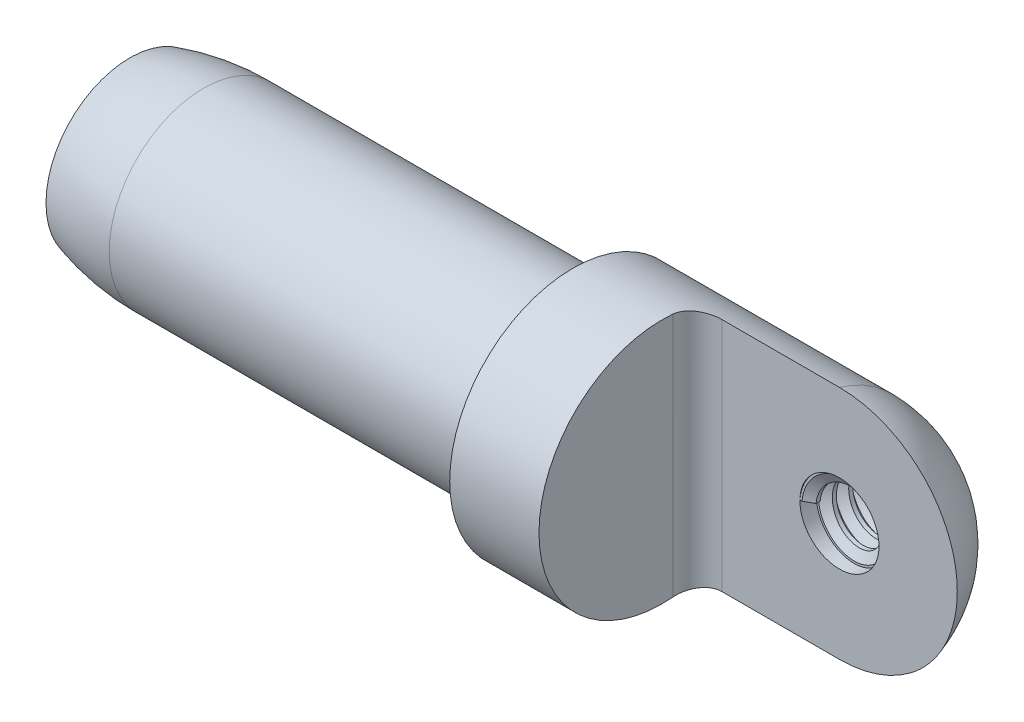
ISO-10303-21;
HEADER;
FILE_DESCRIPTION(('STEP AP214'),'2;1');
FILE_NAME('part.step','',(''),(''),'','','');
FILE_SCHEMA(('AUTOMOTIVE_DESIGN { 1 0 10303 214 1 1 1 1 }'));
ENDSEC;
DATA;
#1=APPLICATION_CONTEXT('core data for automotive mechanical design processes');
#2=APPLICATION_PROTOCOL_DEFINITION('international standard','automotive_design',2000,#1);
#3=PRODUCT_CONTEXT('',#1,'mechanical');
#4=PRODUCT('Part','Part','',(#3));
#5=PRODUCT_RELATED_PRODUCT_CATEGORY('part','',(#4));
#6=PRODUCT_DEFINITION_FORMATION('','',#4);
#7=PRODUCT_DEFINITION_CONTEXT('part definition',#1,'design');
#8=PRODUCT_DEFINITION('design','',#6,#7);
#9=PRODUCT_DEFINITION_SHAPE('','',#8);
#10=(LENGTH_UNIT() NAMED_UNIT(*) SI_UNIT(.MILLI.,.METRE.));
#11=(NAMED_UNIT(*) PLANE_ANGLE_UNIT() SI_UNIT($,.RADIAN.));
#12=(NAMED_UNIT(*) SI_UNIT($,.STERADIAN.) SOLID_ANGLE_UNIT());
#13=UNCERTAINTY_MEASURE_WITH_UNIT(LENGTH_MEASURE(1.E-05),#10,'distance_accuracy_value','');
#14=(GEOMETRIC_REPRESENTATION_CONTEXT(3) GLOBAL_UNCERTAINTY_ASSIGNED_CONTEXT((#13)) GLOBAL_UNIT_ASSIGNED_CONTEXT((#10,
#11,#12)) REPRESENTATION_CONTEXT('',''));
#15=CARTESIAN_POINT('',(0.,0.,0.));
#16=DIRECTION('',(0.,0.,1.));
#17=DIRECTION('',(1.,0.,0.));
#18=AXIS2_PLACEMENT_3D('',#15,#16,#17);
#19=CARTESIAN_POINT('',(-57.15,0.,0.));
#20=DIRECTION('',(-1.,0.,0.));
#21=DIRECTION('',(0.,0.,1.));
#22=AXIS2_PLACEMENT_3D('',#19,#20,#21);
#23=CYLINDRICAL_SURFACE('',#22,7.9375);
#24=CARTESIAN_POINT('',(-28.575,0.,0.));
#25=DIRECTION('',(-1.,0.,0.));
#26=DIRECTION('',(0.,0.,1.));
#27=AXIS2_PLACEMENT_3D('',#24,#25,#26);
#28=CIRCLE('',#27,7.93750000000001);
#29=CARTESIAN_POINT('',(-28.575,0.,7.93750000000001));
#30=VERTEX_POINT('',#29);
#31=EDGE_CURVE('P0_E98',#30,#30,#28,.T.);
#32=ORIENTED_EDGE('',*,*,#31,.F.);
#33=EDGE_LOOP('',(#32));
#34=FACE_BOUND('',#33,.T.);
#35=CARTESIAN_POINT('',(-21.2287612,-7.60119137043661,-2.286));
#36=CARTESIAN_POINT('',(-21.2723240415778,-7.60118888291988,-2.28600076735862));
#37=CARTESIAN_POINT('',(-21.3158651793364,-7.60173122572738,-2.28420571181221));
#38=CARTESIAN_POINT('',(-21.4026192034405,-7.60387818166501,-2.27705152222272));
#39=CARTESIAN_POINT('',(-21.4458321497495,-7.6054825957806,-2.27169305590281));
#40=CARTESIAN_POINT('',(-21.5743013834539,-7.6118346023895,-2.25035848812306));
#41=CARTESIAN_POINT('',(-21.6586704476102,-7.6181213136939,-2.22912280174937));
#42=CARTESIAN_POINT('',(-21.8224517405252,-7.63421803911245,-2.17335028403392));
#43=CARTESIAN_POINT('',(-21.9018648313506,-7.64402743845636,-2.13881577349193));
#44=CARTESIAN_POINT('',(-22.0537814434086,-7.66631016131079,-2.0575144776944));
#45=CARTESIAN_POINT('',(-22.1262825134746,-7.67878442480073,-2.01074337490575));
#46=CARTESIAN_POINT('',(-22.2642522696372,-7.70570588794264,-1.905004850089));
#47=CARTESIAN_POINT('',(-22.3295057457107,-7.72019385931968,-1.84576725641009));
#48=CARTESIAN_POINT('',(-22.4492959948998,-7.7497593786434,-1.71740153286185));
#49=CARTESIAN_POINT('',(-22.503829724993,-7.7648370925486,-1.64827060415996));
#50=CARTESIAN_POINT('',(-22.6021942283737,-7.79490581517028,-1.4997493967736));
#51=CARTESIAN_POINT('',(-22.6456683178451,-7.80988159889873,-1.42011953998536));
#52=CARTESIAN_POINT('',(-22.7184940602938,-7.83820273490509,-1.25440504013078));
#53=CARTESIAN_POINT('',(-22.7478555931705,-7.85154922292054,-1.16832496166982));
#54=CARTESIAN_POINT('',(-22.7850993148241,-7.87219899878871,-1.01800664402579));
#55=CARTESIAN_POINT('',(-22.7967551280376,-7.88012681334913,-0.954764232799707));
#56=CARTESIAN_POINT('',(-22.8123405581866,-7.89454169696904,-0.827217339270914));
#57=CARTESIAN_POINT('',(-22.8162752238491,-7.90102970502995,-0.762913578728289));
#58=CARTESIAN_POINT('',(-22.8162612,-7.90670626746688,-0.698499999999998));
#59=B_SPLINE_CURVE_WITH_KNOTS('',3,(#35,#36,#37,#38,#39,#40,#41,#42,#43,#44,#45,#46,#47,#48,#49,
#50,#51,#52,#53,#54,#55,#56,#57,#58),.UNSPECIFIED.,.F.,.F.,(4,2,2,2,2,2,2,2,2,2,2,4),(0.,
0.130605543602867,0.261186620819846,0.521512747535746,0.781793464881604,1.04216614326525,
1.30890313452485,1.5757157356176,1.85027427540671,2.12464032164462,2.31856344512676,
2.51235972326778),.UNSPECIFIED.);
#60=CARTESIAN_POINT('',(-21.2287612,-7.60119137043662,-2.286));
#61=VERTEX_POINT('',#60);
#62=CARTESIAN_POINT('',(-22.8162612,-7.90670626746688,-0.698499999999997));
#63=VERTEX_POINT('',#62);
#64=EDGE_CURVE('P0_E29',#61,#63,#59,.T.);
#65=ORIENTED_EDGE('',*,*,#64,.T.);
#66=CARTESIAN_POINT('',(-22.8162612,0.,0.));
#67=DIRECTION('',(-1.,0.,0.));
#68=DIRECTION('',(0.,0.,1.));
#69=AXIS2_PLACEMENT_3D('',#66,#67,#68);
#70=CIRCLE('',#69,7.9375);
#71=CARTESIAN_POINT('',(-22.8162612,7.90670626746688,-0.698499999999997));
#72=VERTEX_POINT('',#71);
#73=EDGE_CURVE('P0_E120',#63,#72,#70,.T.);
#74=ORIENTED_EDGE('',*,*,#73,.T.);
#75=CARTESIAN_POINT('',(-22.8162612,7.90670626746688,-0.698499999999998));
#76=CARTESIAN_POINT('',(-22.8162613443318,7.90274986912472,-0.743309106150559));
#77=CARTESIAN_POINT('',(-22.8143629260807,7.89840985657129,-0.788060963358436));
#78=CARTESIAN_POINT('',(-22.8068094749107,7.88901098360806,-0.877162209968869));
#79=CARTESIAN_POINT('',(-22.8011551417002,7.8839522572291,-0.921511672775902));
#80=CARTESIAN_POINT('',(-22.7786570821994,7.86779622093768,-1.05332043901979));
#81=CARTESIAN_POINT('',(-22.7562778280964,7.85569793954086,-1.1397764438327));
#82=CARTESIAN_POINT('',(-22.6975333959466,7.82954781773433,-1.30740367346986));
#83=CARTESIAN_POINT('',(-22.6611705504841,7.8154963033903,-1.38857577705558));
#84=CARTESIAN_POINT('',(-22.5755248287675,7.7863580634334,-1.54361885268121));
#85=CARTESIAN_POINT('',(-22.5262386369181,7.7712710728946,-1.61748794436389));
#86=CARTESIAN_POINT('',(-22.4150912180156,7.74088462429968,-1.75721981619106));
#87=CARTESIAN_POINT('',(-22.3530248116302,7.72558607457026,-1.82291965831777));
#88=CARTESIAN_POINT('',(-22.2184708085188,7.69626643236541,-1.94299195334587));
#89=CARTESIAN_POINT('',(-22.145981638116,7.68224553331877,-1.99736269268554));
#90=CARTESIAN_POINT('',(-21.9925159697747,7.65670576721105,-2.09313825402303));
#91=CARTESIAN_POINT('',(-21.9115418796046,7.64518619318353,-2.13454674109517));
#92=CARTESIAN_POINT('',(-21.7433726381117,7.62574114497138,-2.20301054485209));
#93=CARTESIAN_POINT('',(-21.6561840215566,7.61781195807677,-2.23008069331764));
#94=CARTESIAN_POINT('',(-21.5117397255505,7.60849396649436,-2.26161085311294));
#95=CARTESIAN_POINT('',(-21.4555480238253,7.60576709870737,-2.27074472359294));
#96=CARTESIAN_POINT('',(-21.3425017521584,7.60211143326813,-2.28294121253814));
#97=CARTESIAN_POINT('',(-21.2856477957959,7.60118108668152,-2.28600906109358));
#98=CARTESIAN_POINT('',(-21.2287612,7.60119137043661,-2.286));
#99=B_SPLINE_CURVE_WITH_KNOTS('',3,(#75,#76,#77,#78,#79,#80,#81,#82,#83,#84,#85,#86,#87,#88,#89,
#90,#91,#92,#93,#94,#95,#96,#97,#98),.UNSPECIFIED.,.F.,.F.,(4,2,2,2,2,2,2,2,2,2,2,4),(0.,
0.134863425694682,0.269701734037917,0.53867581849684,0.807605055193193,1.0766033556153,
1.35031433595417,1.62406668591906,1.89774156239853,2.17113279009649,2.34178737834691,
2.5122947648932),.UNSPECIFIED.);
#100=CARTESIAN_POINT('',(-21.2287612,7.6011913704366,-2.286));
#101=VERTEX_POINT('',#100);
#102=EDGE_CURVE('P0_E113',#72,#101,#99,.T.);
#103=ORIENTED_EDGE('',*,*,#102,.T.);
#104=DIRECTION('',(-1.,0.,0.));
#105=VECTOR('',#104,1.);
#106=CARTESIAN_POINT('',(-57.15,7.60119137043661,-2.28599999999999));
#107=LINE('',#106,#105);
#108=CARTESIAN_POINT('',(-13.6525,7.60119137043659,-2.286));
#109=VERTEX_POINT('',#108);
#110=EDGE_CURVE('P0_E76',#101,#109,#107,.F.);
#111=ORIENTED_EDGE('',*,*,#110,.T.);
#112=CARTESIAN_POINT('',(-13.6525,0.,0.));
#113=DIRECTION('',(-1.,0.,0.));
#114=DIRECTION('',(0.,0.,1.));
#115=AXIS2_PLACEMENT_3D('',#112,#113,#114);
#116=CIRCLE('',#115,7.93749999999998);
#117=CARTESIAN_POINT('',(-13.6525,2.55269999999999,-7.51582523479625));
#118=VERTEX_POINT('',#117);
#119=EDGE_CURVE('P0_E67',#109,#118,#116,.T.);
#120=ORIENTED_EDGE('',*,*,#119,.T.);
#121=CARTESIAN_POINT('',(-13.6525,2.55269999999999,-7.51582523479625));
#122=CARTESIAN_POINT('',(-13.7222960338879,2.55270902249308,-7.5158146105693));
#123=CARTESIAN_POINT('',(-13.7920860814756,2.54983763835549,-7.51679723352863));
#124=CARTESIAN_POINT('',(-13.9311280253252,2.53840431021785,-7.5206699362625));
#125=CARTESIAN_POINT('',(-14.0003800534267,2.52984380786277,-7.52355953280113));
#126=CARTESIAN_POINT('',(-14.1376632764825,2.50713425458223,-7.53115657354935));
#127=CARTESIAN_POINT('',(-14.2056973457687,2.49300091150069,-7.53585890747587));
#128=CARTESIAN_POINT('',(-14.340246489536,2.45928821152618,-7.54692788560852));
#129=CARTESIAN_POINT('',(-14.4067615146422,2.43970867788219,-7.55329458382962));
#130=CARTESIAN_POINT('',(-14.6032774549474,2.37305373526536,-7.57461051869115));
#131=CARTESIAN_POINT('',(-14.730442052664,2.31802971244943,-7.59178708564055));
#132=CARTESIAN_POINT('',(-14.9737471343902,2.18852112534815,-7.63012555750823));
#133=CARTESIAN_POINT('',(-15.0898813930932,2.11402565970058,-7.65128969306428));
#134=CARTESIAN_POINT('',(-15.3120759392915,1.94478991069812,-7.69607646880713));
#135=CARTESIAN_POINT('',(-15.4176805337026,1.8494654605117,-7.71975699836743));
#136=CARTESIAN_POINT('',(-15.6117119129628,1.64252681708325,-7.76641796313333));
#137=CARTESIAN_POINT('',(-15.7001356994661,1.53090978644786,-7.78939827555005));
#138=CARTESIAN_POINT('',(-15.859349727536,1.29123020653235,-7.83273852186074));
#139=CARTESIAN_POINT('',(-15.9296635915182,1.1628361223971,-7.85302194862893));
#140=CARTESIAN_POINT('',(-16.0475142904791,0.895285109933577,-7.88799968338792));
#141=CARTESIAN_POINT('',(-16.0950576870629,0.756131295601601,-7.90269560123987));
#142=CARTESIAN_POINT('',(-16.1644798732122,0.475814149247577,-7.92443165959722));
#143=CARTESIAN_POINT('',(-16.1871437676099,0.334863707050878,-7.93170545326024));
#144=CARTESIAN_POINT('',(-16.2086549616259,0.0509827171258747,-7.93860480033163));
#145=CARTESIAN_POINT('',(-16.2075075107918,-0.091947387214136,-7.93823203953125));
#146=CARTESIAN_POINT('',(-16.1819362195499,-0.370186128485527,-7.93004079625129));
#147=CARTESIAN_POINT('',(-16.1583645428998,-0.505582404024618,-7.92249491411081));
#148=CARTESIAN_POINT('',(-16.0900172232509,-0.770382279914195,-7.90114370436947));
#149=CARTESIAN_POINT('',(-16.0452404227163,-0.899785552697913,-7.88733803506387));
#150=CARTESIAN_POINT('',(-15.935227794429,-1.15085074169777,-7.85466052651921));
#151=CARTESIAN_POINT('',(-15.8697401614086,-1.27239392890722,-7.83572676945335));
#152=CARTESIAN_POINT('',(-15.7203692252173,-1.50302436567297,-7.79477796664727));
#153=CARTESIAN_POINT('',(-15.6364812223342,-1.61210842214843,-7.77276213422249));
#154=CARTESIAN_POINT('',(-15.4483604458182,-1.8197922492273,-7.72684123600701));
#155=CARTESIAN_POINT('',(-15.3433959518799,-1.91772113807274,-7.7028956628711));
#156=CARTESIAN_POINT('',(-15.1182934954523,-2.09481183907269,-7.65663571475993));
#157=CARTESIAN_POINT('',(-14.998150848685,-2.17396783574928,-7.63432184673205));
#158=CARTESIAN_POINT('',(-14.7440846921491,-2.31212129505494,-7.59363371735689));
#159=CARTESIAN_POINT('',(-14.6100027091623,-2.37084409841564,-7.57531428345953));
#160=CARTESIAN_POINT('',(-14.3331895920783,-2.46459128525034,-7.54534011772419));
#161=CARTESIAN_POINT('',(-14.1904723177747,-2.49965260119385,-7.53367500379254));
#162=CARTESIAN_POINT('',(-13.9807346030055,-2.53236915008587,-7.52270597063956));
#163=CARTESIAN_POINT('',(-13.9153032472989,-2.53999094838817,-7.52013238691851));
#164=CARTESIAN_POINT('',(-13.7840927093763,-2.55015256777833,-7.5166912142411));
#165=CARTESIAN_POINT('',(-13.7183141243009,-2.55269931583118,-7.5158212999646));
#166=CARTESIAN_POINT('',(-13.6525,-2.55269999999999,-7.51582523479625));
#167=B_SPLINE_CURVE_WITH_KNOTS('',3,(#121,#122,#123,#124,#125,#126,#127,#128,#129,#130,#131,
#132,#133,#134,#135,#136,#137,#138,#139,#140,#141,#142,#143,#144,#145,#146,#147,#148,#149,#150,
#151,#152,#153,#154,#155,#156,#157,#158,#159,#160,#161,#162,#163,#164,#165,#166),.UNSPECIFIED.,
.F.,.F.,(4,2,2,2,2,2,2,2,2,2,2,2,2,2,2,2,2,2,2,2,2,2,4),(0.,0.209312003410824,0.418570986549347,
0.627244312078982,0.835924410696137,1.25270448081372,1.6697183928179,2.10041801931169,
2.53119274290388,2.9723501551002,3.41338036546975,3.84005320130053,4.2666319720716,
4.67762150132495,5.08863346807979,5.50484822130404,5.92116940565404,6.35577525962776,
6.79051557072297,7.23089225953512,7.67057997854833,7.86816732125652,8.0654847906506),.UNSPECIFIED.);
#168=CARTESIAN_POINT('',(-13.6525,-2.55269999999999,-7.51582523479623));
#169=VERTEX_POINT('',#168);
#170=EDGE_CURVE('P0_E11',#118,#169,#167,.T.);
#171=ORIENTED_EDGE('',*,*,#170,.T.);
#172=CARTESIAN_POINT('',(-13.6525,-7.60119137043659,-2.286));
#173=VERTEX_POINT('',#172);
#174=EDGE_CURVE('P0_E68',#169,#173,#116,.T.);
#175=ORIENTED_EDGE('',*,*,#174,.T.);
#176=DIRECTION('',(-1.,0.,0.));
#177=VECTOR('',#176,1.);
#178=CARTESIAN_POINT('',(-57.15,-7.60119137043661,-2.28599999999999));
#179=LINE('',#178,#177);
#180=EDGE_CURVE('P0_E87',#173,#61,#179,.T.);
#181=ORIENTED_EDGE('',*,*,#180,.T.);
#182=EDGE_LOOP('',(#65,#74,#103,#111,#120,#171,#175,#181));
#183=FACE_BOUND('',#182,.T.);
#184=ADVANCED_FACE('P0_F16',(#34,#183),#23,.T.);
#185=CARTESIAN_POINT('',(-57.15,0.,0.));
#186=DIRECTION('',(-1.,0.,0.));
#187=DIRECTION('',(0.,0.,1.));
#188=AXIS2_PLACEMENT_3D('',#185,#186,#187);
#189=CYLINDRICAL_SURFACE('',#188,6.096);
#190=CARTESIAN_POINT('',(-52.3875,0.,0.));
#191=DIRECTION('',(-1.,0.,0.));
#192=DIRECTION('',(0.,0.,1.));
#193=AXIS2_PLACEMENT_3D('',#190,#191,#192);
#194=CIRCLE('',#193,6.096);
#195=CARTESIAN_POINT('',(-52.3875,0.,6.096));
#196=VERTEX_POINT('',#195);
#197=EDGE_CURVE('P0_E106',#196,#196,#194,.T.);
#198=ORIENTED_EDGE('',*,*,#197,.F.);
#199=EDGE_LOOP('',(#198));
#200=FACE_BOUND('',#199,.T.);
#201=CARTESIAN_POINT('',(-28.575,0.,0.));
#202=DIRECTION('',(-1.,0.,0.));
#203=DIRECTION('',(0.,0.,1.));
#204=AXIS2_PLACEMENT_3D('',#201,#202,#203);
#205=CIRCLE('',#204,6.096);
#206=CARTESIAN_POINT('',(-28.575,0.,6.096));
#207=VERTEX_POINT('',#206);
#208=EDGE_CURVE('P0_E102',#207,#207,#205,.T.);
#209=ORIENTED_EDGE('',*,*,#208,.T.);
#210=EDGE_LOOP('',(#209));
#211=FACE_BOUND('',#210,.T.);
#212=ADVANCED_FACE('P0_F166',(#200,#211),#189,.T.);
#213=CARTESIAN_POINT('',(-28.575,0.,-6.096));
#214=DIRECTION('',(-1.,0.,0.));
#215=DIRECTION('',(0.,0.,1.));
#216=AXIS2_PLACEMENT_3D('',#213,#214,#215);
#217=PLANE('',#216);
#218=ORIENTED_EDGE('',*,*,#31,.T.);
#219=EDGE_LOOP('',(#218));
#220=FACE_BOUND('',#219,.T.);
#221=ORIENTED_EDGE('',*,*,#208,.F.);
#222=EDGE_LOOP('',(#221));
#223=FACE_BOUND('',#222,.T.);
#224=ADVANCED_FACE('P0_F170',(#220,#223),#217,.T.);
#225=CARTESIAN_POINT('',(-13.6525,0.,0.));
#226=DIRECTION('',(-1.,0.,0.));
#227=DIRECTION('',(0.,0.,-1.));
#228=AXIS2_PLACEMENT_3D('',#225,#226,#227);
#229=SPHERICAL_SURFACE('',#228,7.93749999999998);
#230=CARTESIAN_POINT('',(-13.6525,0.,-7.51582523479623));
#231=DIRECTION('',(0.,0.,1.));
#232=DIRECTION('',(1.,0.,0.));
#233=AXIS2_PLACEMENT_3D('',#230,#231,#232);
#234=CIRCLE('',#233,2.55269999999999);
#235=EDGE_CURVE('P0_E35',#118,#169,#234,.F.);
#236=ORIENTED_EDGE('',*,*,#235,.F.);
#237=ORIENTED_EDGE('',*,*,#119,.F.);
#238=CARTESIAN_POINT('',(-13.6525,0.,-2.286));
#239=DIRECTION('',(0.,0.,-1.));
#240=DIRECTION('',(-1.,0.,0.));
#241=AXIS2_PLACEMENT_3D('',#238,#239,#240);
#242=CIRCLE('',#241,7.60119137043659);
#243=EDGE_CURVE('P0_E110',#173,#109,#242,.F.);
#244=ORIENTED_EDGE('',*,*,#243,.F.);
#245=ORIENTED_EDGE('',*,*,#174,.F.);
#246=EDGE_LOOP('',(#236,#237,#244,#245));
#247=FACE_BOUND('',#246,.T.);
#248=ADVANCED_FACE('P0_F65',(#247),#229,.T.);
#249=CARTESIAN_POINT('',(-22.8162612,-127.,-0.698499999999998));
#250=DIRECTION('',(-1.,0.,0.));
#251=DIRECTION('',(0.,0.,1.));
#252=AXIS2_PLACEMENT_3D('',#249,#250,#251);
#253=PLANE('',#252);
#254=ORIENTED_EDGE('',*,*,#73,.F.);
#255=DIRECTION('',(0.,1.,0.));
#256=VECTOR('',#255,1.);
#257=CARTESIAN_POINT('',(-22.8162612,-127.,-0.698499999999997));
#258=LINE('',#257,#256);
#259=EDGE_CURVE('P0_E145',#63,#72,#258,.T.);
#260=ORIENTED_EDGE('',*,*,#259,.T.);
#261=EDGE_LOOP('',(#254,#260));
#262=FACE_BOUND('',#261,.T.);
#263=ADVANCED_FACE('P0_F129',(#262),#253,.F.);
#264=CARTESIAN_POINT('',(-21.2287612,-127.,-0.698499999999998));
#265=DIRECTION('',(0.,1.,0.));
#266=DIRECTION('',(0.,0.,1.));
#267=AXIS2_PLACEMENT_3D('',#264,#265,#266);
#268=CYLINDRICAL_SURFACE('',#267,1.5875);
#269=ORIENTED_EDGE('',*,*,#259,.F.);
#270=ORIENTED_EDGE('',*,*,#64,.F.);
#271=DIRECTION('',(0.,1.,0.));
#272=VECTOR('',#271,1.);
#273=CARTESIAN_POINT('',(-21.2287612,-127.,-2.286));
#274=LINE('',#273,#272);
#275=EDGE_CURVE('P0_E70',#61,#101,#274,.T.);
#276=ORIENTED_EDGE('',*,*,#275,.T.);
#277=ORIENTED_EDGE('',*,*,#102,.F.);
#278=EDGE_LOOP('',(#269,#270,#276,#277));
#279=FACE_BOUND('',#278,.T.);
#280=ADVANCED_FACE('P0_F123',(#279),#268,.F.);
#281=CARTESIAN_POINT('',(-6.05130862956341,-127.,-2.286));
#282=DIRECTION('',(0.,0.,-1.));
#283=DIRECTION('',(-1.,0.,0.));
#284=AXIS2_PLACEMENT_3D('',#281,#282,#283);
#285=PLANE('',#284);
#286=CARTESIAN_POINT('',(-13.6525,0.,-2.286));
#287=DIRECTION('',(0.,0.,1.));
#288=DIRECTION('',(1.,0.,0.));
#289=AXIS2_PLACEMENT_3D('',#286,#287,#288);
#290=CIRCLE('',#289,2.55269999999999);
#291=CARTESIAN_POINT('',(-11.0998,0.,-2.286));
#292=VERTEX_POINT('',#291);
#293=EDGE_CURVE('P0_E71',#292,#292,#290,.T.);
#294=ORIENTED_EDGE('',*,*,#293,.F.);
#295=EDGE_LOOP('',(#294));
#296=FACE_BOUND('',#295,.T.);
#297=ORIENTED_EDGE('',*,*,#180,.F.);
#298=ORIENTED_EDGE('',*,*,#243,.T.);
#299=ORIENTED_EDGE('',*,*,#110,.F.);
#300=ORIENTED_EDGE('',*,*,#275,.F.);
#301=EDGE_LOOP('',(#297,#298,#299,#300));
#302=FACE_BOUND('',#301,.T.);
#303=ADVANCED_FACE('P0_F128',(#296,#302),#285,.F.);
#304=CARTESIAN_POINT('',(-13.6525,0.,-2.286));
#305=DIRECTION('',(0.,0.,1.));
#306=DIRECTION('',(1.,0.,0.));
#307=AXIS2_PLACEMENT_3D('',#304,#305,#306);
#308=CYLINDRICAL_SURFACE('',#307,2.55269999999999);
#309=ORIENTED_EDGE('',*,*,#235,.T.);
#310=ORIENTED_EDGE('',*,*,#170,.F.);
#311=EDGE_LOOP('',(#309,#310));
#312=FACE_BOUND('',#311,.T.);
#313=ORIENTED_EDGE('',*,*,#293,.T.);
#314=EDGE_LOOP('',(#313));
#315=FACE_BOUND('',#314,.T.);
#316=ADVANCED_FACE('P0_F58',(#312,#315),#308,.F.);
#317=CARTESIAN_POINT('',(-25.8125099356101,0.,0.));
#318=DIRECTION('',(-1.,0.,0.));
#319=DIRECTION('',(0.,-1.,0.));
#320=AXIS2_PLACEMENT_3D('',#317,#318,#319);
#321=CONICAL_SURFACE('',#320,0.,1.17809724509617);
#322=CARTESIAN_POINT('',(-27.559,0.,0.));
#323=DIRECTION('',(1.,0.,0.));
#324=DIRECTION('',(0.,1.,0.));
#325=AXIS2_PLACEMENT_3D('',#322,#323,#324);
#326=CIRCLE('',#325,4.2164);
#327=CARTESIAN_POINT('',(-27.559,4.2164,0.));
#328=VERTEX_POINT('',#327);
#329=EDGE_CURVE('P0_E84',#328,#328,#326,.T.);
#330=ORIENTED_EDGE('',*,*,#329,.F.);
#331=EDGE_LOOP('',(#330));
#332=FACE_BOUND('',#331,.T.);
#333=CARTESIAN_POINT('',(-25.8125099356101,0.,0.));
#334=VERTEX_POINT('',#333);
#335=VERTEX_LOOP('',#334);
#336=FACE_BOUND('',#335,.T.);
#337=ADVANCED_FACE('P0_F164',(#332,#336),#321,.F.);
#338=CARTESIAN_POINT('',(-25.8125099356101,0.,0.));
#339=DIRECTION('',(1.,0.,0.));
#340=DIRECTION('',(0.,1.,0.));
#341=AXIS2_PLACEMENT_3D('',#338,#339,#340);
#342=CYLINDRICAL_SURFACE('',#341,4.2164);
#343=CARTESIAN_POINT('',(-57.15,0.,0.));
#344=DIRECTION('',(1.,0.,0.));
#345=DIRECTION('',(0.,1.,0.));
#346=AXIS2_PLACEMENT_3D('',#343,#344,#345);
#347=CIRCLE('',#346,4.2164);
#348=CARTESIAN_POINT('',(-57.15,4.2164,0.));
#349=VERTEX_POINT('',#348);
#350=EDGE_CURVE('P0_E78',#349,#349,#347,.T.);
#351=ORIENTED_EDGE('',*,*,#350,.F.);
#352=EDGE_LOOP('',(#351));
#353=FACE_BOUND('',#352,.T.);
#354=ORIENTED_EDGE('',*,*,#329,.T.);
#355=EDGE_LOOP('',(#354));
#356=FACE_BOUND('',#355,.T.);
#357=ADVANCED_FACE('P0_F189',(#353,#356),#342,.F.);
#358=CARTESIAN_POINT('',(-57.15,7.9375,0.));
#359=DIRECTION('',(1.,0.,0.));
#360=DIRECTION('',(0.,0.,-1.));
#361=AXIS2_PLACEMENT_3D('',#358,#359,#360);
#362=PLANE('',#361);
#363=ORIENTED_EDGE('',*,*,#350,.T.);
#364=EDGE_LOOP('',(#363));
#365=FACE_BOUND('',#364,.T.);
#366=CARTESIAN_POINT('',(-57.15,0.,0.));
#367=DIRECTION('',(-1.,0.,0.));
#368=DIRECTION('',(0.,0.,1.));
#369=AXIS2_PLACEMENT_3D('',#366,#367,#368);
#370=CIRCLE('',#369,5.41069266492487);
#371=CARTESIAN_POINT('',(-57.15,0.,5.41069266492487));
#372=VERTEX_POINT('',#371);
#373=EDGE_CURVE('P0_E94',#372,#372,#370,.T.);
#374=ORIENTED_EDGE('',*,*,#373,.T.);
#375=EDGE_LOOP('',(#374));
#376=FACE_BOUND('',#375,.T.);
#377=ADVANCED_FACE('P0_F18',(#365,#376),#362,.F.);
#378=CARTESIAN_POINT('',(-52.3875,0.,0.));
#379=DIRECTION('',(-1.,0.,0.));
#380=DIRECTION('',(0.,0.,1.));
#381=AXIS2_PLACEMENT_3D('',#378,#379,#380);
#382=DEGENERATE_TOROIDAL_SURFACE('',#381,10.795,16.891,.F.);
#383=ORIENTED_EDGE('',*,*,#197,.T.);
#384=EDGE_LOOP('',(#383));
#385=FACE_BOUND('',#384,.T.);
#386=ORIENTED_EDGE('',*,*,#373,.F.);
#387=EDGE_LOOP('',(#386));
#388=FACE_BOUND('',#387,.T.);
#389=ADVANCED_FACE('P0_F184',(#385,#388),#382,.F.);
#390=CLOSED_SHELL('',(#184,#212,#224,#248,#263,#280,#303,#316,#337,#357,#377,#389));
#391=MANIFOLD_SOLID_BREP('P0_B1',#390);
#392=CARTESIAN_POINT('',(-11.9516526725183,-0.702359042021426,-6.51661855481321));
#393=DIRECTION('',(-0.38168362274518,-0.924293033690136,0.));
#394=DIRECTION('',(0.924293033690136,-0.38168362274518,0.));
#395=AXIS2_PLACEMENT_3D('',#392,#393,#394);
#396=PLANE('',#395);
#397=DIRECTION('',(0.,0.,-1.));
#398=VECTOR('',#397,1.);
#399=CARTESIAN_POINT('',(-11.9516526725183,-0.702359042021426,-6.51661855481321));
#400=LINE('',#399,#398);
#401=CARTESIAN_POINT('',(-11.9516526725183,-0.702359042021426,-6.38432688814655));
#402=VERTEX_POINT('',#401);
#403=CARTESIAN_POINT('',(-11.9516526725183,-0.702359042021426,-6.64891022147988));
#404=VERTEX_POINT('',#403);
#405=EDGE_CURVE('P1_E26',#402,#404,#400,.T.);
#406=ORIENTED_EDGE('',*,*,#405,.T.);
#407=DIRECTION('',(0.800461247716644,-0.330547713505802,-0.5));
#408=VECTOR('',#407,1.);
#409=CARTESIAN_POINT('',(-11.686916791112,-0.811680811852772,-6.81427480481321));
#410=LINE('',#409,#408);
#411=CARTESIAN_POINT('',(-11.4221809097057,-0.921002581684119,-6.97963938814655));
#412=VERTEX_POINT('',#411);
#413=EDGE_CURVE('P1_E20',#404,#412,#410,.T.);
#414=ORIENTED_EDGE('',*,*,#413,.T.);
#415=DIRECTION('',(0.924293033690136,-0.38168362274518,0.));
#416=VECTOR('',#415,1.);
#417=CARTESIAN_POINT('',(-11.3348849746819,-0.957051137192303,-6.97963938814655));
#418=LINE('',#417,#416);
#419=CARTESIAN_POINT('',(-11.2475890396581,-0.993099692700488,-6.97963938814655));
#420=VERTEX_POINT('',#419);
#421=EDGE_CURVE('P1_E84',#412,#420,#418,.T.);
#422=ORIENTED_EDGE('',*,*,#421,.T.);
#423=DIRECTION('',(0.800461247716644,-0.330547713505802,0.500000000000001));
#424=VECTOR('',#423,1.);
#425=CARTESIAN_POINT('',(-10.9299059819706,-1.1242858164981,-6.78120188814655));
#426=LINE('',#425,#424);
#427=CARTESIAN_POINT('',(-10.612222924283,-1.25547194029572,-6.58276438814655));
#428=VERTEX_POINT('',#427);
#429=EDGE_CURVE('P1_E114',#420,#428,#426,.T.);
#430=ORIENTED_EDGE('',*,*,#429,.T.);
#431=DIRECTION('',(0.,0.,1.));
#432=VECTOR('',#431,1.);
#433=CARTESIAN_POINT('',(-10.612222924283,-1.25547194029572,-6.51661855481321));
#434=LINE('',#433,#432);
#435=CARTESIAN_POINT('',(-10.612222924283,-1.25547194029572,-6.45047272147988));
#436=VERTEX_POINT('',#435);
#437=EDGE_CURVE('P1_E118',#428,#436,#434,.T.);
#438=ORIENTED_EDGE('',*,*,#437,.T.);
#439=DIRECTION('',(-0.800461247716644,0.330547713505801,0.500000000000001));
#440=VECTOR('',#439,1.);
#441=CARTESIAN_POINT('',(-10.9299059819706,-1.1242858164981,-6.25203522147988));
#442=LINE('',#441,#440);
#443=CARTESIAN_POINT('',(-11.2475890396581,-0.993099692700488,-6.05359772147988));
#444=VERTEX_POINT('',#443);
#445=EDGE_CURVE('P1_E123',#436,#444,#442,.T.);
#446=ORIENTED_EDGE('',*,*,#445,.T.);
#447=DIRECTION('',(-0.924293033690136,0.38168362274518,0.));
#448=VECTOR('',#447,1.);
#449=CARTESIAN_POINT('',(-11.3348849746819,-0.957051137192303,-6.05359772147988));
#450=LINE('',#449,#448);
#451=CARTESIAN_POINT('',(-11.4221809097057,-0.921002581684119,-6.05359772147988));
#452=VERTEX_POINT('',#451);
#453=EDGE_CURVE('P1_E128',#444,#452,#450,.T.);
#454=ORIENTED_EDGE('',*,*,#453,.T.);
#455=DIRECTION('',(-0.800461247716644,0.330547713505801,-0.500000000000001));
#456=VECTOR('',#455,1.);
#457=CARTESIAN_POINT('',(-11.686916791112,-0.811680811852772,-6.21896230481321));
#458=LINE('',#457,#456);
#459=EDGE_CURVE('P1_E41',#452,#402,#458,.T.);
#460=ORIENTED_EDGE('',*,*,#459,.T.);
#461=EDGE_LOOP('',(#406,#414,#422,#430,#438,#446,#454,#460));
#462=FACE_BOUND('',#461,.T.);
#463=ADVANCED_FACE('P1_F15',(#462),#396,.T.);
#464=CARTESIAN_POINT('',(-15.492463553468,0.0269068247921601,-2.8151662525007));
#465=DIRECTION('',(0.0146220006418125,0.999893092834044,0.));
#466=DIRECTION('',(-0.999893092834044,0.0146220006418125,0.));
#467=AXIS2_PLACEMENT_3D('',#464,#465,#466);
#468=PLANE('',#467);
#469=CARTESIAN_POINT('',(-15.492463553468,0.0269068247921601,-2.6167287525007));
#470=CARTESIAN_POINT('',(-15.492463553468,0.0269068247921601,-2.88131208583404));
#471=(BOUNDED_CURVE() B_SPLINE_CURVE(1,(#469,#470),.UNSPECIFIED.,.F.,
.F.) B_SPLINE_CURVE_WITH_KNOTS((2,2),(0.,1.),
.UNSPECIFIED.) CURVE() GEOMETRIC_REPRESENTATION_ITEM() RATIONAL_B_SPLINE_CURVE((0.961999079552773,0.961999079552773)) REPRESENTATION_ITEM(''));
#472=CARTESIAN_POINT('',(-15.492463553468,0.0269068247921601,-2.88131208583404));
#473=VERTEX_POINT('',#472);
#474=CARTESIAN_POINT('',(-15.4924635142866,0.0269095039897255,-2.61672900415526));
#475=VERTEX_POINT('',#474);
#476=EDGE_CURVE('P1_E10',#473,#475,#471,.F.);
#477=ORIENTED_EDGE('',*,*,#476,.T.);
#478=CARTESIAN_POINT('',(-16.0652419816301,0.0352864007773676,-2.28599983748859));
#479=CARTESIAN_POINT('',(-15.4924635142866,0.0269095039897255,-2.61672900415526));
#480=(BOUNDED_CURVE() B_SPLINE_CURVE(1,(#478,#479),.UNSPECIFIED.,.F.,
.F.) B_SPLINE_CURVE_WITH_KNOTS((2,2),(0.,1.),
.UNSPECIFIED.) CURVE() GEOMETRIC_REPRESENTATION_ITEM() RATIONAL_B_SPLINE_CURVE((0.961999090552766,0.961999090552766)) REPRESENTATION_ITEM(''));
#481=CARTESIAN_POINT('',(-16.0652419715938,0.0352870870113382,-2.28599988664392));
#482=VERTEX_POINT('',#481);
#483=EDGE_CURVE('P1_E138',#475,#482,#480,.F.);
#484=ORIENTED_EDGE('',*,*,#483,.T.);
#485=CARTESIAN_POINT('',(-16.254114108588,0.0380493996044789,-2.28599988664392));
#486=CARTESIAN_POINT('',(-16.0652419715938,0.0352870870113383,-2.28599988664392));
#487=(BOUNDED_CURVE() B_SPLINE_CURVE(1,(#485,#486),.UNSPECIFIED.,.F.,
.F.) B_SPLINE_CURVE_WITH_KNOTS((2,2),(0.,1.),
.UNSPECIFIED.) CURVE() GEOMETRIC_REPRESENTATION_ITEM() RATIONAL_B_SPLINE_CURVE((0.961999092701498,0.961999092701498)) REPRESENTATION_ITEM(''));
#488=CARTESIAN_POINT('',(-16.2541140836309,0.0380511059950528,-2.286));
#489=VERTEX_POINT('',#488);
#490=EDGE_CURVE('P1_E135',#482,#489,#487,.F.);
#491=ORIENTED_EDGE('',*,*,#490,.T.);
#492=CARTESIAN_POINT('',(-16.9414482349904,0.0481040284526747,-2.682875));
#493=CARTESIAN_POINT('',(-16.2541140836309,0.0380511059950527,-2.286));
#494=(BOUNDED_CURVE() B_SPLINE_CURVE(1,(#492,#493),.UNSPECIFIED.,.F.,
.F.) B_SPLINE_CURVE_WITH_KNOTS((2,2),(0.,1.),
.UNSPECIFIED.) CURVE() GEOMETRIC_REPRESENTATION_ITEM() RATIONAL_B_SPLINE_CURVE((0.961999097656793,0.961999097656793)) REPRESENTATION_ITEM(''));
#495=CARTESIAN_POINT('',(-16.9414482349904,0.0481040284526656,-2.682875));
#496=VERTEX_POINT('',#495);
#497=EDGE_CURVE('P1_E132',#489,#496,#494,.F.);
#498=ORIENTED_EDGE('',*,*,#497,.T.);
#499=CARTESIAN_POINT('',(-16.9414482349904,0.0481040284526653,-2.81516666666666));
#500=CARTESIAN_POINT('',(-16.9414482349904,0.0481040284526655,-2.682875));
#501=(BOUNDED_CURVE() B_SPLINE_CURVE(1,(#499,#500),.UNSPECIFIED.,.F.,
.F.) B_SPLINE_CURVE_WITH_KNOTS((2,2),(0.,1.),
.UNSPECIFIED.) CURVE() GEOMETRIC_REPRESENTATION_ITEM() RATIONAL_B_SPLINE_CURVE((0.961999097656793,0.961999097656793)) REPRESENTATION_ITEM(''));
#502=CARTESIAN_POINT('',(-16.941448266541,0.0481018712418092,-2.81516655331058));
#503=VERTEX_POINT('',#502);
#504=EDGE_CURVE('P1_E127',#496,#503,#501,.F.);
#505=ORIENTED_EDGE('',*,*,#504,.T.);
#506=CARTESIAN_POINT('',(-16.254114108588,0.0380493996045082,-3.21204155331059));
#507=CARTESIAN_POINT('',(-16.941448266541,0.048101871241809,-2.81516655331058));
#508=(BOUNDED_CURVE() B_SPLINE_CURVE(1,(#506,#507),.UNSPECIFIED.,.F.,
.F.) B_SPLINE_CURVE_WITH_KNOTS((2,2),(0.,1.),
.UNSPECIFIED.) CURVE() GEOMETRIC_REPRESENTATION_ITEM() RATIONAL_B_SPLINE_CURVE((0.961999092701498,0.961999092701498)) REPRESENTATION_ITEM(''));
#509=CARTESIAN_POINT('',(-16.2541141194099,0.0380486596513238,-3.21204150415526));
#510=VERTEX_POINT('',#509);
#511=EDGE_CURVE('P1_E122',#503,#510,#508,.F.);
#512=ORIENTED_EDGE('',*,*,#511,.T.);
#513=CARTESIAN_POINT('',(-16.0652419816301,0.0352864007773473,-3.21204150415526));
#514=CARTESIAN_POINT('',(-16.2541141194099,0.038048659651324,-3.21204150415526));
#515=(BOUNDED_CURVE() B_SPLINE_CURVE(1,(#513,#514),.UNSPECIFIED.,.F.,
.F.) B_SPLINE_CURVE_WITH_KNOTS((2,2),(0.,1.),
.UNSPECIFIED.) CURVE() GEOMETRIC_REPRESENTATION_ITEM() RATIONAL_B_SPLINE_CURVE((0.961999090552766,0.961999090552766)) REPRESENTATION_ITEM(''));
#516=CARTESIAN_POINT('',(-16.0652420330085,0.0352828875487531,-3.2120412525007));
#517=VERTEX_POINT('',#516);
#518=EDGE_CURVE('P1_E109',#510,#517,#515,.F.);
#519=ORIENTED_EDGE('',*,*,#518,.T.);
#520=CARTESIAN_POINT('',(-15.492463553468,0.0269068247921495,-2.88131208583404));
#521=CARTESIAN_POINT('',(-16.0652420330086,0.0352828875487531,-3.2120412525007));
#522=(BOUNDED_CURVE() B_SPLINE_CURVE(1,(#520,#521),.UNSPECIFIED.,.F.,
.F.) B_SPLINE_CURVE_WITH_KNOTS((2,2),(0.,1.),
.UNSPECIFIED.) CURVE() GEOMETRIC_REPRESENTATION_ITEM() RATIONAL_B_SPLINE_CURVE((0.961999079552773,0.961999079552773)) REPRESENTATION_ITEM(''));
#523=EDGE_CURVE('P1_E90',#517,#473,#522,.F.);
#524=ORIENTED_EDGE('',*,*,#523,.T.);
#525=EDGE_LOOP('',(#477,#484,#491,#498,#505,#512,#519,#524));
#526=FACE_BOUND('',#525,.T.);
#527=ADVANCED_FACE('P1_F17',(#526),#468,.F.);
#528=CARTESIAN_POINT('',(-11.9516526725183,-0.702359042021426,-6.38432688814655));
#529=CARTESIAN_POINT('',(-11.6607260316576,0.00215498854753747,-6.31818105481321));
#530=CARTESIAN_POINT('',(-11.9531764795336,0.706037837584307,-6.25203522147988));
#531=CARTESIAN_POINT('',(-12.2456269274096,1.40992068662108,-6.18588938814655));
#532=CARTESIAN_POINT('',(-12.9501409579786,1.70084732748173,-6.11974355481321));
#533=CARTESIAN_POINT('',(-13.6546549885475,1.99177396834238,-6.05359772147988));
#534=CARTESIAN_POINT('',(-14.3585378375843,1.69932352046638,-5.98745188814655));
#535=CARTESIAN_POINT('',(-15.0624206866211,1.40687307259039,-5.92130605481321));
#536=CARTESIAN_POINT('',(-15.3533473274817,0.702359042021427,-5.85516022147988));
#537=CARTESIAN_POINT('',(-15.6442739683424,-0.00215498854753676,-5.78901438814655));
#538=CARTESIAN_POINT('',(-15.3518235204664,-0.706037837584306,-5.72286855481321));
#539=CARTESIAN_POINT('',(-15.0593730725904,-1.40992068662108,-5.65672272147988));
#540=CARTESIAN_POINT('',(-14.3548590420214,-1.70084732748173,-5.59057688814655));
#541=CARTESIAN_POINT('',(-13.6503450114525,-1.99177396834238,-5.52443105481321));
#542=CARTESIAN_POINT('',(-12.9464621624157,-1.69932352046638,-5.45828522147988));
#543=CARTESIAN_POINT('',(-12.2425793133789,-1.40687307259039,-5.39213938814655));
#544=CARTESIAN_POINT('',(-11.9516526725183,-0.702359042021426,-5.32599355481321));
#545=CARTESIAN_POINT('',(-11.6607260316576,0.00215498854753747,-5.25984772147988));
#546=CARTESIAN_POINT('',(-11.9531764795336,0.706037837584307,-5.19370188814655));
#547=CARTESIAN_POINT('',(-12.2456269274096,1.40992068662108,-5.12755605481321));
#548=CARTESIAN_POINT('',(-12.9501409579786,1.70084732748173,-5.06141022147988));
#549=CARTESIAN_POINT('',(-13.6546549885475,1.99177396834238,-4.99526438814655));
#550=CARTESIAN_POINT('',(-14.3585378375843,1.69932352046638,-4.92911855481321));
#551=CARTESIAN_POINT('',(-15.0624206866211,1.40687307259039,-4.86297272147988));
#552=CARTESIAN_POINT('',(-15.3533473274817,0.702359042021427,-4.79682688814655));
#553=CARTESIAN_POINT('',(-15.6442739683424,-0.00215498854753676,-4.73068105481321));
#554=CARTESIAN_POINT('',(-15.3518235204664,-0.706037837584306,-4.66453522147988));
#555=CARTESIAN_POINT('',(-15.0593730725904,-1.40992068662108,-4.59838938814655));
#556=CARTESIAN_POINT('',(-14.3548590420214,-1.70084732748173,-4.53224355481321));
#557=CARTESIAN_POINT('',(-13.6503450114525,-1.99177396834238,-4.46609772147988));
#558=CARTESIAN_POINT('',(-12.9464621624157,-1.69932352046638,-4.39995188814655));
#559=CARTESIAN_POINT('',(-12.2425793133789,-1.40687307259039,-4.33380605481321));
#560=CARTESIAN_POINT('',(-11.9516526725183,-0.702359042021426,-4.26766022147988));
#561=CARTESIAN_POINT('',(-11.6607260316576,0.00215498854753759,-4.20151438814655));
#562=CARTESIAN_POINT('',(-11.9531764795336,0.706037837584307,-4.13536855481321));
#563=CARTESIAN_POINT('',(-12.2456269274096,1.40992068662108,-4.06922272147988));
#564=CARTESIAN_POINT('',(-12.9501409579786,1.70084732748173,-4.00307688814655));
#565=CARTESIAN_POINT('',(-13.6546549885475,1.99177396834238,-3.93693105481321));
#566=CARTESIAN_POINT('',(-14.3585378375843,1.69932352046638,-3.87078522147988));
#567=CARTESIAN_POINT('',(-15.0624206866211,1.40687307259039,-3.80463938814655));
#568=CARTESIAN_POINT('',(-15.3533473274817,0.702359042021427,-3.73849355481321));
#569=CARTESIAN_POINT('',(-15.6442739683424,-0.00215498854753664,-3.67234772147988));
#570=CARTESIAN_POINT('',(-15.3518235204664,-0.706037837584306,-3.60620188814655));
#571=CARTESIAN_POINT('',(-15.0593730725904,-1.40992068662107,-3.54005605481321));
#572=CARTESIAN_POINT('',(-14.3548590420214,-1.70084732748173,-3.47391022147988));
#573=CARTESIAN_POINT('',(-13.6503450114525,-1.99177396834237,-3.40776438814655));
#574=CARTESIAN_POINT('',(-12.9464621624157,-1.69932352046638,-3.34161855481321));
#575=CARTESIAN_POINT('',(-12.2425793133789,-1.40687307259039,-3.27547272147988));
#576=CARTESIAN_POINT('',(-11.9516526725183,-0.702359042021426,-3.20932688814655));
#577=CARTESIAN_POINT('',(-11.6607260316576,0.00215498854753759,-3.14318105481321));
#578=CARTESIAN_POINT('',(-11.9531764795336,0.706037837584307,-3.07703522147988));
#579=CARTESIAN_POINT('',(-12.2456269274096,1.40992068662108,-3.01088938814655));
#580=CARTESIAN_POINT('',(-12.9501409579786,1.70084732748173,-2.94474355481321));
#581=CARTESIAN_POINT('',(-13.6546549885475,1.99177396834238,-2.87859772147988));
#582=CARTESIAN_POINT('',(-14.3585378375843,1.69932352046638,-2.81245188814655));
#583=CARTESIAN_POINT('',(-15.0624206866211,1.40687307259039,-2.74630605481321));
#584=CARTESIAN_POINT('',(-15.3533473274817,0.702359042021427,-2.68016022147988));
#585=CARTESIAN_POINT('',(-15.4873307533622,0.37790197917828,-2.64969740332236));
#586=CARTESIAN_POINT('',(-15.492463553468,0.0269068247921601,-2.6167287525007));
#587=CARTESIAN_POINT('',(-11.9516526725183,-0.702359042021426,-6.64891022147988));
#588=CARTESIAN_POINT('',(-11.6607260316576,0.00215498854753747,-6.58276438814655));
#589=CARTESIAN_POINT('',(-11.9531764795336,0.706037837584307,-6.51661855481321));
#590=CARTESIAN_POINT('',(-12.2456269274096,1.40992068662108,-6.45047272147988));
#591=CARTESIAN_POINT('',(-12.9501409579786,1.70084732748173,-6.38432688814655));
#592=CARTESIAN_POINT('',(-13.6546549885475,1.99177396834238,-6.31818105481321));
#593=CARTESIAN_POINT('',(-14.3585378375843,1.69932352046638,-6.25203522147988));
#594=CARTESIAN_POINT('',(-15.0624206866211,1.40687307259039,-6.18588938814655));
#595=CARTESIAN_POINT('',(-15.3533473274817,0.702359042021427,-6.11974355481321));
#596=CARTESIAN_POINT('',(-15.6442739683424,-0.00215498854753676,-6.05359772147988));
#597=CARTESIAN_POINT('',(-15.3518235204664,-0.706037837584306,-5.98745188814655));
#598=CARTESIAN_POINT('',(-15.0593730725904,-1.40992068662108,-5.92130605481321));
#599=CARTESIAN_POINT('',(-14.3548590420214,-1.70084732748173,-5.85516022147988));
#600=CARTESIAN_POINT('',(-13.6503450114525,-1.99177396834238,-5.78901438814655));
#601=CARTESIAN_POINT('',(-12.9464621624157,-1.69932352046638,-5.72286855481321));
#602=CARTESIAN_POINT('',(-12.2425793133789,-1.40687307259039,-5.65672272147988));
#603=CARTESIAN_POINT('',(-11.9516526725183,-0.702359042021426,-5.59057688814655));
#604=CARTESIAN_POINT('',(-11.6607260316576,0.00215498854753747,-5.52443105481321));
#605=CARTESIAN_POINT('',(-11.9531764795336,0.706037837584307,-5.45828522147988));
#606=CARTESIAN_POINT('',(-12.2456269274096,1.40992068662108,-5.39213938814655));
#607=CARTESIAN_POINT('',(-12.9501409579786,1.70084732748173,-5.32599355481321));
#608=CARTESIAN_POINT('',(-13.6546549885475,1.99177396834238,-5.25984772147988));
#609=CARTESIAN_POINT('',(-14.3585378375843,1.69932352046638,-5.19370188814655));
#610=CARTESIAN_POINT('',(-15.0624206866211,1.40687307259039,-5.12755605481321));
#611=CARTESIAN_POINT('',(-15.3533473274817,0.702359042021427,-5.06141022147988));
#612=CARTESIAN_POINT('',(-15.6442739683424,-0.00215498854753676,-4.99526438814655));
#613=CARTESIAN_POINT('',(-15.3518235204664,-0.706037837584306,-4.92911855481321));
#614=CARTESIAN_POINT('',(-15.0593730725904,-1.40992068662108,-4.86297272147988));
#615=CARTESIAN_POINT('',(-14.3548590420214,-1.70084732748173,-4.79682688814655));
#616=CARTESIAN_POINT('',(-13.6503450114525,-1.99177396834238,-4.73068105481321));
#617=CARTESIAN_POINT('',(-12.9464621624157,-1.69932352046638,-4.66453522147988));
#618=CARTESIAN_POINT('',(-12.2425793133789,-1.40687307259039,-4.59838938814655));
#619=CARTESIAN_POINT('',(-11.9516526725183,-0.702359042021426,-4.53224355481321));
#620=CARTESIAN_POINT('',(-11.6607260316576,0.00215498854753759,-4.46609772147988));
#621=CARTESIAN_POINT('',(-11.9531764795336,0.706037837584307,-4.39995188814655));
#622=CARTESIAN_POINT('',(-12.2456269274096,1.40992068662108,-4.33380605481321));
#623=CARTESIAN_POINT('',(-12.9501409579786,1.70084732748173,-4.26766022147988));
#624=CARTESIAN_POINT('',(-13.6546549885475,1.99177396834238,-4.20151438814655));
#625=CARTESIAN_POINT('',(-14.3585378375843,1.69932352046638,-4.13536855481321));
#626=CARTESIAN_POINT('',(-15.0624206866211,1.40687307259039,-4.06922272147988));
#627=CARTESIAN_POINT('',(-15.3533473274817,0.702359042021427,-4.00307688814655));
#628=CARTESIAN_POINT('',(-15.6442739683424,-0.00215498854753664,-3.93693105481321));
#629=CARTESIAN_POINT('',(-15.3518235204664,-0.706037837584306,-3.87078522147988));
#630=CARTESIAN_POINT('',(-15.0593730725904,-1.40992068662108,-3.80463938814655));
#631=CARTESIAN_POINT('',(-14.3548590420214,-1.70084732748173,-3.73849355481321));
#632=CARTESIAN_POINT('',(-13.6503450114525,-1.99177396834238,-3.67234772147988));
#633=CARTESIAN_POINT('',(-12.9464621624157,-1.69932352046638,-3.60620188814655));
#634=CARTESIAN_POINT('',(-12.2425793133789,-1.40687307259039,-3.54005605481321));
#635=CARTESIAN_POINT('',(-11.9516526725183,-0.702359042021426,-3.47391022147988));
#636=CARTESIAN_POINT('',(-11.6607260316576,0.00215498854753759,-3.40776438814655));
#637=CARTESIAN_POINT('',(-11.9531764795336,0.706037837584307,-3.34161855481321));
#638=CARTESIAN_POINT('',(-12.2456269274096,1.40992068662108,-3.27547272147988));
#639=CARTESIAN_POINT('',(-12.9501409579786,1.70084732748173,-3.20932688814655));
#640=CARTESIAN_POINT('',(-13.6546549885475,1.99177396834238,-3.14318105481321));
#641=CARTESIAN_POINT('',(-14.3585378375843,1.69932352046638,-3.07703522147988));
#642=CARTESIAN_POINT('',(-15.0624206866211,1.40687307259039,-3.01088938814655));
#643=CARTESIAN_POINT('',(-15.3533473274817,0.702359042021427,-2.94474355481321));
#644=CARTESIAN_POINT('',(-15.4873307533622,0.37790197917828,-2.91428073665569));
#645=CARTESIAN_POINT('',(-15.492463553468,0.0269068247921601,-2.88131208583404));
#646=(BOUNDED_SURFACE() B_SPLINE_SURFACE(1,2,((#528,#529,#530,#531,#532,#533,#534,#535,#536,
#537,#538,#539,#540,#541,#542,#543,#544,#545,#546,#547,#548,#549,#550,#551,#552,#553,#554,#555,
#556,#557,#558,#559,#560,#561,#562,#563,#564,#565,#566,#567,#568,#569,#570,#571,#572,#573,#574,
#575,#576,#577,#578,#579,#580,#581,#582,#583,#584,#585,#586),(#587,#588,#589,#590,#591,#592,
#593,#594,#595,#596,#597,#598,#599,#600,#601,#602,#603,#604,#605,#606,#607,#608,#609,#610,#611,
#612,#613,#614,#615,#616,#617,#618,#619,#620,#621,#622,#623,#624,#625,#626,#627,#628,#629,#630,
#631,#632,#633,#634,#635,#636,#637,#638,#639,#640,#641,#642,#643,#644,#645)),.UNSPECIFIED.,.F.,
.F.,.F.) B_SPLINE_SURFACE_WITH_KNOTS((2,2),(3,2,2,2,2,2,2,2,2,2,2,2,2,2,2,2,2,2,2,2,2,2,2,2,2,2,
2,2,2,3),(0.,1.),(0.,0.03125,0.0625,0.09375,0.125,0.15625,0.1875,0.21875,0.25,0.28125,0.3125,
0.34375,0.375,0.40625,0.4375,0.46875,0.5,0.53125,0.5625,0.59375,0.625,0.65625,0.6875,0.71875,
0.75,0.78125,0.8125,0.84375,0.875,0.890008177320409),
.UNSPECIFIED.) GEOMETRIC_REPRESENTATION_ITEM() RATIONAL_B_SPLINE_SURFACE(((1.,0.923879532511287,
1.,0.923879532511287,1.,0.923879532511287,1.,0.923879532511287,1.,0.923879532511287,1.,
0.923879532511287,1.,0.923879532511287,1.,0.923879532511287,1.,0.923879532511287,1.,
0.923879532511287,1.,0.923879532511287,1.,0.923879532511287,1.,0.923879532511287,1.,
0.923879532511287,1.,0.923879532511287,1.,0.923879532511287,1.,0.923879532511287,1.,
0.923879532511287,1.,0.923879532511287,1.,0.923879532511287,1.,0.923879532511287,1.,
0.923879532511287,1.,0.923879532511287,1.,0.923879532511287,1.,0.923879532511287,1.,
0.923879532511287,1.,0.923879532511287,1.,0.923879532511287,1.,0.963442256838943,
0.961999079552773),(1.,0.923879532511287,1.,0.923879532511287,1.,0.923879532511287,1.,
0.923879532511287,1.,0.923879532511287,1.,0.923879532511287,1.,0.923879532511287,1.,
0.923879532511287,1.,0.923879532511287,1.,0.923879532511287,1.,0.923879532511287,1.,
0.923879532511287,1.,0.923879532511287,1.,0.923879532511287,1.,0.923879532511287,1.,
0.923879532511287,1.,0.923879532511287,1.,0.923879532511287,1.,0.923879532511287,1.,
0.923879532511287,1.,0.923879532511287,1.,0.923879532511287,1.,0.923879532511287,1.,
0.923879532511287,1.,0.923879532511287,1.,0.923879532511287,1.,0.923879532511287,1.,
0.923879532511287,1.,0.963442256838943,0.961999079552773))) REPRESENTATION_ITEM('') SURFACE());
#647=CARTESIAN_POINT('',(-11.9516526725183,-0.702359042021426,-6.38432688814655));
#648=CARTESIAN_POINT('',(-11.6607260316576,0.00215498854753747,-6.31818105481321));
#649=CARTESIAN_POINT('',(-11.9531764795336,0.706037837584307,-6.25203522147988));
#650=CARTESIAN_POINT('',(-12.2456269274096,1.40992068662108,-6.18588938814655));
#651=CARTESIAN_POINT('',(-12.9501409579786,1.70084732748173,-6.11974355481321));
#652=CARTESIAN_POINT('',(-13.6546549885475,1.99177396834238,-6.05359772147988));
#653=CARTESIAN_POINT('',(-14.3585378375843,1.69932352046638,-5.98745188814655));
#654=CARTESIAN_POINT('',(-15.0624206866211,1.40687307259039,-5.92130605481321));
#655=CARTESIAN_POINT('',(-15.3533473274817,0.702359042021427,-5.85516022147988));
#656=CARTESIAN_POINT('',(-15.6442739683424,-0.00215498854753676,-5.78901438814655));
#657=CARTESIAN_POINT('',(-15.3518235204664,-0.706037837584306,-5.72286855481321));
#658=CARTESIAN_POINT('',(-15.0593730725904,-1.40992068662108,-5.65672272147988));
#659=CARTESIAN_POINT('',(-14.3548590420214,-1.70084732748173,-5.59057688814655));
#660=CARTESIAN_POINT('',(-13.6503450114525,-1.99177396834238,-5.52443105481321));
#661=CARTESIAN_POINT('',(-12.9464621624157,-1.69932352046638,-5.45828522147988));
#662=CARTESIAN_POINT('',(-12.2425793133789,-1.40687307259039,-5.39213938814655));
#663=CARTESIAN_POINT('',(-11.9516526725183,-0.702359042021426,-5.32599355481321));
#664=CARTESIAN_POINT('',(-11.6607260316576,0.00215498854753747,-5.25984772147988));
#665=CARTESIAN_POINT('',(-11.9531764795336,0.706037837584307,-5.19370188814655));
#666=CARTESIAN_POINT('',(-12.2456269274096,1.40992068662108,-5.12755605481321));
#667=CARTESIAN_POINT('',(-12.9501409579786,1.70084732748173,-5.06141022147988));
#668=CARTESIAN_POINT('',(-13.6546549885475,1.99177396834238,-4.99526438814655));
#669=CARTESIAN_POINT('',(-14.3585378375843,1.69932352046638,-4.92911855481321));
#670=CARTESIAN_POINT('',(-15.0624206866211,1.40687307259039,-4.86297272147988));
#671=CARTESIAN_POINT('',(-15.3533473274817,0.702359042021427,-4.79682688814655));
#672=CARTESIAN_POINT('',(-15.6442739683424,-0.00215498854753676,-4.73068105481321));
#673=CARTESIAN_POINT('',(-15.3518235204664,-0.706037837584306,-4.66453522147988));
#674=CARTESIAN_POINT('',(-15.0593730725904,-1.40992068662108,-4.59838938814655));
#675=CARTESIAN_POINT('',(-14.3548590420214,-1.70084732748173,-4.53224355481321));
#676=CARTESIAN_POINT('',(-13.6503450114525,-1.99177396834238,-4.46609772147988));
#677=CARTESIAN_POINT('',(-12.9464621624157,-1.69932352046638,-4.39995188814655));
#678=CARTESIAN_POINT('',(-12.2425793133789,-1.40687307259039,-4.33380605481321));
#679=CARTESIAN_POINT('',(-11.9516526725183,-0.702359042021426,-4.26766022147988));
#680=CARTESIAN_POINT('',(-11.6607260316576,0.00215498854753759,-4.20151438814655));
#681=CARTESIAN_POINT('',(-11.9531764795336,0.706037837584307,-4.13536855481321));
#682=CARTESIAN_POINT('',(-12.2456269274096,1.40992068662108,-4.06922272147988));
#683=CARTESIAN_POINT('',(-12.9501409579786,1.70084732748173,-4.00307688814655));
#684=CARTESIAN_POINT('',(-13.6546549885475,1.99177396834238,-3.93693105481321));
#685=CARTESIAN_POINT('',(-14.3585378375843,1.69932352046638,-3.87078522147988));
#686=CARTESIAN_POINT('',(-15.0624206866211,1.40687307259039,-3.80463938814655));
#687=CARTESIAN_POINT('',(-15.3533473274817,0.702359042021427,-3.73849355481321));
#688=CARTESIAN_POINT('',(-15.6442739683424,-0.00215498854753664,-3.67234772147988));
#689=CARTESIAN_POINT('',(-15.3518235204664,-0.706037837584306,-3.60620188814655));
#690=CARTESIAN_POINT('',(-15.0593730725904,-1.40992068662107,-3.54005605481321));
#691=CARTESIAN_POINT('',(-14.3548590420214,-1.70084732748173,-3.47391022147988));
#692=CARTESIAN_POINT('',(-13.6503450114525,-1.99177396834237,-3.40776438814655));
#693=CARTESIAN_POINT('',(-12.9464621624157,-1.69932352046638,-3.34161855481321));
#694=CARTESIAN_POINT('',(-12.2425793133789,-1.40687307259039,-3.27547272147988));
#695=CARTESIAN_POINT('',(-11.9516526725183,-0.702359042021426,-3.20932688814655));
#696=CARTESIAN_POINT('',(-11.6607260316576,0.00215498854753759,-3.14318105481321));
#697=CARTESIAN_POINT('',(-11.9531764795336,0.706037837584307,-3.07703522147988));
#698=CARTESIAN_POINT('',(-12.2456269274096,1.40992068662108,-3.01088938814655));
#699=CARTESIAN_POINT('',(-12.9501409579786,1.70084732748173,-2.94474355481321));
#700=CARTESIAN_POINT('',(-13.6546549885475,1.99177396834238,-2.87859772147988));
#701=CARTESIAN_POINT('',(-14.3585378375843,1.69932352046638,-2.81245188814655));
#702=CARTESIAN_POINT('',(-15.0624206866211,1.40687307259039,-2.74630605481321));
#703=CARTESIAN_POINT('',(-15.3533473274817,0.702359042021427,-2.68016022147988));
#704=CARTESIAN_POINT('',(-15.4873302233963,0.377903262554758,-2.64969752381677));
#705=CARTESIAN_POINT('',(-15.4924635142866,0.0269095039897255,-2.61672900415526));
#706=(BOUNDED_CURVE() B_SPLINE_CURVE(2,(#647,#648,#649,#650,#651,#652,#653,#654,#655,#656,#657,
#658,#659,#660,#661,#662,#663,#664,#665,#666,#667,#668,#669,#670,#671,#672,#673,#674,#675,#676,
#677,#678,#679,#680,#681,#682,#683,#684,#685,#686,#687,#688,#689,#690,#691,#692,#693,#694,#695,
#696,#697,#698,#699,#700,#701,#702,#703,#704,#705),.UNSPECIFIED.,.F.,
.F.) B_SPLINE_CURVE_WITH_KNOTS((3,2,2,2,2,2,2,2,2,2,2,2,2,2,2,2,2,2,2,2,2,2,2,2,2,2,2,2,2,3),
(0.,0.03125,0.0625,0.09375,0.125,0.15625,0.1875,0.21875,0.25,0.28125,0.3125,0.34375,0.375,
0.40625,0.4375,0.46875,0.5,0.53125,0.5625,0.59375,0.625,0.65625,0.6875,0.71875,0.75,0.78125,
0.8125,0.84375,0.875,0.890008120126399),
.UNSPECIFIED.) CURVE() GEOMETRIC_REPRESENTATION_ITEM() RATIONAL_B_SPLINE_CURVE((1.,
0.923879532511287,1.,0.923879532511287,1.,0.923879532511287,1.,0.923879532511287,1.,
0.923879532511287,1.,0.923879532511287,1.,0.923879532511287,1.,0.923879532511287,1.,
0.923879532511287,1.,0.923879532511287,1.,0.923879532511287,1.,0.923879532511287,1.,
0.923879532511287,1.,0.923879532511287,1.,0.923879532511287,1.,0.923879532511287,1.,
0.923879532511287,1.,0.923879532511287,1.,0.923879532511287,1.,0.923879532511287,1.,
0.923879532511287,1.,0.923879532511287,1.,0.923879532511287,1.,0.923879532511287,1.,
0.923879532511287,1.,0.923879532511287,1.,0.923879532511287,1.,0.923879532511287,1.,
0.963442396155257,0.961999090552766)) REPRESENTATION_ITEM(''));
#707=EDGE_CURVE('P1_E33',#402,#475,#706,.T.);
#708=CARTESIAN_POINT('',(-11.9516526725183,-0.702359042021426,-6.64891022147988));
#709=CARTESIAN_POINT('',(-11.6607260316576,0.00215498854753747,-6.58276438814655));
#710=CARTESIAN_POINT('',(-11.9531764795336,0.706037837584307,-6.51661855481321));
#711=CARTESIAN_POINT('',(-12.2456269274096,1.40992068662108,-6.45047272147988));
#712=CARTESIAN_POINT('',(-12.9501409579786,1.70084732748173,-6.38432688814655));
#713=CARTESIAN_POINT('',(-13.6546549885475,1.99177396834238,-6.31818105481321));
#714=CARTESIAN_POINT('',(-14.3585378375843,1.69932352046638,-6.25203522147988));
#715=CARTESIAN_POINT('',(-15.0624206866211,1.40687307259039,-6.18588938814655));
#716=CARTESIAN_POINT('',(-15.3533473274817,0.702359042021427,-6.11974355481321));
#717=CARTESIAN_POINT('',(-15.6442739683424,-0.00215498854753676,-6.05359772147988));
#718=CARTESIAN_POINT('',(-15.3518235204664,-0.706037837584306,-5.98745188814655));
#719=CARTESIAN_POINT('',(-15.0593730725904,-1.40992068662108,-5.92130605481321));
#720=CARTESIAN_POINT('',(-14.3548590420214,-1.70084732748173,-5.85516022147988));
#721=CARTESIAN_POINT('',(-13.6503450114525,-1.99177396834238,-5.78901438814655));
#722=CARTESIAN_POINT('',(-12.9464621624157,-1.69932352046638,-5.72286855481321));
#723=CARTESIAN_POINT('',(-12.2425793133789,-1.40687307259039,-5.65672272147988));
#724=CARTESIAN_POINT('',(-11.9516526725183,-0.702359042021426,-5.59057688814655));
#725=CARTESIAN_POINT('',(-11.6607260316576,0.00215498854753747,-5.52443105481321));
#726=CARTESIAN_POINT('',(-11.9531764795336,0.706037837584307,-5.45828522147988));
#727=CARTESIAN_POINT('',(-12.2456269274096,1.40992068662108,-5.39213938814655));
#728=CARTESIAN_POINT('',(-12.9501409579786,1.70084732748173,-5.32599355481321));
#729=CARTESIAN_POINT('',(-13.6546549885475,1.99177396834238,-5.25984772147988));
#730=CARTESIAN_POINT('',(-14.3585378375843,1.69932352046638,-5.19370188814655));
#731=CARTESIAN_POINT('',(-15.0624206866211,1.40687307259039,-5.12755605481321));
#732=CARTESIAN_POINT('',(-15.3533473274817,0.702359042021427,-5.06141022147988));
#733=CARTESIAN_POINT('',(-15.6442739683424,-0.00215498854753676,-4.99526438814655));
#734=CARTESIAN_POINT('',(-15.3518235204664,-0.706037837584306,-4.92911855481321));
#735=CARTESIAN_POINT('',(-15.0593730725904,-1.40992068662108,-4.86297272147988));
#736=CARTESIAN_POINT('',(-14.3548590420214,-1.70084732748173,-4.79682688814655));
#737=CARTESIAN_POINT('',(-13.6503450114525,-1.99177396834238,-4.73068105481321));
#738=CARTESIAN_POINT('',(-12.9464621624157,-1.69932352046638,-4.66453522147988));
#739=CARTESIAN_POINT('',(-12.2425793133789,-1.40687307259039,-4.59838938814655));
#740=CARTESIAN_POINT('',(-11.9516526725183,-0.702359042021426,-4.53224355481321));
#741=CARTESIAN_POINT('',(-11.6607260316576,0.00215498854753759,-4.46609772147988));
#742=CARTESIAN_POINT('',(-11.9531764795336,0.706037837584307,-4.39995188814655));
#743=CARTESIAN_POINT('',(-12.2456269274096,1.40992068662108,-4.33380605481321));
#744=CARTESIAN_POINT('',(-12.9501409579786,1.70084732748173,-4.26766022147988));
#745=CARTESIAN_POINT('',(-13.6546549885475,1.99177396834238,-4.20151438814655));
#746=CARTESIAN_POINT('',(-14.3585378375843,1.69932352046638,-4.13536855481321));
#747=CARTESIAN_POINT('',(-15.0624206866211,1.40687307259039,-4.06922272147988));
#748=CARTESIAN_POINT('',(-15.3533473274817,0.702359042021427,-4.00307688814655));
#749=CARTESIAN_POINT('',(-15.6442739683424,-0.00215498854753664,-3.93693105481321));
#750=CARTESIAN_POINT('',(-15.3518235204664,-0.706037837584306,-3.87078522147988));
#751=CARTESIAN_POINT('',(-15.0593730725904,-1.40992068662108,-3.80463938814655));
#752=CARTESIAN_POINT('',(-14.3548590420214,-1.70084732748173,-3.73849355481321));
#753=CARTESIAN_POINT('',(-13.6503450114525,-1.99177396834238,-3.67234772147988));
#754=CARTESIAN_POINT('',(-12.9464621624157,-1.69932352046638,-3.60620188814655));
#755=CARTESIAN_POINT('',(-12.2425793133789,-1.40687307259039,-3.54005605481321));
#756=CARTESIAN_POINT('',(-11.9516526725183,-0.702359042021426,-3.47391022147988));
#757=CARTESIAN_POINT('',(-11.6607260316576,0.00215498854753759,-3.40776438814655));
#758=CARTESIAN_POINT('',(-11.9531764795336,0.706037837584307,-3.34161855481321));
#759=CARTESIAN_POINT('',(-12.2456269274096,1.40992068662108,-3.27547272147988));
#760=CARTESIAN_POINT('',(-12.9501409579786,1.70084732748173,-3.20932688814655));
#761=CARTESIAN_POINT('',(-13.6546549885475,1.99177396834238,-3.14318105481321));
#762=CARTESIAN_POINT('',(-14.3585378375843,1.69932352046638,-3.07703522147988));
#763=CARTESIAN_POINT('',(-15.0624206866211,1.40687307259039,-3.01088938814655));
#764=CARTESIAN_POINT('',(-15.3533473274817,0.702359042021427,-2.94474355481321));
#765=CARTESIAN_POINT('',(-15.4873307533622,0.37790197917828,-2.91428073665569));
#766=CARTESIAN_POINT('',(-15.492463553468,0.0269068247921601,-2.88131208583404));
#767=(BOUNDED_CURVE() B_SPLINE_CURVE(2,(#708,#709,#710,#711,#712,#713,#714,#715,#716,#717,#718,
#719,#720,#721,#722,#723,#724,#725,#726,#727,#728,#729,#730,#731,#732,#733,#734,#735,#736,#737,
#738,#739,#740,#741,#742,#743,#744,#745,#746,#747,#748,#749,#750,#751,#752,#753,#754,#755,#756,
#757,#758,#759,#760,#761,#762,#763,#764,#765,#766),.UNSPECIFIED.,.F.,
.F.) B_SPLINE_CURVE_WITH_KNOTS((3,2,2,2,2,2,2,2,2,2,2,2,2,2,2,2,2,2,2,2,2,2,2,2,2,2,2,2,2,3),
(0.,0.03125,0.0625,0.09375,0.125,0.15625,0.1875,0.21875,0.25,0.28125,0.3125,0.34375,0.375,
0.40625,0.4375,0.46875,0.5,0.53125,0.5625,0.59375,0.625,0.65625,0.6875,0.71875,0.75,0.78125,
0.8125,0.84375,0.875,0.890008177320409),
.UNSPECIFIED.) CURVE() GEOMETRIC_REPRESENTATION_ITEM() RATIONAL_B_SPLINE_CURVE((1.,
0.923879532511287,1.,0.923879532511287,1.,0.923879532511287,1.,0.923879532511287,1.,
0.923879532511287,1.,0.923879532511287,1.,0.923879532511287,1.,0.923879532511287,1.,
0.923879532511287,1.,0.923879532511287,1.,0.923879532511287,1.,0.923879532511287,1.,
0.923879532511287,1.,0.923879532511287,1.,0.923879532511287,1.,0.923879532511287,1.,
0.923879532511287,1.,0.923879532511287,1.,0.923879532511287,1.,0.923879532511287,1.,
0.923879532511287,1.,0.923879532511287,1.,0.923879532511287,1.,0.923879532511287,1.,
0.923879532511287,1.,0.923879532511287,1.,0.923879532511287,1.,0.923879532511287,1.,
0.963442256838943,0.961999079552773)) REPRESENTATION_ITEM(''));
#768=EDGE_CURVE('P1_E99',#404,#473,#767,.T.);
#769=ORIENTED_EDGE('',*,*,#405,.F.);
#770=ORIENTED_EDGE('',*,*,#707,.T.);
#771=ORIENTED_EDGE('',*,*,#476,.F.);
#772=ORIENTED_EDGE('',*,*,#768,.F.);
#773=EDGE_LOOP('',(#769,#770,#771,#772));
#774=FACE_BOUND('',#773,.T.);
#775=ADVANCED_FACE('P1_F298',(#774),#646,.F.);
#776=CARTESIAN_POINT('',(-11.4221809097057,-0.921002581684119,-6.05359772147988));
#777=CARTESIAN_POINT('',(-11.0406891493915,0.00282583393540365,-5.98745188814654));
#778=CARTESIAN_POINT('',(-11.4241790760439,0.925826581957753,-5.92130605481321));
#779=CARTESIAN_POINT('',(-11.8076690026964,1.8488273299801,-5.85516022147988));
#780=CARTESIAN_POINT('',(-12.7314974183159,2.2303190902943,-5.78901438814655));
#781=CARTESIAN_POINT('',(-13.6553258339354,2.61181085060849,-5.72286855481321));
#782=CARTESIAN_POINT('',(-14.5783265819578,2.22832092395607,-5.65672272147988));
#783=CARTESIAN_POINT('',(-15.5013273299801,1.84483099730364,-5.59057688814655));
#784=CARTESIAN_POINT('',(-15.8828190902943,0.921002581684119,-5.52443105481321));
#785=CARTESIAN_POINT('',(-16.2643108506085,-0.00282583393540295,-5.45828522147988));
#786=CARTESIAN_POINT('',(-15.8808209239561,-0.925826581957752,-5.39213938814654));
#787=CARTESIAN_POINT('',(-15.4973309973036,-1.8488273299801,-5.32599355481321));
#788=CARTESIAN_POINT('',(-14.5735025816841,-2.2303190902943,-5.25984772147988));
#789=CARTESIAN_POINT('',(-13.6496741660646,-2.61181085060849,-5.19370188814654));
#790=CARTESIAN_POINT('',(-12.7266734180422,-2.22832092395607,-5.12755605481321));
#791=CARTESIAN_POINT('',(-11.8036726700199,-1.84483099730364,-5.06141022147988));
#792=CARTESIAN_POINT('',(-11.4221809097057,-0.921002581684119,-4.99526438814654));
#793=CARTESIAN_POINT('',(-11.0406891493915,0.00282583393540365,-4.92911855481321));
#794=CARTESIAN_POINT('',(-11.4241790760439,0.925826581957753,-4.86297272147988));
#795=CARTESIAN_POINT('',(-11.8076690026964,1.8488273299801,-4.79682688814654));
#796=CARTESIAN_POINT('',(-12.7314974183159,2.2303190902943,-4.73068105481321));
#797=CARTESIAN_POINT('',(-13.6553258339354,2.61181085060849,-4.66453522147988));
#798=CARTESIAN_POINT('',(-14.5783265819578,2.22832092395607,-4.59838938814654));
#799=CARTESIAN_POINT('',(-15.5013273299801,1.84483099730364,-4.53224355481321));
#800=CARTESIAN_POINT('',(-15.8828190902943,0.921002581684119,-4.46609772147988));
#801=CARTESIAN_POINT('',(-16.2643108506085,-0.00282583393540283,-4.39995188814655));
#802=CARTESIAN_POINT('',(-15.8808209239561,-0.925826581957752,-4.33380605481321));
#803=CARTESIAN_POINT('',(-15.4973309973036,-1.8488273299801,-4.26766022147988));
#804=CARTESIAN_POINT('',(-14.5735025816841,-2.2303190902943,-4.20151438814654));
#805=CARTESIAN_POINT('',(-13.6496741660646,-2.61181085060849,-4.13536855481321));
#806=CARTESIAN_POINT('',(-12.7266734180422,-2.22832092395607,-4.06922272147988));
#807=CARTESIAN_POINT('',(-11.8036726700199,-1.84483099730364,-4.00307688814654));
#808=CARTESIAN_POINT('',(-11.4221809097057,-0.921002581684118,-3.93693105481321));
#809=CARTESIAN_POINT('',(-11.0406891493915,0.00282583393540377,-3.87078522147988));
#810=CARTESIAN_POINT('',(-11.4241790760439,0.925826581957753,-3.80463938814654));
#811=CARTESIAN_POINT('',(-11.8076690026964,1.8488273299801,-3.73849355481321));
#812=CARTESIAN_POINT('',(-12.7314974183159,2.2303190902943,-3.67234772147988));
#813=CARTESIAN_POINT('',(-13.6553258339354,2.61181085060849,-3.60620188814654));
#814=CARTESIAN_POINT('',(-14.5783265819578,2.22832092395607,-3.54005605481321));
#815=CARTESIAN_POINT('',(-15.5013273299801,1.84483099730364,-3.47391022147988));
#816=CARTESIAN_POINT('',(-15.8828190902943,0.921002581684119,-3.40776438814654));
#817=CARTESIAN_POINT('',(-16.2643108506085,-0.00282583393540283,-3.34161855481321));
#818=CARTESIAN_POINT('',(-15.8808209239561,-0.925826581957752,-3.27547272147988));
#819=CARTESIAN_POINT('',(-15.4973309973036,-1.8488273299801,-3.20932688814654));
#820=CARTESIAN_POINT('',(-14.5735025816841,-2.2303190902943,-3.14318105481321));
#821=CARTESIAN_POINT('',(-13.6496741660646,-2.61181085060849,-3.07703522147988));
#822=CARTESIAN_POINT('',(-12.7266734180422,-2.22832092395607,-3.01088938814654));
#823=CARTESIAN_POINT('',(-11.8036726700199,-1.84483099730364,-2.94474355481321));
#824=CARTESIAN_POINT('',(-11.4221809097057,-0.921002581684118,-2.87859772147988));
#825=CARTESIAN_POINT('',(-11.0406891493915,0.00282583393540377,-2.81245188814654));
#826=CARTESIAN_POINT('',(-11.4241790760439,0.925826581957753,-2.74630605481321));
#827=CARTESIAN_POINT('',(-11.8076690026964,1.8488273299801,-2.68016022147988));
#828=CARTESIAN_POINT('',(-12.7314974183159,2.2303190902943,-2.61401438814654));
#829=CARTESIAN_POINT('',(-13.6553258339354,2.61181085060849,-2.54786855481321));
#830=CARTESIAN_POINT('',(-14.5783265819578,2.22832092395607,-2.48172272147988));
#831=CARTESIAN_POINT('',(-15.5013273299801,1.84483099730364,-2.41557688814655));
#832=CARTESIAN_POINT('',(-15.8828190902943,0.921002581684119,-2.34943105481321));
#833=CARTESIAN_POINT('',(-16.0585107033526,0.495544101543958,-2.3189683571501));
#834=CARTESIAN_POINT('',(-16.0652419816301,0.0352864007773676,-2.28599983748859));
#835=CARTESIAN_POINT('',(-11.9516526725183,-0.702359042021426,-6.38432688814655));
#836=CARTESIAN_POINT('',(-11.6607260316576,0.00215498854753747,-6.31818105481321));
#837=CARTESIAN_POINT('',(-11.9531764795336,0.706037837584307,-6.25203522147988));
#838=CARTESIAN_POINT('',(-12.2456269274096,1.40992068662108,-6.18588938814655));
#839=CARTESIAN_POINT('',(-12.9501409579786,1.70084732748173,-6.11974355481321));
#840=CARTESIAN_POINT('',(-13.6546549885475,1.99177396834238,-6.05359772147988));
#841=CARTESIAN_POINT('',(-14.3585378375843,1.69932352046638,-5.98745188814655));
#842=CARTESIAN_POINT('',(-15.0624206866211,1.40687307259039,-5.92130605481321));
#843=CARTESIAN_POINT('',(-15.3533473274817,0.702359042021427,-5.85516022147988));
#844=CARTESIAN_POINT('',(-15.6442739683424,-0.00215498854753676,-5.78901438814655));
#845=CARTESIAN_POINT('',(-15.3518235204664,-0.706037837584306,-5.72286855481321));
#846=CARTESIAN_POINT('',(-15.0593730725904,-1.40992068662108,-5.65672272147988));
#847=CARTESIAN_POINT('',(-14.3548590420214,-1.70084732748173,-5.59057688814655));
#848=CARTESIAN_POINT('',(-13.6503450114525,-1.99177396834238,-5.52443105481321));
#849=CARTESIAN_POINT('',(-12.9464621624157,-1.69932352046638,-5.45828522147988));
#850=CARTESIAN_POINT('',(-12.2425793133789,-1.40687307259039,-5.39213938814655));
#851=CARTESIAN_POINT('',(-11.9516526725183,-0.702359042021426,-5.32599355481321));
#852=CARTESIAN_POINT('',(-11.6607260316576,0.00215498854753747,-5.25984772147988));
#853=CARTESIAN_POINT('',(-11.9531764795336,0.706037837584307,-5.19370188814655));
#854=CARTESIAN_POINT('',(-12.2456269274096,1.40992068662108,-5.12755605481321));
#855=CARTESIAN_POINT('',(-12.9501409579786,1.70084732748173,-5.06141022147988));
#856=CARTESIAN_POINT('',(-13.6546549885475,1.99177396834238,-4.99526438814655));
#857=CARTESIAN_POINT('',(-14.3585378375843,1.69932352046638,-4.92911855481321));
#858=CARTESIAN_POINT('',(-15.0624206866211,1.40687307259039,-4.86297272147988));
#859=CARTESIAN_POINT('',(-15.3533473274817,0.702359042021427,-4.79682688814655));
#860=CARTESIAN_POINT('',(-15.6442739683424,-0.00215498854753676,-4.73068105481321));
#861=CARTESIAN_POINT('',(-15.3518235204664,-0.706037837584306,-4.66453522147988));
#862=CARTESIAN_POINT('',(-15.0593730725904,-1.40992068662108,-4.59838938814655));
#863=CARTESIAN_POINT('',(-14.3548590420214,-1.70084732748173,-4.53224355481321));
#864=CARTESIAN_POINT('',(-13.6503450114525,-1.99177396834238,-4.46609772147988));
#865=CARTESIAN_POINT('',(-12.9464621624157,-1.69932352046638,-4.39995188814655));
#866=CARTESIAN_POINT('',(-12.2425793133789,-1.40687307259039,-4.33380605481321));
#867=CARTESIAN_POINT('',(-11.9516526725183,-0.702359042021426,-4.26766022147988));
#868=CARTESIAN_POINT('',(-11.6607260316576,0.00215498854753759,-4.20151438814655));
#869=CARTESIAN_POINT('',(-11.9531764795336,0.706037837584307,-4.13536855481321));
#870=CARTESIAN_POINT('',(-12.2456269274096,1.40992068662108,-4.06922272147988));
#871=CARTESIAN_POINT('',(-12.9501409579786,1.70084732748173,-4.00307688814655));
#872=CARTESIAN_POINT('',(-13.6546549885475,1.99177396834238,-3.93693105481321));
#873=CARTESIAN_POINT('',(-14.3585378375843,1.69932352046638,-3.87078522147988));
#874=CARTESIAN_POINT('',(-15.0624206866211,1.40687307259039,-3.80463938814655));
#875=CARTESIAN_POINT('',(-15.3533473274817,0.702359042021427,-3.73849355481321));
#876=CARTESIAN_POINT('',(-15.6442739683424,-0.00215498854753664,-3.67234772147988));
#877=CARTESIAN_POINT('',(-15.3518235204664,-0.706037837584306,-3.60620188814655));
#878=CARTESIAN_POINT('',(-15.0593730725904,-1.40992068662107,-3.54005605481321));
#879=CARTESIAN_POINT('',(-14.3548590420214,-1.70084732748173,-3.47391022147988));
#880=CARTESIAN_POINT('',(-13.6503450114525,-1.99177396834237,-3.40776438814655));
#881=CARTESIAN_POINT('',(-12.9464621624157,-1.69932352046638,-3.34161855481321));
#882=CARTESIAN_POINT('',(-12.2425793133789,-1.40687307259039,-3.27547272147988));
#883=CARTESIAN_POINT('',(-11.9516526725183,-0.702359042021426,-3.20932688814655));
#884=CARTESIAN_POINT('',(-11.6607260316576,0.00215498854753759,-3.14318105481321));
#885=CARTESIAN_POINT('',(-11.9531764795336,0.706037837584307,-3.07703522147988));
#886=CARTESIAN_POINT('',(-12.2456269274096,1.40992068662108,-3.01088938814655));
#887=CARTESIAN_POINT('',(-12.9501409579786,1.70084732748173,-2.94474355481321));
#888=CARTESIAN_POINT('',(-13.6546549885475,1.99177396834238,-2.87859772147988));
#889=CARTESIAN_POINT('',(-14.3585378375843,1.69932352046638,-2.81245188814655));
#890=CARTESIAN_POINT('',(-15.0624206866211,1.40687307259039,-2.74630605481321));
#891=CARTESIAN_POINT('',(-15.3533473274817,0.702359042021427,-2.68016022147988));
#892=CARTESIAN_POINT('',(-15.4873302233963,0.377903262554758,-2.64969752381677));
#893=CARTESIAN_POINT('',(-15.4924635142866,0.0269095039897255,-2.61672900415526));
#894=(BOUNDED_SURFACE() B_SPLINE_SURFACE(1,2,((#776,#777,#778,#779,#780,#781,#782,#783,#784,
#785,#786,#787,#788,#789,#790,#791,#792,#793,#794,#795,#796,#797,#798,#799,#800,#801,#802,#803,
#804,#805,#806,#807,#808,#809,#810,#811,#812,#813,#814,#815,#816,#817,#818,#819,#820,#821,#822,
#823,#824,#825,#826,#827,#828,#829,#830,#831,#832,#833,#834),(#835,#836,#837,#838,#839,#840,
#841,#842,#843,#844,#845,#846,#847,#848,#849,#850,#851,#852,#853,#854,#855,#856,#857,#858,#859,
#860,#861,#862,#863,#864,#865,#866,#867,#868,#869,#870,#871,#872,#873,#874,#875,#876,#877,#878,
#879,#880,#881,#882,#883,#884,#885,#886,#887,#888,#889,#890,#891,#892,#893)),.UNSPECIFIED.,.F.,
.F.,.F.) B_SPLINE_SURFACE_WITH_KNOTS((2,2),(3,2,2,2,2,2,2,2,2,2,2,2,2,2,2,2,2,2,2,2,2,2,2,2,2,2,
2,2,2,3),(0.,1.),(0.,0.03125,0.0625,0.09375,0.125,0.15625,0.1875,0.21875,0.25,0.28125,0.3125,
0.34375,0.375,0.40625,0.4375,0.46875,0.5,0.53125,0.5625,0.59375,0.625,0.65625,0.6875,0.71875,
0.75,0.78125,0.8125,0.84375,0.875,0.890008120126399),
.UNSPECIFIED.) GEOMETRIC_REPRESENTATION_ITEM() RATIONAL_B_SPLINE_SURFACE(((1.,0.923879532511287,
1.,0.923879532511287,1.,0.923879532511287,1.,0.923879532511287,1.,0.923879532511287,1.,
0.923879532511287,1.,0.923879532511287,1.,0.923879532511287,1.,0.923879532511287,1.,
0.923879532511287,1.,0.923879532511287,1.,0.923879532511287,1.,0.923879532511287,1.,
0.923879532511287,1.,0.923879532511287,1.,0.923879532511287,1.,0.923879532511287,1.,
0.923879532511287,1.,0.923879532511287,1.,0.923879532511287,1.,0.923879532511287,1.,
0.923879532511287,1.,0.923879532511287,1.,0.923879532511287,1.,0.923879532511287,1.,
0.923879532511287,1.,0.923879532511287,1.,0.923879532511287,1.,0.963442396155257,
0.961999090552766),(1.,0.923879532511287,1.,0.923879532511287,1.,0.923879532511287,1.,
0.923879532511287,1.,0.923879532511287,1.,0.923879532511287,1.,0.923879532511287,1.,
0.923879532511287,1.,0.923879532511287,1.,0.923879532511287,1.,0.923879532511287,1.,
0.923879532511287,1.,0.923879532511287,1.,0.923879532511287,1.,0.923879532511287,1.,
0.923879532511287,1.,0.923879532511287,1.,0.923879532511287,1.,0.923879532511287,1.,
0.923879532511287,1.,0.923879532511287,1.,0.923879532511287,1.,0.923879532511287,1.,
0.923879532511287,1.,0.923879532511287,1.,0.923879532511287,1.,0.923879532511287,1.,
0.923879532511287,1.,0.963442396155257,0.961999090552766))) REPRESENTATION_ITEM('') SURFACE());
#895=CARTESIAN_POINT('',(-11.4221809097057,-0.921002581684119,-6.05359772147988));
#896=CARTESIAN_POINT('',(-11.0406891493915,0.00282583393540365,-5.98745188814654));
#897=CARTESIAN_POINT('',(-11.4241790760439,0.925826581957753,-5.92130605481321));
#898=CARTESIAN_POINT('',(-11.8076690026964,1.8488273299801,-5.85516022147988));
#899=CARTESIAN_POINT('',(-12.7314974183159,2.2303190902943,-5.78901438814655));
#900=CARTESIAN_POINT('',(-13.6553258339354,2.61181085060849,-5.72286855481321));
#901=CARTESIAN_POINT('',(-14.5783265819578,2.22832092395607,-5.65672272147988));
#902=CARTESIAN_POINT('',(-15.5013273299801,1.84483099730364,-5.59057688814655));
#903=CARTESIAN_POINT('',(-15.8828190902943,0.921002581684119,-5.52443105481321));
#904=CARTESIAN_POINT('',(-16.2643108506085,-0.00282583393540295,-5.45828522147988));
#905=CARTESIAN_POINT('',(-15.8808209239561,-0.925826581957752,-5.39213938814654));
#906=CARTESIAN_POINT('',(-15.4973309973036,-1.8488273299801,-5.32599355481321));
#907=CARTESIAN_POINT('',(-14.5735025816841,-2.2303190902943,-5.25984772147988));
#908=CARTESIAN_POINT('',(-13.6496741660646,-2.61181085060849,-5.19370188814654));
#909=CARTESIAN_POINT('',(-12.7266734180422,-2.22832092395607,-5.12755605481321));
#910=CARTESIAN_POINT('',(-11.8036726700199,-1.84483099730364,-5.06141022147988));
#911=CARTESIAN_POINT('',(-11.4221809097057,-0.921002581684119,-4.99526438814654));
#912=CARTESIAN_POINT('',(-11.0406891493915,0.00282583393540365,-4.92911855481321));
#913=CARTESIAN_POINT('',(-11.4241790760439,0.925826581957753,-4.86297272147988));
#914=CARTESIAN_POINT('',(-11.8076690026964,1.8488273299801,-4.79682688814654));
#915=CARTESIAN_POINT('',(-12.7314974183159,2.2303190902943,-4.73068105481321));
#916=CARTESIAN_POINT('',(-13.6553258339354,2.61181085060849,-4.66453522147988));
#917=CARTESIAN_POINT('',(-14.5783265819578,2.22832092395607,-4.59838938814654));
#918=CARTESIAN_POINT('',(-15.5013273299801,1.84483099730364,-4.53224355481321));
#919=CARTESIAN_POINT('',(-15.8828190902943,0.921002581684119,-4.46609772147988));
#920=CARTESIAN_POINT('',(-16.2643108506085,-0.00282583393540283,-4.39995188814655));
#921=CARTESIAN_POINT('',(-15.8808209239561,-0.925826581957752,-4.33380605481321));
#922=CARTESIAN_POINT('',(-15.4973309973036,-1.8488273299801,-4.26766022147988));
#923=CARTESIAN_POINT('',(-14.5735025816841,-2.2303190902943,-4.20151438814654));
#924=CARTESIAN_POINT('',(-13.6496741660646,-2.61181085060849,-4.13536855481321));
#925=CARTESIAN_POINT('',(-12.7266734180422,-2.22832092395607,-4.06922272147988));
#926=CARTESIAN_POINT('',(-11.8036726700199,-1.84483099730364,-4.00307688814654));
#927=CARTESIAN_POINT('',(-11.4221809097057,-0.921002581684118,-3.93693105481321));
#928=CARTESIAN_POINT('',(-11.0406891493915,0.00282583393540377,-3.87078522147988));
#929=CARTESIAN_POINT('',(-11.4241790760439,0.925826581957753,-3.80463938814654));
#930=CARTESIAN_POINT('',(-11.8076690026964,1.8488273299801,-3.73849355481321));
#931=CARTESIAN_POINT('',(-12.7314974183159,2.2303190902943,-3.67234772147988));
#932=CARTESIAN_POINT('',(-13.6553258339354,2.61181085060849,-3.60620188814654));
#933=CARTESIAN_POINT('',(-14.5783265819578,2.22832092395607,-3.54005605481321));
#934=CARTESIAN_POINT('',(-15.5013273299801,1.84483099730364,-3.47391022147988));
#935=CARTESIAN_POINT('',(-15.8828190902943,0.921002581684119,-3.40776438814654));
#936=CARTESIAN_POINT('',(-16.2643108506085,-0.00282583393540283,-3.34161855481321));
#937=CARTESIAN_POINT('',(-15.8808209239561,-0.925826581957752,-3.27547272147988));
#938=CARTESIAN_POINT('',(-15.4973309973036,-1.8488273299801,-3.20932688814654));
#939=CARTESIAN_POINT('',(-14.5735025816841,-2.2303190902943,-3.14318105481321));
#940=CARTESIAN_POINT('',(-13.6496741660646,-2.61181085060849,-3.07703522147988));
#941=CARTESIAN_POINT('',(-12.7266734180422,-2.22832092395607,-3.01088938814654));
#942=CARTESIAN_POINT('',(-11.8036726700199,-1.84483099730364,-2.94474355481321));
#943=CARTESIAN_POINT('',(-11.4221809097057,-0.921002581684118,-2.87859772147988));
#944=CARTESIAN_POINT('',(-11.0406891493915,0.00282583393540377,-2.81245188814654));
#945=CARTESIAN_POINT('',(-11.4241790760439,0.925826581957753,-2.74630605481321));
#946=CARTESIAN_POINT('',(-11.8076690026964,1.8488273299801,-2.68016022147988));
#947=CARTESIAN_POINT('',(-12.7314974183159,2.2303190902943,-2.61401438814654));
#948=CARTESIAN_POINT('',(-13.6553258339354,2.61181085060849,-2.54786855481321));
#949=CARTESIAN_POINT('',(-14.5783265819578,2.22832092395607,-2.48172272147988));
#950=CARTESIAN_POINT('',(-15.5013273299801,1.84483099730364,-2.41557688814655));
#951=CARTESIAN_POINT('',(-15.8828190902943,0.921002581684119,-2.34943105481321));
#952=CARTESIAN_POINT('',(-16.0585105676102,0.495544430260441,-2.31896838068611));
#953=CARTESIAN_POINT('',(-16.0652419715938,0.0352870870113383,-2.28599988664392));
#954=(BOUNDED_CURVE() B_SPLINE_CURVE(2,(#895,#896,#897,#898,#899,#900,#901,#902,#903,#904,#905,
#906,#907,#908,#909,#910,#911,#912,#913,#914,#915,#916,#917,#918,#919,#920,#921,#922,#923,#924,
#925,#926,#927,#928,#929,#930,#931,#932,#933,#934,#935,#936,#937,#938,#939,#940,#941,#942,#943,
#944,#945,#946,#947,#948,#949,#950,#951,#952,#953),.UNSPECIFIED.,.F.,
.F.) B_SPLINE_CURVE_WITH_KNOTS((3,2,2,2,2,2,2,2,2,2,2,2,2,2,2,2,2,2,2,2,2,2,2,2,2,2,2,2,2,3),
(0.,0.03125,0.0625,0.09375,0.125,0.15625,0.1875,0.21875,0.25,0.28125,0.3125,0.34375,0.375,
0.40625,0.4375,0.46875,0.5,0.53125,0.5625,0.59375,0.625,0.65625,0.6875,0.71875,0.75,0.78125,
0.8125,0.84375,0.875,0.890008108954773),
.UNSPECIFIED.) CURVE() GEOMETRIC_REPRESENTATION_ITEM() RATIONAL_B_SPLINE_CURVE((1.,
0.923879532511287,1.,0.923879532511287,1.,0.923879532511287,1.,0.923879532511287,1.,
0.923879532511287,1.,0.923879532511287,1.,0.923879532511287,1.,0.923879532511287,1.,
0.923879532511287,1.,0.923879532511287,1.,0.923879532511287,1.,0.923879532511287,1.,
0.923879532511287,1.,0.923879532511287,1.,0.923879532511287,1.,0.923879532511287,1.,
0.923879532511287,1.,0.923879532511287,1.,0.923879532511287,1.,0.923879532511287,1.,
0.923879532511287,1.,0.923879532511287,1.,0.923879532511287,1.,0.923879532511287,1.,
0.923879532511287,1.,0.923879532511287,1.,0.923879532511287,1.,0.923879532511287,1.,
0.963442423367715,0.961999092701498)) REPRESENTATION_ITEM(''));
#955=EDGE_CURVE('P1_E131',#452,#482,#954,.T.);
#956=ORIENTED_EDGE('',*,*,#459,.F.);
#957=ORIENTED_EDGE('',*,*,#955,.T.);
#958=ORIENTED_EDGE('',*,*,#483,.F.);
#959=ORIENTED_EDGE('',*,*,#707,.F.);
#960=EDGE_LOOP('',(#956,#957,#958,#959));
#961=FACE_BOUND('',#960,.T.);
#962=ADVANCED_FACE('P1_F309',(#961),#894,.F.);
#963=CARTESIAN_POINT('',(-11.2475890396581,-0.993099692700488,-6.05359772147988));
#964=CARTESIAN_POINT('',(-10.836233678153,0.00304704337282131,-5.98745188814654));
#965=CARTESIAN_POINT('',(-11.2497436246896,0.998301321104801,-5.92130605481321));
#966=CARTESIAN_POINT('',(-11.6632535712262,1.99355559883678,-5.85516022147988));
#967=CARTESIAN_POINT('',(-12.6594003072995,2.40491096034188,-5.78901438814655));
#968=CARTESIAN_POINT('',(-13.6555470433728,2.81626632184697,-5.72286855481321));
#969=CARTESIAN_POINT('',(-14.6508013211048,2.40275637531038,-5.65672272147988));
#970=CARTESIAN_POINT('',(-15.6460555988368,1.9892464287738,-5.59057688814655));
#971=CARTESIAN_POINT('',(-16.0574109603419,0.993099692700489,-5.52443105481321));
#972=CARTESIAN_POINT('',(-16.468766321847,-0.00304704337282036,-5.45828522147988));
#973=CARTESIAN_POINT('',(-16.0552563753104,-0.9983013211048,-5.39213938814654));
#974=CARTESIAN_POINT('',(-15.6417464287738,-1.99355559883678,-5.32599355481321));
#975=CARTESIAN_POINT('',(-14.6455996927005,-2.40491096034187,-5.25984772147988));
#976=CARTESIAN_POINT('',(-13.6494529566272,-2.81626632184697,-5.19370188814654));
#977=CARTESIAN_POINT('',(-12.6541986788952,-2.40275637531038,-5.12755605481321));
#978=CARTESIAN_POINT('',(-11.6589444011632,-1.9892464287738,-5.06141022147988));
#979=CARTESIAN_POINT('',(-11.2475890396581,-0.993099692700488,-4.99526438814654));
#980=CARTESIAN_POINT('',(-10.836233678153,0.00304704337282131,-4.92911855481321));
#981=CARTESIAN_POINT('',(-11.2497436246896,0.998301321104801,-4.86297272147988));
#982=CARTESIAN_POINT('',(-11.6632535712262,1.99355559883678,-4.79682688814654));
#983=CARTESIAN_POINT('',(-12.6594003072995,2.40491096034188,-4.73068105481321));
#984=CARTESIAN_POINT('',(-13.6555470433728,2.81626632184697,-4.66453522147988));
#985=CARTESIAN_POINT('',(-14.6508013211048,2.40275637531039,-4.59838938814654));
#986=CARTESIAN_POINT('',(-15.6460555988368,1.9892464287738,-4.53224355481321));
#987=CARTESIAN_POINT('',(-16.0574109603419,0.993099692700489,-4.46609772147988));
#988=CARTESIAN_POINT('',(-16.468766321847,-0.00304704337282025,-4.39995188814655));
#989=CARTESIAN_POINT('',(-16.0552563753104,-0.9983013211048,-4.33380605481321));
#990=CARTESIAN_POINT('',(-15.6417464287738,-1.99355559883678,-4.26766022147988));
#991=CARTESIAN_POINT('',(-14.6455996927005,-2.40491096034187,-4.20151438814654));
#992=CARTESIAN_POINT('',(-13.6494529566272,-2.81626632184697,-4.13536855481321));
#993=CARTESIAN_POINT('',(-12.6541986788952,-2.40275637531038,-4.06922272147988));
#994=CARTESIAN_POINT('',(-11.6589444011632,-1.9892464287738,-4.00307688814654));
#995=CARTESIAN_POINT('',(-11.2475890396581,-0.993099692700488,-3.93693105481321));
#996=CARTESIAN_POINT('',(-10.836233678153,0.00304704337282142,-3.87078522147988));
#997=CARTESIAN_POINT('',(-11.2497436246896,0.998301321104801,-3.80463938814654));
#998=CARTESIAN_POINT('',(-11.6632535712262,1.99355559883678,-3.73849355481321));
#999=CARTESIAN_POINT('',(-12.6594003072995,2.40491096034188,-3.67234772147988));
#1000=CARTESIAN_POINT('',(-13.6555470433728,2.81626632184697,-3.60620188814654));
#1001=CARTESIAN_POINT('',(-14.6508013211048,2.40275637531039,-3.54005605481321));
#1002=CARTESIAN_POINT('',(-15.6460555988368,1.9892464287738,-3.47391022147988));
#1003=CARTESIAN_POINT('',(-16.0574109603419,0.993099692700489,-3.40776438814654));
#1004=CARTESIAN_POINT('',(-16.468766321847,-0.00304704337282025,-3.34161855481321));
#1005=CARTESIAN_POINT('',(-16.0552563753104,-0.9983013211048,-3.27547272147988));
#1006=CARTESIAN_POINT('',(-15.6417464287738,-1.99355559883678,-3.20932688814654));
#1007=CARTESIAN_POINT('',(-14.6455996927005,-2.40491096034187,-3.14318105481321));
#1008=CARTESIAN_POINT('',(-13.6494529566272,-2.81626632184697,-3.07703522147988));
#1009=CARTESIAN_POINT('',(-12.6541986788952,-2.40275637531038,-3.01088938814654));
#1010=CARTESIAN_POINT('',(-11.6589444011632,-1.9892464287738,-2.94474355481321));
#1011=CARTESIAN_POINT('',(-11.2475890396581,-0.993099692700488,-2.87859772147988));
#1012=CARTESIAN_POINT('',(-10.836233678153,0.00304704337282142,-2.81245188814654));
#1013=CARTESIAN_POINT('',(-11.2497436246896,0.998301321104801,-2.74630605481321));
#1014=CARTESIAN_POINT('',(-11.6632535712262,1.99355559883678,-2.68016022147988));
#1015=CARTESIAN_POINT('',(-12.6594003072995,2.40491096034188,-2.61401438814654));
#1016=CARTESIAN_POINT('',(-13.6555470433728,2.81626632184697,-2.54786855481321));
#1017=CARTESIAN_POINT('',(-14.6508013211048,2.40275637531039,-2.48172272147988));
#1018=CARTESIAN_POINT('',(-15.6460555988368,1.9892464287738,-2.41557688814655));
#1019=CARTESIAN_POINT('',(-16.0574109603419,0.993099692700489,-2.34943105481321));
#1020=CARTESIAN_POINT('',(-16.2468557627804,0.534336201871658,-2.31896838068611));
#1021=CARTESIAN_POINT('',(-16.254114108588,0.0380493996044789,-2.28599988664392));
#1022=CARTESIAN_POINT('',(-11.4221809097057,-0.921002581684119,-6.05359772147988));
#1023=CARTESIAN_POINT('',(-11.0406891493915,0.00282583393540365,-5.98745188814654));
#1024=CARTESIAN_POINT('',(-11.4241790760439,0.925826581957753,-5.92130605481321));
#1025=CARTESIAN_POINT('',(-11.8076690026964,1.8488273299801,-5.85516022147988));
#1026=CARTESIAN_POINT('',(-12.7314974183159,2.2303190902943,-5.78901438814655));
#1027=CARTESIAN_POINT('',(-13.6553258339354,2.61181085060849,-5.72286855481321));
#1028=CARTESIAN_POINT('',(-14.5783265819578,2.22832092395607,-5.65672272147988));
#1029=CARTESIAN_POINT('',(-15.5013273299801,1.84483099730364,-5.59057688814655));
#1030=CARTESIAN_POINT('',(-15.8828190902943,0.921002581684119,-5.52443105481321));
#1031=CARTESIAN_POINT('',(-16.2643108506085,-0.00282583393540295,-5.45828522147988));
#1032=CARTESIAN_POINT('',(-15.8808209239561,-0.925826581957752,-5.39213938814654));
#1033=CARTESIAN_POINT('',(-15.4973309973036,-1.8488273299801,-5.32599355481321));
#1034=CARTESIAN_POINT('',(-14.5735025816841,-2.2303190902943,-5.25984772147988));
#1035=CARTESIAN_POINT('',(-13.6496741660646,-2.61181085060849,-5.19370188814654));
#1036=CARTESIAN_POINT('',(-12.7266734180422,-2.22832092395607,-5.12755605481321));
#1037=CARTESIAN_POINT('',(-11.8036726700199,-1.84483099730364,-5.06141022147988));
#1038=CARTESIAN_POINT('',(-11.4221809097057,-0.921002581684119,-4.99526438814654));
#1039=CARTESIAN_POINT('',(-11.0406891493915,0.00282583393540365,-4.92911855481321));
#1040=CARTESIAN_POINT('',(-11.4241790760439,0.925826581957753,-4.86297272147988));
#1041=CARTESIAN_POINT('',(-11.8076690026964,1.8488273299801,-4.79682688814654));
#1042=CARTESIAN_POINT('',(-12.7314974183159,2.2303190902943,-4.73068105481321));
#1043=CARTESIAN_POINT('',(-13.6553258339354,2.61181085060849,-4.66453522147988));
#1044=CARTESIAN_POINT('',(-14.5783265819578,2.22832092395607,-4.59838938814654));
#1045=CARTESIAN_POINT('',(-15.5013273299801,1.84483099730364,-4.53224355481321));
#1046=CARTESIAN_POINT('',(-15.8828190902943,0.921002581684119,-4.46609772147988));
#1047=CARTESIAN_POINT('',(-16.2643108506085,-0.00282583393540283,-4.39995188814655));
#1048=CARTESIAN_POINT('',(-15.8808209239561,-0.925826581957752,-4.33380605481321));
#1049=CARTESIAN_POINT('',(-15.4973309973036,-1.8488273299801,-4.26766022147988));
#1050=CARTESIAN_POINT('',(-14.5735025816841,-2.2303190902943,-4.20151438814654));
#1051=CARTESIAN_POINT('',(-13.6496741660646,-2.61181085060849,-4.13536855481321));
#1052=CARTESIAN_POINT('',(-12.7266734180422,-2.22832092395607,-4.06922272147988));
#1053=CARTESIAN_POINT('',(-11.8036726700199,-1.84483099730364,-4.00307688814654));
#1054=CARTESIAN_POINT('',(-11.4221809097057,-0.921002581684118,-3.93693105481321));
#1055=CARTESIAN_POINT('',(-11.0406891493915,0.00282583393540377,-3.87078522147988));
#1056=CARTESIAN_POINT('',(-11.4241790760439,0.925826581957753,-3.80463938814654));
#1057=CARTESIAN_POINT('',(-11.8076690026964,1.8488273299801,-3.73849355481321));
#1058=CARTESIAN_POINT('',(-12.7314974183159,2.2303190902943,-3.67234772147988));
#1059=CARTESIAN_POINT('',(-13.6553258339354,2.61181085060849,-3.60620188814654));
#1060=CARTESIAN_POINT('',(-14.5783265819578,2.22832092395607,-3.54005605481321));
#1061=CARTESIAN_POINT('',(-15.5013273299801,1.84483099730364,-3.47391022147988));
#1062=CARTESIAN_POINT('',(-15.8828190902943,0.921002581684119,-3.40776438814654));
#1063=CARTESIAN_POINT('',(-16.2643108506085,-0.00282583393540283,-3.34161855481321));
#1064=CARTESIAN_POINT('',(-15.8808209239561,-0.925826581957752,-3.27547272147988));
#1065=CARTESIAN_POINT('',(-15.4973309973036,-1.8488273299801,-3.20932688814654));
#1066=CARTESIAN_POINT('',(-14.5735025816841,-2.2303190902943,-3.14318105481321));
#1067=CARTESIAN_POINT('',(-13.6496741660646,-2.61181085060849,-3.07703522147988));
#1068=CARTESIAN_POINT('',(-12.7266734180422,-2.22832092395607,-3.01088938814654));
#1069=CARTESIAN_POINT('',(-11.8036726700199,-1.84483099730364,-2.94474355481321));
#1070=CARTESIAN_POINT('',(-11.4221809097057,-0.921002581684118,-2.87859772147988));
#1071=CARTESIAN_POINT('',(-11.0406891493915,0.00282583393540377,-2.81245188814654));
#1072=CARTESIAN_POINT('',(-11.4241790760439,0.925826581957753,-2.74630605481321));
#1073=CARTESIAN_POINT('',(-11.8076690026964,1.8488273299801,-2.68016022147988));
#1074=CARTESIAN_POINT('',(-12.7314974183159,2.2303190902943,-2.61401438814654));
#1075=CARTESIAN_POINT('',(-13.6553258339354,2.61181085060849,-2.54786855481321));
#1076=CARTESIAN_POINT('',(-14.5783265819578,2.22832092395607,-2.48172272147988));
#1077=CARTESIAN_POINT('',(-15.5013273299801,1.84483099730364,-2.41557688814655));
#1078=CARTESIAN_POINT('',(-15.8828190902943,0.921002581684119,-2.34943105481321));
#1079=CARTESIAN_POINT('',(-16.0585105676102,0.495544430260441,-2.31896838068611));
#1080=CARTESIAN_POINT('',(-16.0652419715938,0.0352870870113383,-2.28599988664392));
#1081=(BOUNDED_SURFACE() B_SPLINE_SURFACE(1,2,((#963,#964,#965,#966,#967,#968,#969,#970,#971,
#972,#973,#974,#975,#976,#977,#978,#979,#980,#981,#982,#983,#984,#985,#986,#987,#988,#989,#990,
#991,#992,#993,#994,#995,#996,#997,#998,#999,#1000,#1001,#1002,#1003,#1004,#1005,#1006,#1007,
#1008,#1009,#1010,#1011,#1012,#1013,#1014,#1015,#1016,#1017,#1018,#1019,#1020,#1021),(#1022,
#1023,#1024,#1025,#1026,#1027,#1028,#1029,#1030,#1031,#1032,#1033,#1034,#1035,#1036,#1037,#1038,
#1039,#1040,#1041,#1042,#1043,#1044,#1045,#1046,#1047,#1048,#1049,#1050,#1051,#1052,#1053,#1054,
#1055,#1056,#1057,#1058,#1059,#1060,#1061,#1062,#1063,#1064,#1065,#1066,#1067,#1068,#1069,#1070,
#1071,#1072,#1073,#1074,#1075,#1076,#1077,#1078,#1079,#1080)),.UNSPECIFIED.,.F.,.F.,
.F.) B_SPLINE_SURFACE_WITH_KNOTS((2,2),(3,2,2,2,2,2,2,2,2,2,2,2,2,2,2,2,2,2,2,2,2,2,2,2,2,2,2,2,
2,3),(0.,1.),(0.,0.03125,0.0625,0.09375,0.125,0.15625,0.1875,0.21875,0.25,0.28125,0.3125,
0.34375,0.375,0.40625,0.4375,0.46875,0.5,0.53125,0.5625,0.59375,0.625,0.65625,0.6875,0.71875,
0.75,0.78125,0.8125,0.84375,0.875,0.890008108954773),
.UNSPECIFIED.) GEOMETRIC_REPRESENTATION_ITEM() RATIONAL_B_SPLINE_SURFACE(((1.,0.923879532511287,
1.,0.923879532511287,1.,0.923879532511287,1.,0.923879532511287,1.,0.923879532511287,1.,
0.923879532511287,1.,0.923879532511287,1.,0.923879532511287,1.,0.923879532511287,1.,
0.923879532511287,1.,0.923879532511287,1.,0.923879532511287,1.,0.923879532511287,1.,
0.923879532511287,1.,0.923879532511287,1.,0.923879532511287,1.,0.923879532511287,1.,
0.923879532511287,1.,0.923879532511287,1.,0.923879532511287,1.,0.923879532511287,1.,
0.923879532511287,1.,0.923879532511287,1.,0.923879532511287,1.,0.923879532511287,1.,
0.923879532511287,1.,0.923879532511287,1.,0.923879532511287,1.,0.963442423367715,
0.961999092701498),(1.,0.923879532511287,1.,0.923879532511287,1.,0.923879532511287,1.,
0.923879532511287,1.,0.923879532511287,1.,0.923879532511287,1.,0.923879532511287,1.,
0.923879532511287,1.,0.923879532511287,1.,0.923879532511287,1.,0.923879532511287,1.,
0.923879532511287,1.,0.923879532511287,1.,0.923879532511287,1.,0.923879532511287,1.,
0.923879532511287,1.,0.923879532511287,1.,0.923879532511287,1.,0.923879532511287,1.,
0.923879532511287,1.,0.923879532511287,1.,0.923879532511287,1.,0.923879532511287,1.,
0.923879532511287,1.,0.923879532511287,1.,0.923879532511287,1.,0.923879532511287,1.,
0.923879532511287,1.,0.963442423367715,0.961999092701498))) REPRESENTATION_ITEM('') SURFACE());
#1082=CARTESIAN_POINT('',(-11.2475890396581,-0.993099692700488,-6.05359772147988));
#1083=CARTESIAN_POINT('',(-10.836233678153,0.00304704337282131,-5.98745188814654));
#1084=CARTESIAN_POINT('',(-11.2497436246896,0.998301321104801,-5.92130605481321));
#1085=CARTESIAN_POINT('',(-11.6632535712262,1.99355559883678,-5.85516022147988));
#1086=CARTESIAN_POINT('',(-12.6594003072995,2.40491096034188,-5.78901438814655));
#1087=CARTESIAN_POINT('',(-13.6555470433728,2.81626632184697,-5.72286855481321));
#1088=CARTESIAN_POINT('',(-14.6508013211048,2.40275637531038,-5.65672272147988));
#1089=CARTESIAN_POINT('',(-15.6460555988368,1.9892464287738,-5.59057688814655));
#1090=CARTESIAN_POINT('',(-16.0574109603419,0.993099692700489,-5.52443105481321));
#1091=CARTESIAN_POINT('',(-16.468766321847,-0.00304704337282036,-5.45828522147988));
#1092=CARTESIAN_POINT('',(-16.0552563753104,-0.9983013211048,-5.39213938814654));
#1093=CARTESIAN_POINT('',(-15.6417464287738,-1.99355559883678,-5.32599355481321));
#1094=CARTESIAN_POINT('',(-14.6455996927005,-2.40491096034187,-5.25984772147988));
#1095=CARTESIAN_POINT('',(-13.6494529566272,-2.81626632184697,-5.19370188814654));
#1096=CARTESIAN_POINT('',(-12.6541986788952,-2.40275637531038,-5.12755605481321));
#1097=CARTESIAN_POINT('',(-11.6589444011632,-1.9892464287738,-5.06141022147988));
#1098=CARTESIAN_POINT('',(-11.2475890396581,-0.993099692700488,-4.99526438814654));
#1099=CARTESIAN_POINT('',(-10.836233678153,0.00304704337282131,-4.92911855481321));
#1100=CARTESIAN_POINT('',(-11.2497436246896,0.998301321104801,-4.86297272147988));
#1101=CARTESIAN_POINT('',(-11.6632535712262,1.99355559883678,-4.79682688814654));
#1102=CARTESIAN_POINT('',(-12.6594003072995,2.40491096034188,-4.73068105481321));
#1103=CARTESIAN_POINT('',(-13.6555470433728,2.81626632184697,-4.66453522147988));
#1104=CARTESIAN_POINT('',(-14.6508013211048,2.40275637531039,-4.59838938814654));
#1105=CARTESIAN_POINT('',(-15.6460555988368,1.9892464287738,-4.53224355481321));
#1106=CARTESIAN_POINT('',(-16.0574109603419,0.993099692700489,-4.46609772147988));
#1107=CARTESIAN_POINT('',(-16.468766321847,-0.00304704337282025,-4.39995188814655));
#1108=CARTESIAN_POINT('',(-16.0552563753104,-0.9983013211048,-4.33380605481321));
#1109=CARTESIAN_POINT('',(-15.6417464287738,-1.99355559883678,-4.26766022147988));
#1110=CARTESIAN_POINT('',(-14.6455996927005,-2.40491096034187,-4.20151438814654));
#1111=CARTESIAN_POINT('',(-13.6494529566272,-2.81626632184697,-4.13536855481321));
#1112=CARTESIAN_POINT('',(-12.6541986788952,-2.40275637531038,-4.06922272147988));
#1113=CARTESIAN_POINT('',(-11.6589444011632,-1.9892464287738,-4.00307688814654));
#1114=CARTESIAN_POINT('',(-11.2475890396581,-0.993099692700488,-3.93693105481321));
#1115=CARTESIAN_POINT('',(-10.836233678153,0.00304704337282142,-3.87078522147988));
#1116=CARTESIAN_POINT('',(-11.2497436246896,0.998301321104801,-3.80463938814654));
#1117=CARTESIAN_POINT('',(-11.6632535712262,1.99355559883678,-3.73849355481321));
#1118=CARTESIAN_POINT('',(-12.6594003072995,2.40491096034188,-3.67234772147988));
#1119=CARTESIAN_POINT('',(-13.6555470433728,2.81626632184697,-3.60620188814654));
#1120=CARTESIAN_POINT('',(-14.6508013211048,2.40275637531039,-3.54005605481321));
#1121=CARTESIAN_POINT('',(-15.6460555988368,1.9892464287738,-3.47391022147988));
#1122=CARTESIAN_POINT('',(-16.0574109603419,0.993099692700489,-3.40776438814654));
#1123=CARTESIAN_POINT('',(-16.468766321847,-0.00304704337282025,-3.34161855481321));
#1124=CARTESIAN_POINT('',(-16.0552563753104,-0.9983013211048,-3.27547272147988));
#1125=CARTESIAN_POINT('',(-15.6417464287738,-1.99355559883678,-3.20932688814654));
#1126=CARTESIAN_POINT('',(-14.6455996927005,-2.40491096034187,-3.14318105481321));
#1127=CARTESIAN_POINT('',(-13.6494529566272,-2.81626632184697,-3.07703522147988));
#1128=CARTESIAN_POINT('',(-12.6541986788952,-2.40275637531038,-3.01088938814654));
#1129=CARTESIAN_POINT('',(-11.6589444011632,-1.9892464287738,-2.94474355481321));
#1130=CARTESIAN_POINT('',(-11.2475890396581,-0.993099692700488,-2.87859772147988));
#1131=CARTESIAN_POINT('',(-10.836233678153,0.00304704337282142,-2.81245188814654));
#1132=CARTESIAN_POINT('',(-11.2497436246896,0.998301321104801,-2.74630605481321));
#1133=CARTESIAN_POINT('',(-11.6632535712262,1.99355559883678,-2.68016022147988));
#1134=CARTESIAN_POINT('',(-12.6594003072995,2.40491096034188,-2.61401438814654));
#1135=CARTESIAN_POINT('',(-13.6555470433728,2.81626632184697,-2.54786855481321));
#1136=CARTESIAN_POINT('',(-14.6508013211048,2.40275637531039,-2.48172272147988));
#1137=CARTESIAN_POINT('',(-15.6460555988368,1.9892464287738,-2.41557688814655));
#1138=CARTESIAN_POINT('',(-16.0574109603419,0.993099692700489,-2.34943105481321));
#1139=CARTESIAN_POINT('',(-16.2468554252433,0.534337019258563,-2.31896843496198));
#1140=CARTESIAN_POINT('',(-16.2541140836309,0.0380511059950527,-2.286));
#1141=(BOUNDED_CURVE() B_SPLINE_CURVE(2,(#1082,#1083,#1084,#1085,#1086,#1087,#1088,#1089,#1090,
#1091,#1092,#1093,#1094,#1095,#1096,#1097,#1098,#1099,#1100,#1101,#1102,#1103,#1104,#1105,#1106,
#1107,#1108,#1109,#1110,#1111,#1112,#1113,#1114,#1115,#1116,#1117,#1118,#1119,#1120,#1121,#1122,
#1123,#1124,#1125,#1126,#1127,#1128,#1129,#1130,#1131,#1132,#1133,#1134,#1135,#1136,#1137,#1138,
#1139,#1140),.UNSPECIFIED.,.F.,.F.) B_SPLINE_CURVE_WITH_KNOTS((3,2,2,2,2,2,2,2,2,2,2,2,2,2,2,2,
2,2,2,2,2,2,2,2,2,2,2,2,2,3),(0.,0.03125,0.0625,0.09375,0.125,0.15625,0.1875,0.21875,0.25,
0.28125,0.3125,0.34375,0.375,0.40625,0.4375,0.46875,0.5,0.53125,0.5625,0.59375,0.625,0.65625,
0.6875,0.71875,0.75,0.78125,0.8125,0.84375,0.875,0.89000808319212),
.UNSPECIFIED.) CURVE() GEOMETRIC_REPRESENTATION_ITEM() RATIONAL_B_SPLINE_CURVE((1.,
0.923879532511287,1.,0.923879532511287,1.,0.923879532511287,1.,0.923879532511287,1.,
0.923879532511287,1.,0.923879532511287,1.,0.923879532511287,1.,0.923879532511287,1.,
0.923879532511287,1.,0.923879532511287,1.,0.923879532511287,1.,0.923879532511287,1.,
0.923879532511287,1.,0.923879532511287,1.,0.923879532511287,1.,0.923879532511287,1.,
0.923879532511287,1.,0.923879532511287,1.,0.923879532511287,1.,0.923879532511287,1.,
0.923879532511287,1.,0.923879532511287,1.,0.923879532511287,1.,0.923879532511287,1.,
0.923879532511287,1.,0.923879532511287,1.,0.923879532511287,1.,0.923879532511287,1.,
0.963442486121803,0.961999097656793)) REPRESENTATION_ITEM(''));
#1142=EDGE_CURVE('P1_E126',#444,#489,#1141,.T.);
#1143=ORIENTED_EDGE('',*,*,#453,.F.);
#1144=ORIENTED_EDGE('',*,*,#1142,.T.);
#1145=ORIENTED_EDGE('',*,*,#490,.F.);
#1146=ORIENTED_EDGE('',*,*,#955,.F.);
#1147=EDGE_LOOP('',(#1143,#1144,#1145,#1146));
#1148=FACE_BOUND('',#1147,.T.);
#1149=ADVANCED_FACE('P1_F426',(#1148),#1081,.F.);
#1150=CARTESIAN_POINT('',(-10.612222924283,-1.25547194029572,-6.45047272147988));
#1151=CARTESIAN_POINT('',(-10.0921894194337,0.00385205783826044,-6.38432688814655));
#1152=CARTESIAN_POINT('',(-10.614946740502,1.26204781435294,-6.31818105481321));
#1153=CARTESIAN_POINT('',(-11.1377040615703,2.52024357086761,-6.25203522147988));
#1154=CARTESIAN_POINT('',(-12.3970280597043,3.04027707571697,-6.18588938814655));
#1155=CARTESIAN_POINT('',(-13.6563520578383,3.56031058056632,-6.11974355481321));
#1156=CARTESIAN_POINT('',(-14.9145478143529,3.03755325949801,-6.05359772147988));
#1157=CARTESIAN_POINT('',(-16.1727435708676,2.5147959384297,-5.98745188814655));
#1158=CARTESIAN_POINT('',(-16.692777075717,1.25547194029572,-5.92130605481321));
#1159=CARTESIAN_POINT('',(-17.2128105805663,-0.00385205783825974,-5.85516022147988));
#1160=CARTESIAN_POINT('',(-16.690053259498,-1.26204781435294,-5.78901438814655));
#1161=CARTESIAN_POINT('',(-16.1672959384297,-2.52024357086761,-5.72286855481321));
#1162=CARTESIAN_POINT('',(-14.9079719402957,-3.04027707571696,-5.65672272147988));
#1163=CARTESIAN_POINT('',(-13.6486479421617,-3.56031058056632,-5.59057688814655));
#1164=CARTESIAN_POINT('',(-12.3904521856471,-3.03755325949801,-5.52443105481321));
#1165=CARTESIAN_POINT('',(-11.1322564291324,-2.5147959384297,-5.45828522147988));
#1166=CARTESIAN_POINT('',(-10.612222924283,-1.25547194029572,-5.39213938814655));
#1167=CARTESIAN_POINT('',(-10.0921894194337,0.00385205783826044,-5.32599355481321));
#1168=CARTESIAN_POINT('',(-10.614946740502,1.26204781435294,-5.25984772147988));
#1169=CARTESIAN_POINT('',(-11.1377040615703,2.52024357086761,-5.19370188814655));
#1170=CARTESIAN_POINT('',(-12.3970280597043,3.04027707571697,-5.12755605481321));
#1171=CARTESIAN_POINT('',(-13.6563520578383,3.56031058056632,-5.06141022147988));
#1172=CARTESIAN_POINT('',(-14.9145478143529,3.03755325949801,-4.99526438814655));
#1173=CARTESIAN_POINT('',(-16.1727435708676,2.5147959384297,-4.92911855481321));
#1174=CARTESIAN_POINT('',(-16.692777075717,1.25547194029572,-4.86297272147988));
#1175=CARTESIAN_POINT('',(-17.2128105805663,-0.00385205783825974,-4.79682688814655));
#1176=CARTESIAN_POINT('',(-16.690053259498,-1.26204781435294,-4.73068105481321));
#1177=CARTESIAN_POINT('',(-16.1672959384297,-2.52024357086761,-4.66453522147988));
#1178=CARTESIAN_POINT('',(-14.9079719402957,-3.04027707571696,-4.59838938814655));
#1179=CARTESIAN_POINT('',(-13.6486479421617,-3.56031058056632,-4.53224355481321));
#1180=CARTESIAN_POINT('',(-12.3904521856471,-3.03755325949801,-4.46609772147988));
#1181=CARTESIAN_POINT('',(-11.1322564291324,-2.5147959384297,-4.39995188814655));
#1182=CARTESIAN_POINT('',(-10.612222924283,-1.25547194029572,-4.33380605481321));
#1183=CARTESIAN_POINT('',(-10.0921894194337,0.00385205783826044,-4.26766022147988));
#1184=CARTESIAN_POINT('',(-10.614946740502,1.26204781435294,-4.20151438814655));
#1185=CARTESIAN_POINT('',(-11.1377040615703,2.52024357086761,-4.13536855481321));
#1186=CARTESIAN_POINT('',(-12.3970280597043,3.04027707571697,-4.06922272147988));
#1187=CARTESIAN_POINT('',(-13.6563520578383,3.56031058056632,-4.00307688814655));
#1188=CARTESIAN_POINT('',(-14.9145478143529,3.03755325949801,-3.93693105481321));
#1189=CARTESIAN_POINT('',(-16.1727435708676,2.5147959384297,-3.87078522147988));
#1190=CARTESIAN_POINT('',(-16.692777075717,1.25547194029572,-3.80463938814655));
#1191=CARTESIAN_POINT('',(-17.2128105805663,-0.00385205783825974,-3.73849355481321));
#1192=CARTESIAN_POINT('',(-16.690053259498,-1.26204781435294,-3.67234772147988));
#1193=CARTESIAN_POINT('',(-16.1672959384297,-2.52024357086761,-3.60620188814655));
#1194=CARTESIAN_POINT('',(-14.9079719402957,-3.04027707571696,-3.54005605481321));
#1195=CARTESIAN_POINT('',(-13.6486479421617,-3.56031058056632,-3.47391022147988));
#1196=CARTESIAN_POINT('',(-12.3904521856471,-3.03755325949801,-3.40776438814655));
#1197=CARTESIAN_POINT('',(-11.1322564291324,-2.5147959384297,-3.34161855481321));
#1198=CARTESIAN_POINT('',(-10.612222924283,-1.25547194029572,-3.27547272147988));
#1199=CARTESIAN_POINT('',(-10.0921894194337,0.00385205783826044,-3.20932688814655));
#1200=CARTESIAN_POINT('',(-10.614946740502,1.26204781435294,-3.14318105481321));
#1201=CARTESIAN_POINT('',(-11.1377040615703,2.52024357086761,-3.07703522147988));
#1202=CARTESIAN_POINT('',(-12.3970280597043,3.04027707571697,-3.01088938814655));
#1203=CARTESIAN_POINT('',(-13.6563520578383,3.56031058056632,-2.94474355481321));
#1204=CARTESIAN_POINT('',(-14.9145478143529,3.03755325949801,-2.87859772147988));
#1205=CARTESIAN_POINT('',(-16.1727435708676,2.5147959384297,-2.81245188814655));
#1206=CARTESIAN_POINT('',(-16.692777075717,1.25547194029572,-2.74630605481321));
#1207=CARTESIAN_POINT('',(-16.9322718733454,0.675506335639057,-2.71584343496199));
#1208=CARTESIAN_POINT('',(-16.9414482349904,0.0481040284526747,-2.682875));
#1209=CARTESIAN_POINT('',(-11.2475890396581,-0.993099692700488,-6.05359772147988));
#1210=CARTESIAN_POINT('',(-10.836233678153,0.00304704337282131,-5.98745188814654));
#1211=CARTESIAN_POINT('',(-11.2497436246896,0.998301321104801,-5.92130605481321));
#1212=CARTESIAN_POINT('',(-11.6632535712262,1.99355559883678,-5.85516022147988));
#1213=CARTESIAN_POINT('',(-12.6594003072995,2.40491096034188,-5.78901438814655));
#1214=CARTESIAN_POINT('',(-13.6555470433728,2.81626632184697,-5.72286855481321));
#1215=CARTESIAN_POINT('',(-14.6508013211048,2.40275637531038,-5.65672272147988));
#1216=CARTESIAN_POINT('',(-15.6460555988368,1.9892464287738,-5.59057688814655));
#1217=CARTESIAN_POINT('',(-16.0574109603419,0.993099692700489,-5.52443105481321));
#1218=CARTESIAN_POINT('',(-16.468766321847,-0.00304704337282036,-5.45828522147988));
#1219=CARTESIAN_POINT('',(-16.0552563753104,-0.9983013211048,-5.39213938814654));
#1220=CARTESIAN_POINT('',(-15.6417464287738,-1.99355559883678,-5.32599355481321));
#1221=CARTESIAN_POINT('',(-14.6455996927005,-2.40491096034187,-5.25984772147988));
#1222=CARTESIAN_POINT('',(-13.6494529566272,-2.81626632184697,-5.19370188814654));
#1223=CARTESIAN_POINT('',(-12.6541986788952,-2.40275637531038,-5.12755605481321));
#1224=CARTESIAN_POINT('',(-11.6589444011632,-1.9892464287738,-5.06141022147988));
#1225=CARTESIAN_POINT('',(-11.2475890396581,-0.993099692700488,-4.99526438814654));
#1226=CARTESIAN_POINT('',(-10.836233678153,0.00304704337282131,-4.92911855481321));
#1227=CARTESIAN_POINT('',(-11.2497436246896,0.998301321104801,-4.86297272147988));
#1228=CARTESIAN_POINT('',(-11.6632535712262,1.99355559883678,-4.79682688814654));
#1229=CARTESIAN_POINT('',(-12.6594003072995,2.40491096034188,-4.73068105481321));
#1230=CARTESIAN_POINT('',(-13.6555470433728,2.81626632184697,-4.66453522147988));
#1231=CARTESIAN_POINT('',(-14.6508013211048,2.40275637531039,-4.59838938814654));
#1232=CARTESIAN_POINT('',(-15.6460555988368,1.9892464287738,-4.53224355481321));
#1233=CARTESIAN_POINT('',(-16.0574109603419,0.993099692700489,-4.46609772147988));
#1234=CARTESIAN_POINT('',(-16.468766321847,-0.00304704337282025,-4.39995188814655));
#1235=CARTESIAN_POINT('',(-16.0552563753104,-0.9983013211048,-4.33380605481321));
#1236=CARTESIAN_POINT('',(-15.6417464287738,-1.99355559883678,-4.26766022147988));
#1237=CARTESIAN_POINT('',(-14.6455996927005,-2.40491096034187,-4.20151438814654));
#1238=CARTESIAN_POINT('',(-13.6494529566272,-2.81626632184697,-4.13536855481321));
#1239=CARTESIAN_POINT('',(-12.6541986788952,-2.40275637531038,-4.06922272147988));
#1240=CARTESIAN_POINT('',(-11.6589444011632,-1.9892464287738,-4.00307688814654));
#1241=CARTESIAN_POINT('',(-11.2475890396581,-0.993099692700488,-3.93693105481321));
#1242=CARTESIAN_POINT('',(-10.836233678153,0.00304704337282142,-3.87078522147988));
#1243=CARTESIAN_POINT('',(-11.2497436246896,0.998301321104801,-3.80463938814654));
#1244=CARTESIAN_POINT('',(-11.6632535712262,1.99355559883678,-3.73849355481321));
#1245=CARTESIAN_POINT('',(-12.6594003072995,2.40491096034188,-3.67234772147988));
#1246=CARTESIAN_POINT('',(-13.6555470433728,2.81626632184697,-3.60620188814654));
#1247=CARTESIAN_POINT('',(-14.6508013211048,2.40275637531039,-3.54005605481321));
#1248=CARTESIAN_POINT('',(-15.6460555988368,1.9892464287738,-3.47391022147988));
#1249=CARTESIAN_POINT('',(-16.0574109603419,0.993099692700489,-3.40776438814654));
#1250=CARTESIAN_POINT('',(-16.468766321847,-0.00304704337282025,-3.34161855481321));
#1251=CARTESIAN_POINT('',(-16.0552563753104,-0.9983013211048,-3.27547272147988));
#1252=CARTESIAN_POINT('',(-15.6417464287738,-1.99355559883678,-3.20932688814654));
#1253=CARTESIAN_POINT('',(-14.6455996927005,-2.40491096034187,-3.14318105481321));
#1254=CARTESIAN_POINT('',(-13.6494529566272,-2.81626632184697,-3.07703522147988));
#1255=CARTESIAN_POINT('',(-12.6541986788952,-2.40275637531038,-3.01088938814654));
#1256=CARTESIAN_POINT('',(-11.6589444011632,-1.9892464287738,-2.94474355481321));
#1257=CARTESIAN_POINT('',(-11.2475890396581,-0.993099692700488,-2.87859772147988));
#1258=CARTESIAN_POINT('',(-10.836233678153,0.00304704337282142,-2.81245188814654));
#1259=CARTESIAN_POINT('',(-11.2497436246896,0.998301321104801,-2.74630605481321));
#1260=CARTESIAN_POINT('',(-11.6632535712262,1.99355559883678,-2.68016022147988));
#1261=CARTESIAN_POINT('',(-12.6594003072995,2.40491096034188,-2.61401438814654));
#1262=CARTESIAN_POINT('',(-13.6555470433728,2.81626632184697,-2.54786855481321));
#1263=CARTESIAN_POINT('',(-14.6508013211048,2.40275637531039,-2.48172272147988));
#1264=CARTESIAN_POINT('',(-15.6460555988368,1.9892464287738,-2.41557688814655));
#1265=CARTESIAN_POINT('',(-16.0574109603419,0.993099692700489,-2.34943105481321));
#1266=CARTESIAN_POINT('',(-16.2468554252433,0.534337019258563,-2.31896843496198));
#1267=CARTESIAN_POINT('',(-16.2541140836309,0.0380511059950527,-2.286));
#1268=(BOUNDED_SURFACE() B_SPLINE_SURFACE(1,2,((#1150,#1151,#1152,#1153,#1154,#1155,#1156,#1157,
#1158,#1159,#1160,#1161,#1162,#1163,#1164,#1165,#1166,#1167,#1168,#1169,#1170,#1171,#1172,#1173,
#1174,#1175,#1176,#1177,#1178,#1179,#1180,#1181,#1182,#1183,#1184,#1185,#1186,#1187,#1188,#1189,
#1190,#1191,#1192,#1193,#1194,#1195,#1196,#1197,#1198,#1199,#1200,#1201,#1202,#1203,#1204,#1205,
#1206,#1207,#1208),(#1209,#1210,#1211,#1212,#1213,#1214,#1215,#1216,#1217,#1218,#1219,#1220,
#1221,#1222,#1223,#1224,#1225,#1226,#1227,#1228,#1229,#1230,#1231,#1232,#1233,#1234,#1235,#1236,
#1237,#1238,#1239,#1240,#1241,#1242,#1243,#1244,#1245,#1246,#1247,#1248,#1249,#1250,#1251,#1252,
#1253,#1254,#1255,#1256,#1257,#1258,#1259,#1260,#1261,#1262,#1263,#1264,#1265,#1266,#1267)),
.UNSPECIFIED.,.F.,.F.,.F.) B_SPLINE_SURFACE_WITH_KNOTS((2,2),(3,2,2,2,2,2,2,2,2,2,2,2,2,2,2,2,2,
2,2,2,2,2,2,2,2,2,2,2,2,3),(0.,1.),(0.,0.03125,0.0625,0.09375,0.125,0.15625,0.1875,0.21875,0.25,
0.28125,0.3125,0.34375,0.375,0.40625,0.4375,0.46875,0.5,0.53125,0.5625,0.59375,0.625,0.65625,
0.6875,0.71875,0.75,0.78125,0.8125,0.84375,0.875,0.89000808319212),
.UNSPECIFIED.) GEOMETRIC_REPRESENTATION_ITEM() RATIONAL_B_SPLINE_SURFACE(((1.,0.923879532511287,
1.,0.923879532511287,1.,0.923879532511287,1.,0.923879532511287,1.,0.923879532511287,1.,
0.923879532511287,1.,0.923879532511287,1.,0.923879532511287,1.,0.923879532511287,1.,
0.923879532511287,1.,0.923879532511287,1.,0.923879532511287,1.,0.923879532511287,1.,
0.923879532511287,1.,0.923879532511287,1.,0.923879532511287,1.,0.923879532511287,1.,
0.923879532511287,1.,0.923879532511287,1.,0.923879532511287,1.,0.923879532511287,1.,
0.923879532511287,1.,0.923879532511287,1.,0.923879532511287,1.,0.923879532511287,1.,
0.923879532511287,1.,0.923879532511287,1.,0.923879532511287,1.,0.963442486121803,
0.961999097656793),(1.,0.923879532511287,1.,0.923879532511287,1.,0.923879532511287,1.,
0.923879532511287,1.,0.923879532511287,1.,0.923879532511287,1.,0.923879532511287,1.,
0.923879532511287,1.,0.923879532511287,1.,0.923879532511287,1.,0.923879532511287,1.,
0.923879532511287,1.,0.923879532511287,1.,0.923879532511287,1.,0.923879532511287,1.,
0.923879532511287,1.,0.923879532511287,1.,0.923879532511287,1.,0.923879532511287,1.,
0.923879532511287,1.,0.923879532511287,1.,0.923879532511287,1.,0.923879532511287,1.,
0.923879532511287,1.,0.923879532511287,1.,0.923879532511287,1.,0.923879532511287,1.,
0.923879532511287,1.,0.963442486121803,0.961999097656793))) REPRESENTATION_ITEM('') SURFACE());
#1269=CARTESIAN_POINT('',(-10.612222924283,-1.25547194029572,-6.45047272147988));
#1270=CARTESIAN_POINT('',(-10.0921894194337,0.00385205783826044,-6.38432688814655));
#1271=CARTESIAN_POINT('',(-10.614946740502,1.26204781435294,-6.31818105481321));
#1272=CARTESIAN_POINT('',(-11.1377040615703,2.52024357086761,-6.25203522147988));
#1273=CARTESIAN_POINT('',(-12.3970280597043,3.04027707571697,-6.18588938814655));
#1274=CARTESIAN_POINT('',(-13.6563520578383,3.56031058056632,-6.11974355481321));
#1275=CARTESIAN_POINT('',(-14.9145478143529,3.03755325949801,-6.05359772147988));
#1276=CARTESIAN_POINT('',(-16.1727435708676,2.5147959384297,-5.98745188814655));
#1277=CARTESIAN_POINT('',(-16.692777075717,1.25547194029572,-5.92130605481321));
#1278=CARTESIAN_POINT('',(-17.2128105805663,-0.00385205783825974,-5.85516022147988));
#1279=CARTESIAN_POINT('',(-16.690053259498,-1.26204781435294,-5.78901438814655));
#1280=CARTESIAN_POINT('',(-16.1672959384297,-2.52024357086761,-5.72286855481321));
#1281=CARTESIAN_POINT('',(-14.9079719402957,-3.04027707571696,-5.65672272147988));
#1282=CARTESIAN_POINT('',(-13.6486479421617,-3.56031058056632,-5.59057688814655));
#1283=CARTESIAN_POINT('',(-12.3904521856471,-3.03755325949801,-5.52443105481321));
#1284=CARTESIAN_POINT('',(-11.1322564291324,-2.5147959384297,-5.45828522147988));
#1285=CARTESIAN_POINT('',(-10.612222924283,-1.25547194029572,-5.39213938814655));
#1286=CARTESIAN_POINT('',(-10.0921894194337,0.00385205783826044,-5.32599355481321));
#1287=CARTESIAN_POINT('',(-10.614946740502,1.26204781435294,-5.25984772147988));
#1288=CARTESIAN_POINT('',(-11.1377040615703,2.52024357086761,-5.19370188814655));
#1289=CARTESIAN_POINT('',(-12.3970280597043,3.04027707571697,-5.12755605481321));
#1290=CARTESIAN_POINT('',(-13.6563520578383,3.56031058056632,-5.06141022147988));
#1291=CARTESIAN_POINT('',(-14.9145478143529,3.03755325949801,-4.99526438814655));
#1292=CARTESIAN_POINT('',(-16.1727435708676,2.5147959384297,-4.92911855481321));
#1293=CARTESIAN_POINT('',(-16.692777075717,1.25547194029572,-4.86297272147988));
#1294=CARTESIAN_POINT('',(-17.2128105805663,-0.00385205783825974,-4.79682688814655));
#1295=CARTESIAN_POINT('',(-16.690053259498,-1.26204781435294,-4.73068105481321));
#1296=CARTESIAN_POINT('',(-16.1672959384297,-2.52024357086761,-4.66453522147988));
#1297=CARTESIAN_POINT('',(-14.9079719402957,-3.04027707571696,-4.59838938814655));
#1298=CARTESIAN_POINT('',(-13.6486479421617,-3.56031058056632,-4.53224355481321));
#1299=CARTESIAN_POINT('',(-12.3904521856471,-3.03755325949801,-4.46609772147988));
#1300=CARTESIAN_POINT('',(-11.1322564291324,-2.5147959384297,-4.39995188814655));
#1301=CARTESIAN_POINT('',(-10.612222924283,-1.25547194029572,-4.33380605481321));
#1302=CARTESIAN_POINT('',(-10.0921894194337,0.00385205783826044,-4.26766022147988));
#1303=CARTESIAN_POINT('',(-10.614946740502,1.26204781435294,-4.20151438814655));
#1304=CARTESIAN_POINT('',(-11.1377040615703,2.52024357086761,-4.13536855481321));
#1305=CARTESIAN_POINT('',(-12.3970280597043,3.04027707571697,-4.06922272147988));
#1306=CARTESIAN_POINT('',(-13.6563520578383,3.56031058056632,-4.00307688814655));
#1307=CARTESIAN_POINT('',(-14.9145478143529,3.03755325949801,-3.93693105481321));
#1308=CARTESIAN_POINT('',(-16.1727435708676,2.5147959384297,-3.87078522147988));
#1309=CARTESIAN_POINT('',(-16.692777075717,1.25547194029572,-3.80463938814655));
#1310=CARTESIAN_POINT('',(-17.2128105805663,-0.00385205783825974,-3.73849355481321));
#1311=CARTESIAN_POINT('',(-16.690053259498,-1.26204781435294,-3.67234772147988));
#1312=CARTESIAN_POINT('',(-16.1672959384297,-2.52024357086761,-3.60620188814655));
#1313=CARTESIAN_POINT('',(-14.9079719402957,-3.04027707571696,-3.54005605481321));
#1314=CARTESIAN_POINT('',(-13.6486479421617,-3.56031058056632,-3.47391022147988));
#1315=CARTESIAN_POINT('',(-12.3904521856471,-3.03755325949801,-3.40776438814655));
#1316=CARTESIAN_POINT('',(-11.1322564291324,-2.5147959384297,-3.34161855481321));
#1317=CARTESIAN_POINT('',(-10.612222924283,-1.25547194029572,-3.27547272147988));
#1318=CARTESIAN_POINT('',(-10.0921894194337,0.00385205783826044,-3.20932688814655));
#1319=CARTESIAN_POINT('',(-10.614946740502,1.26204781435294,-3.14318105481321));
#1320=CARTESIAN_POINT('',(-11.1377040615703,2.52024357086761,-3.07703522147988));
#1321=CARTESIAN_POINT('',(-12.3970280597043,3.04027707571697,-3.01088938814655));
#1322=CARTESIAN_POINT('',(-13.6563520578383,3.56031058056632,-2.94474355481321));
#1323=CARTESIAN_POINT('',(-14.9145478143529,3.03755325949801,-2.87859772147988));
#1324=CARTESIAN_POINT('',(-16.1727435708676,2.5147959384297,-2.81245188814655));
#1325=CARTESIAN_POINT('',(-16.692777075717,1.25547194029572,-2.74630605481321));
#1326=CARTESIAN_POINT('',(-16.9322718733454,0.675506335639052,-2.71584343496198));
#1327=CARTESIAN_POINT('',(-16.9414482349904,0.0481040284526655,-2.682875));
#1328=(BOUNDED_CURVE() B_SPLINE_CURVE(2,(#1269,#1270,#1271,#1272,#1273,#1274,#1275,#1276,#1277,
#1278,#1279,#1280,#1281,#1282,#1283,#1284,#1285,#1286,#1287,#1288,#1289,#1290,#1291,#1292,#1293,
#1294,#1295,#1296,#1297,#1298,#1299,#1300,#1301,#1302,#1303,#1304,#1305,#1306,#1307,#1308,#1309,
#1310,#1311,#1312,#1313,#1314,#1315,#1316,#1317,#1318,#1319,#1320,#1321,#1322,#1323,#1324,#1325,
#1326,#1327),.UNSPECIFIED.,.F.,.F.) B_SPLINE_CURVE_WITH_KNOTS((3,2,2,2,2,2,2,2,2,2,2,2,2,2,2,2,
2,2,2,2,2,2,2,2,2,2,2,2,2,3),(0.,0.03125,0.0625,0.09375,0.125,0.15625,0.1875,0.21875,0.25,
0.28125,0.3125,0.34375,0.375,0.40625,0.4375,0.46875,0.5,0.53125,0.5625,0.59375,0.625,0.65625,
0.6875,0.71875,0.75,0.78125,0.8125,0.84375,0.875,0.89000808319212),
.UNSPECIFIED.) CURVE() GEOMETRIC_REPRESENTATION_ITEM() RATIONAL_B_SPLINE_CURVE((1.,
0.923879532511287,1.,0.923879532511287,1.,0.923879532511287,1.,0.923879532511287,1.,
0.923879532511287,1.,0.923879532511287,1.,0.923879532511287,1.,0.923879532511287,1.,
0.923879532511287,1.,0.923879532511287,1.,0.923879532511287,1.,0.923879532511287,1.,
0.923879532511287,1.,0.923879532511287,1.,0.923879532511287,1.,0.923879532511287,1.,
0.923879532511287,1.,0.923879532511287,1.,0.923879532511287,1.,0.923879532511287,1.,
0.923879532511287,1.,0.923879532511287,1.,0.923879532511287,1.,0.923879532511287,1.,
0.923879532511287,1.,0.923879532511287,1.,0.923879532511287,1.,0.923879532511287,1.,
0.963442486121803,0.961999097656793)) REPRESENTATION_ITEM(''));
#1329=EDGE_CURVE('P1_E121',#436,#496,#1328,.T.);
#1330=ORIENTED_EDGE('',*,*,#445,.F.);
#1331=ORIENTED_EDGE('',*,*,#1329,.T.);
#1332=ORIENTED_EDGE('',*,*,#497,.F.);
#1333=ORIENTED_EDGE('',*,*,#1142,.F.);
#1334=EDGE_LOOP('',(#1330,#1331,#1332,#1333));
#1335=FACE_BOUND('',#1334,.T.);
#1336=ADVANCED_FACE('P1_F390',(#1335),#1268,.F.);
#1337=CARTESIAN_POINT('',(-10.612222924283,-1.25547194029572,-6.58276438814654));
#1338=CARTESIAN_POINT('',(-10.0921894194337,0.00385205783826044,-6.51661855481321));
#1339=CARTESIAN_POINT('',(-10.614946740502,1.26204781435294,-6.45047272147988));
#1340=CARTESIAN_POINT('',(-11.1377040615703,2.52024357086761,-6.38432688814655));
#1341=CARTESIAN_POINT('',(-12.3970280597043,3.04027707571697,-6.31818105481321));
#1342=CARTESIAN_POINT('',(-13.6563520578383,3.56031058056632,-6.25203522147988));
#1343=CARTESIAN_POINT('',(-14.9145478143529,3.03755325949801,-6.18588938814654));
#1344=CARTESIAN_POINT('',(-16.1727435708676,2.5147959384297,-6.11974355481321));
#1345=CARTESIAN_POINT('',(-16.692777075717,1.25547194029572,-6.05359772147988));
#1346=CARTESIAN_POINT('',(-17.2128105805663,-0.00385205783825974,-5.98745188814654));
#1347=CARTESIAN_POINT('',(-16.690053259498,-1.26204781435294,-5.92130605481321));
#1348=CARTESIAN_POINT('',(-16.1672959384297,-2.52024357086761,-5.85516022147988));
#1349=CARTESIAN_POINT('',(-14.9079719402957,-3.04027707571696,-5.78901438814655));
#1350=CARTESIAN_POINT('',(-13.6486479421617,-3.56031058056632,-5.72286855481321));
#1351=CARTESIAN_POINT('',(-12.3904521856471,-3.03755325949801,-5.65672272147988));
#1352=CARTESIAN_POINT('',(-11.1322564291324,-2.5147959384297,-5.59057688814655));
#1353=CARTESIAN_POINT('',(-10.612222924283,-1.25547194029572,-5.52443105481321));
#1354=CARTESIAN_POINT('',(-10.0921894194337,0.00385205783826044,-5.45828522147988));
#1355=CARTESIAN_POINT('',(-10.614946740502,1.26204781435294,-5.39213938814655));
#1356=CARTESIAN_POINT('',(-11.1377040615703,2.52024357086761,-5.32599355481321));
#1357=CARTESIAN_POINT('',(-12.3970280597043,3.04027707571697,-5.25984772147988));
#1358=CARTESIAN_POINT('',(-13.6563520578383,3.56031058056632,-5.19370188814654));
#1359=CARTESIAN_POINT('',(-14.9145478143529,3.03755325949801,-5.12755605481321));
#1360=CARTESIAN_POINT('',(-16.1727435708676,2.5147959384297,-5.06141022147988));
#1361=CARTESIAN_POINT('',(-16.692777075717,1.25547194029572,-4.99526438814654));
#1362=CARTESIAN_POINT('',(-17.2128105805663,-0.00385205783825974,-4.92911855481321));
#1363=CARTESIAN_POINT('',(-16.690053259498,-1.26204781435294,-4.86297272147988));
#1364=CARTESIAN_POINT('',(-16.1672959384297,-2.52024357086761,-4.79682688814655));
#1365=CARTESIAN_POINT('',(-14.9079719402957,-3.04027707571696,-4.73068105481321));
#1366=CARTESIAN_POINT('',(-13.6486479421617,-3.56031058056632,-4.66453522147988));
#1367=CARTESIAN_POINT('',(-12.3904521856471,-3.03755325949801,-4.59838938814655));
#1368=CARTESIAN_POINT('',(-11.1322564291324,-2.5147959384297,-4.53224355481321));
#1369=CARTESIAN_POINT('',(-10.612222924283,-1.25547194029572,-4.46609772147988));
#1370=CARTESIAN_POINT('',(-10.0921894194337,0.00385205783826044,-4.39995188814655));
#1371=CARTESIAN_POINT('',(-10.614946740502,1.26204781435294,-4.33380605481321));
#1372=CARTESIAN_POINT('',(-11.1377040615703,2.52024357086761,-4.26766022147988));
#1373=CARTESIAN_POINT('',(-12.3970280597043,3.04027707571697,-4.20151438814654));
#1374=CARTESIAN_POINT('',(-13.6563520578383,3.56031058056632,-4.13536855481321));
#1375=CARTESIAN_POINT('',(-14.9145478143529,3.03755325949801,-4.06922272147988));
#1376=CARTESIAN_POINT('',(-16.1727435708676,2.5147959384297,-4.00307688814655));
#1377=CARTESIAN_POINT('',(-16.692777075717,1.25547194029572,-3.93693105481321));
#1378=CARTESIAN_POINT('',(-17.2128105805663,-0.00385205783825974,-3.87078522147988));
#1379=CARTESIAN_POINT('',(-16.690053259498,-1.26204781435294,-3.80463938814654));
#1380=CARTESIAN_POINT('',(-16.1672959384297,-2.52024357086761,-3.73849355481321));
#1381=CARTESIAN_POINT('',(-14.9079719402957,-3.04027707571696,-3.67234772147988));
#1382=CARTESIAN_POINT('',(-13.6486479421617,-3.56031058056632,-3.60620188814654));
#1383=CARTESIAN_POINT('',(-12.3904521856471,-3.03755325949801,-3.54005605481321));
#1384=CARTESIAN_POINT('',(-11.1322564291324,-2.5147959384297,-3.47391022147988));
#1385=CARTESIAN_POINT('',(-10.612222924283,-1.25547194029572,-3.40776438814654));
#1386=CARTESIAN_POINT('',(-10.0921894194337,0.00385205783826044,-3.34161855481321));
#1387=CARTESIAN_POINT('',(-10.614946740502,1.26204781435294,-3.27547272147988));
#1388=CARTESIAN_POINT('',(-11.1377040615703,2.52024357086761,-3.20932688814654));
#1389=CARTESIAN_POINT('',(-12.3970280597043,3.04027707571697,-3.14318105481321));
#1390=CARTESIAN_POINT('',(-13.6563520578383,3.56031058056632,-3.07703522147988));
#1391=CARTESIAN_POINT('',(-14.9145478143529,3.03755325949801,-3.01088938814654));
#1392=CARTESIAN_POINT('',(-16.1727435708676,2.5147959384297,-2.94474355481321));
#1393=CARTESIAN_POINT('',(-16.692777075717,1.25547194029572,-2.87859772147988));
#1394=CARTESIAN_POINT('',(-16.9322718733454,0.675506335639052,-2.84813510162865));
#1395=CARTESIAN_POINT('',(-16.9414482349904,0.0481040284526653,-2.81516666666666));
#1396=CARTESIAN_POINT('',(-10.612222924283,-1.25547194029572,-6.45047272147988));
#1397=CARTESIAN_POINT('',(-10.0921894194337,0.00385205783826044,-6.38432688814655));
#1398=CARTESIAN_POINT('',(-10.614946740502,1.26204781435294,-6.31818105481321));
#1399=CARTESIAN_POINT('',(-11.1377040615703,2.52024357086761,-6.25203522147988));
#1400=CARTESIAN_POINT('',(-12.3970280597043,3.04027707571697,-6.18588938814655));
#1401=CARTESIAN_POINT('',(-13.6563520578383,3.56031058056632,-6.11974355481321));
#1402=CARTESIAN_POINT('',(-14.9145478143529,3.03755325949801,-6.05359772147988));
#1403=CARTESIAN_POINT('',(-16.1727435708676,2.5147959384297,-5.98745188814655));
#1404=CARTESIAN_POINT('',(-16.692777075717,1.25547194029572,-5.92130605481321));
#1405=CARTESIAN_POINT('',(-17.2128105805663,-0.00385205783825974,-5.85516022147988));
#1406=CARTESIAN_POINT('',(-16.690053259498,-1.26204781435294,-5.78901438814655));
#1407=CARTESIAN_POINT('',(-16.1672959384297,-2.52024357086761,-5.72286855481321));
#1408=CARTESIAN_POINT('',(-14.9079719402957,-3.04027707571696,-5.65672272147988));
#1409=CARTESIAN_POINT('',(-13.6486479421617,-3.56031058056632,-5.59057688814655));
#1410=CARTESIAN_POINT('',(-12.3904521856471,-3.03755325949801,-5.52443105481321));
#1411=CARTESIAN_POINT('',(-11.1322564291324,-2.5147959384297,-5.45828522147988));
#1412=CARTESIAN_POINT('',(-10.612222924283,-1.25547194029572,-5.39213938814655));
#1413=CARTESIAN_POINT('',(-10.0921894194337,0.00385205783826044,-5.32599355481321));
#1414=CARTESIAN_POINT('',(-10.614946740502,1.26204781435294,-5.25984772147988));
#1415=CARTESIAN_POINT('',(-11.1377040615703,2.52024357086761,-5.19370188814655));
#1416=CARTESIAN_POINT('',(-12.3970280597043,3.04027707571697,-5.12755605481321));
#1417=CARTESIAN_POINT('',(-13.6563520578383,3.56031058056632,-5.06141022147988));
#1418=CARTESIAN_POINT('',(-14.9145478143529,3.03755325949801,-4.99526438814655));
#1419=CARTESIAN_POINT('',(-16.1727435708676,2.5147959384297,-4.92911855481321));
#1420=CARTESIAN_POINT('',(-16.692777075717,1.25547194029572,-4.86297272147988));
#1421=CARTESIAN_POINT('',(-17.2128105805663,-0.00385205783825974,-4.79682688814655));
#1422=CARTESIAN_POINT('',(-16.690053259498,-1.26204781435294,-4.73068105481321));
#1423=CARTESIAN_POINT('',(-16.1672959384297,-2.52024357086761,-4.66453522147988));
#1424=CARTESIAN_POINT('',(-14.9079719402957,-3.04027707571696,-4.59838938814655));
#1425=CARTESIAN_POINT('',(-13.6486479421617,-3.56031058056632,-4.53224355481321));
#1426=CARTESIAN_POINT('',(-12.3904521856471,-3.03755325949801,-4.46609772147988));
#1427=CARTESIAN_POINT('',(-11.1322564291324,-2.5147959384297,-4.39995188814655));
#1428=CARTESIAN_POINT('',(-10.612222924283,-1.25547194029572,-4.33380605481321));
#1429=CARTESIAN_POINT('',(-10.0921894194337,0.00385205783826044,-4.26766022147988));
#1430=CARTESIAN_POINT('',(-10.614946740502,1.26204781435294,-4.20151438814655));
#1431=CARTESIAN_POINT('',(-11.1377040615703,2.52024357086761,-4.13536855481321));
#1432=CARTESIAN_POINT('',(-12.3970280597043,3.04027707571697,-4.06922272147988));
#1433=CARTESIAN_POINT('',(-13.6563520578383,3.56031058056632,-4.00307688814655));
#1434=CARTESIAN_POINT('',(-14.9145478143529,3.03755325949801,-3.93693105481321));
#1435=CARTESIAN_POINT('',(-16.1727435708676,2.5147959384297,-3.87078522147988));
#1436=CARTESIAN_POINT('',(-16.692777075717,1.25547194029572,-3.80463938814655));
#1437=CARTESIAN_POINT('',(-17.2128105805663,-0.00385205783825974,-3.73849355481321));
#1438=CARTESIAN_POINT('',(-16.690053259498,-1.26204781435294,-3.67234772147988));
#1439=CARTESIAN_POINT('',(-16.1672959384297,-2.52024357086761,-3.60620188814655));
#1440=CARTESIAN_POINT('',(-14.9079719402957,-3.04027707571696,-3.54005605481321));
#1441=CARTESIAN_POINT('',(-13.6486479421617,-3.56031058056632,-3.47391022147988));
#1442=CARTESIAN_POINT('',(-12.3904521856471,-3.03755325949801,-3.40776438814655));
#1443=CARTESIAN_POINT('',(-11.1322564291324,-2.5147959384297,-3.34161855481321));
#1444=CARTESIAN_POINT('',(-10.612222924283,-1.25547194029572,-3.27547272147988));
#1445=CARTESIAN_POINT('',(-10.0921894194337,0.00385205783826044,-3.20932688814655));
#1446=CARTESIAN_POINT('',(-10.614946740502,1.26204781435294,-3.14318105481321));
#1447=CARTESIAN_POINT('',(-11.1377040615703,2.52024357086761,-3.07703522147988));
#1448=CARTESIAN_POINT('',(-12.3970280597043,3.04027707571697,-3.01088938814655));
#1449=CARTESIAN_POINT('',(-13.6563520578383,3.56031058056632,-2.94474355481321));
#1450=CARTESIAN_POINT('',(-14.9145478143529,3.03755325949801,-2.87859772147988));
#1451=CARTESIAN_POINT('',(-16.1727435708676,2.5147959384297,-2.81245188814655));
#1452=CARTESIAN_POINT('',(-16.692777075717,1.25547194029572,-2.74630605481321));
#1453=CARTESIAN_POINT('',(-16.9322718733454,0.675506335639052,-2.71584343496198));
#1454=CARTESIAN_POINT('',(-16.9414482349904,0.0481040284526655,-2.682875));
#1455=(BOUNDED_SURFACE() B_SPLINE_SURFACE(1,2,((#1337,#1338,#1339,#1340,#1341,#1342,#1343,#1344,
#1345,#1346,#1347,#1348,#1349,#1350,#1351,#1352,#1353,#1354,#1355,#1356,#1357,#1358,#1359,#1360,
#1361,#1362,#1363,#1364,#1365,#1366,#1367,#1368,#1369,#1370,#1371,#1372,#1373,#1374,#1375,#1376,
#1377,#1378,#1379,#1380,#1381,#1382,#1383,#1384,#1385,#1386,#1387,#1388,#1389,#1390,#1391,#1392,
#1393,#1394,#1395),(#1396,#1397,#1398,#1399,#1400,#1401,#1402,#1403,#1404,#1405,#1406,#1407,
#1408,#1409,#1410,#1411,#1412,#1413,#1414,#1415,#1416,#1417,#1418,#1419,#1420,#1421,#1422,#1423,
#1424,#1425,#1426,#1427,#1428,#1429,#1430,#1431,#1432,#1433,#1434,#1435,#1436,#1437,#1438,#1439,
#1440,#1441,#1442,#1443,#1444,#1445,#1446,#1447,#1448,#1449,#1450,#1451,#1452,#1453,#1454)),
.UNSPECIFIED.,.F.,.F.,.F.) B_SPLINE_SURFACE_WITH_KNOTS((2,2),(3,2,2,2,2,2,2,2,2,2,2,2,2,2,2,2,2,
2,2,2,2,2,2,2,2,2,2,2,2,3),(0.,1.),(0.,0.03125,0.0625,0.09375,0.125,0.15625,0.1875,0.21875,0.25,
0.28125,0.3125,0.34375,0.375,0.40625,0.4375,0.46875,0.5,0.53125,0.5625,0.59375,0.625,0.65625,
0.6875,0.71875,0.75,0.78125,0.8125,0.84375,0.875,0.89000808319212),
.UNSPECIFIED.) GEOMETRIC_REPRESENTATION_ITEM() RATIONAL_B_SPLINE_SURFACE(((1.,0.923879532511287,
1.,0.923879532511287,1.,0.923879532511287,1.,0.923879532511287,1.,0.923879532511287,1.,
0.923879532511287,1.,0.923879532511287,1.,0.923879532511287,1.,0.923879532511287,1.,
0.923879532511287,1.,0.923879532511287,1.,0.923879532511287,1.,0.923879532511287,1.,
0.923879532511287,1.,0.923879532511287,1.,0.923879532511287,1.,0.923879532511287,1.,
0.923879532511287,1.,0.923879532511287,1.,0.923879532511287,1.,0.923879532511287,1.,
0.923879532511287,1.,0.923879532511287,1.,0.923879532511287,1.,0.923879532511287,1.,
0.923879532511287,1.,0.923879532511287,1.,0.923879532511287,1.,0.963442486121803,
0.961999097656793),(1.,0.923879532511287,1.,0.923879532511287,1.,0.923879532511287,1.,
0.923879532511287,1.,0.923879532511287,1.,0.923879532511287,1.,0.923879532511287,1.,
0.923879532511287,1.,0.923879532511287,1.,0.923879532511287,1.,0.923879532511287,1.,
0.923879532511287,1.,0.923879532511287,1.,0.923879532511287,1.,0.923879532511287,1.,
0.923879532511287,1.,0.923879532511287,1.,0.923879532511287,1.,0.923879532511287,1.,
0.923879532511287,1.,0.923879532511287,1.,0.923879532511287,1.,0.923879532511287,1.,
0.923879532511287,1.,0.923879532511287,1.,0.923879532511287,1.,0.923879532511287,1.,
0.923879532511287,1.,0.963442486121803,0.961999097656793))) REPRESENTATION_ITEM('') SURFACE());
#1456=CARTESIAN_POINT('',(-10.612222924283,-1.25547194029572,-6.58276438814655));
#1457=CARTESIAN_POINT('',(-10.0921894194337,0.00385205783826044,-6.51661855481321));
#1458=CARTESIAN_POINT('',(-10.614946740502,1.26204781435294,-6.45047272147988));
#1459=CARTESIAN_POINT('',(-11.1377040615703,2.52024357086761,-6.38432688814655));
#1460=CARTESIAN_POINT('',(-12.3970280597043,3.04027707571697,-6.31818105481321));
#1461=CARTESIAN_POINT('',(-13.6563520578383,3.56031058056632,-6.25203522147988));
#1462=CARTESIAN_POINT('',(-14.9145478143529,3.03755325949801,-6.18588938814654));
#1463=CARTESIAN_POINT('',(-16.1727435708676,2.5147959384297,-6.11974355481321));
#1464=CARTESIAN_POINT('',(-16.692777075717,1.25547194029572,-6.05359772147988));
#1465=CARTESIAN_POINT('',(-17.2128105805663,-0.00385205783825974,-5.98745188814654));
#1466=CARTESIAN_POINT('',(-16.690053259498,-1.26204781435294,-5.92130605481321));
#1467=CARTESIAN_POINT('',(-16.1672959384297,-2.52024357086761,-5.85516022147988));
#1468=CARTESIAN_POINT('',(-14.9079719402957,-3.04027707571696,-5.78901438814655));
#1469=CARTESIAN_POINT('',(-13.6486479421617,-3.56031058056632,-5.72286855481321));
#1470=CARTESIAN_POINT('',(-12.3904521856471,-3.03755325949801,-5.65672272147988));
#1471=CARTESIAN_POINT('',(-11.1322564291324,-2.5147959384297,-5.59057688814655));
#1472=CARTESIAN_POINT('',(-10.612222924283,-1.25547194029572,-5.52443105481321));
#1473=CARTESIAN_POINT('',(-10.0921894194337,0.00385205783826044,-5.45828522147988));
#1474=CARTESIAN_POINT('',(-10.614946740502,1.26204781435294,-5.39213938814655));
#1475=CARTESIAN_POINT('',(-11.1377040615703,2.52024357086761,-5.32599355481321));
#1476=CARTESIAN_POINT('',(-12.3970280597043,3.04027707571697,-5.25984772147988));
#1477=CARTESIAN_POINT('',(-13.6563520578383,3.56031058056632,-5.19370188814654));
#1478=CARTESIAN_POINT('',(-14.9145478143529,3.03755325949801,-5.12755605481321));
#1479=CARTESIAN_POINT('',(-16.1727435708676,2.5147959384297,-5.06141022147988));
#1480=CARTESIAN_POINT('',(-16.692777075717,1.25547194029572,-4.99526438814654));
#1481=CARTESIAN_POINT('',(-17.2128105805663,-0.00385205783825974,-4.92911855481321));
#1482=CARTESIAN_POINT('',(-16.690053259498,-1.26204781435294,-4.86297272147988));
#1483=CARTESIAN_POINT('',(-16.1672959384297,-2.52024357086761,-4.79682688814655));
#1484=CARTESIAN_POINT('',(-14.9079719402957,-3.04027707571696,-4.73068105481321));
#1485=CARTESIAN_POINT('',(-13.6486479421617,-3.56031058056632,-4.66453522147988));
#1486=CARTESIAN_POINT('',(-12.3904521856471,-3.03755325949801,-4.59838938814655));
#1487=CARTESIAN_POINT('',(-11.1322564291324,-2.5147959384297,-4.53224355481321));
#1488=CARTESIAN_POINT('',(-10.612222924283,-1.25547194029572,-4.46609772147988));
#1489=CARTESIAN_POINT('',(-10.0921894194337,0.00385205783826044,-4.39995188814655));
#1490=CARTESIAN_POINT('',(-10.614946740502,1.26204781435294,-4.33380605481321));
#1491=CARTESIAN_POINT('',(-11.1377040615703,2.52024357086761,-4.26766022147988));
#1492=CARTESIAN_POINT('',(-12.3970280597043,3.04027707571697,-4.20151438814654));
#1493=CARTESIAN_POINT('',(-13.6563520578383,3.56031058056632,-4.13536855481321));
#1494=CARTESIAN_POINT('',(-14.9145478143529,3.03755325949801,-4.06922272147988));
#1495=CARTESIAN_POINT('',(-16.1727435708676,2.5147959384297,-4.00307688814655));
#1496=CARTESIAN_POINT('',(-16.692777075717,1.25547194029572,-3.93693105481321));
#1497=CARTESIAN_POINT('',(-17.2128105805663,-0.00385205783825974,-3.87078522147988));
#1498=CARTESIAN_POINT('',(-16.690053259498,-1.26204781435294,-3.80463938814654));
#1499=CARTESIAN_POINT('',(-16.1672959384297,-2.52024357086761,-3.73849355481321));
#1500=CARTESIAN_POINT('',(-14.9079719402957,-3.04027707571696,-3.67234772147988));
#1501=CARTESIAN_POINT('',(-13.6486479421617,-3.56031058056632,-3.60620188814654));
#1502=CARTESIAN_POINT('',(-12.3904521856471,-3.03755325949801,-3.54005605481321));
#1503=CARTESIAN_POINT('',(-11.1322564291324,-2.5147959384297,-3.47391022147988));
#1504=CARTESIAN_POINT('',(-10.612222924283,-1.25547194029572,-3.40776438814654));
#1505=CARTESIAN_POINT('',(-10.0921894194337,0.00385205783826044,-3.34161855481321));
#1506=CARTESIAN_POINT('',(-10.614946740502,1.26204781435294,-3.27547272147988));
#1507=CARTESIAN_POINT('',(-11.1377040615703,2.52024357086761,-3.20932688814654));
#1508=CARTESIAN_POINT('',(-12.3970280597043,3.04027707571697,-3.14318105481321));
#1509=CARTESIAN_POINT('',(-13.6563520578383,3.56031058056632,-3.07703522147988));
#1510=CARTESIAN_POINT('',(-14.9145478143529,3.03755325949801,-3.01088938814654));
#1511=CARTESIAN_POINT('',(-16.1727435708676,2.5147959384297,-2.94474355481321));
#1512=CARTESIAN_POINT('',(-16.692777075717,1.25547194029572,-2.87859772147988));
#1513=CARTESIAN_POINT('',(-16.9322723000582,0.675505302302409,-2.84813504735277));
#1514=CARTESIAN_POINT('',(-16.941448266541,0.048101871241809,-2.81516655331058));
#1515=(BOUNDED_CURVE() B_SPLINE_CURVE(2,(#1456,#1457,#1458,#1459,#1460,#1461,#1462,#1463,#1464,
#1465,#1466,#1467,#1468,#1469,#1470,#1471,#1472,#1473,#1474,#1475,#1476,#1477,#1478,#1479,#1480,
#1481,#1482,#1483,#1484,#1485,#1486,#1487,#1488,#1489,#1490,#1491,#1492,#1493,#1494,#1495,#1496,
#1497,#1498,#1499,#1500,#1501,#1502,#1503,#1504,#1505,#1506,#1507,#1508,#1509,#1510,#1511,#1512,
#1513,#1514),.UNSPECIFIED.,.F.,.F.) B_SPLINE_CURVE_WITH_KNOTS((3,2,2,2,2,2,2,2,2,2,2,2,2,2,2,2,
2,2,2,2,2,2,2,2,2,2,2,2,2,3),(0.,0.03125,0.0625,0.09375,0.125,0.15625,0.1875,0.21875,0.25,
0.28125,0.3125,0.34375,0.375,0.40625,0.4375,0.46875,0.5,0.53125,0.5625,0.59375,0.625,0.65625,
0.6875,0.71875,0.75,0.78125,0.8125,0.84375,0.875,0.890008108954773),
.UNSPECIFIED.) CURVE() GEOMETRIC_REPRESENTATION_ITEM() RATIONAL_B_SPLINE_CURVE((1.,
0.923879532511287,1.,0.923879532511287,1.,0.923879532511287,1.,0.923879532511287,1.,
0.923879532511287,1.,0.923879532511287,1.,0.923879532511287,1.,0.923879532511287,1.,
0.923879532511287,1.,0.923879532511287,1.,0.923879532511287,1.,0.923879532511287,1.,
0.923879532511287,1.,0.923879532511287,1.,0.923879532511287,1.,0.923879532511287,1.,
0.923879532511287,1.,0.923879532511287,1.,0.923879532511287,1.,0.923879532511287,1.,
0.923879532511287,1.,0.923879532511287,1.,0.923879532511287,1.,0.923879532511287,1.,
0.923879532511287,1.,0.923879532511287,1.,0.923879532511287,1.,0.923879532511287,1.,
0.963442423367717,0.961999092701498)) REPRESENTATION_ITEM(''));
#1516=EDGE_CURVE('P1_E117',#428,#503,#1515,.T.);
#1517=ORIENTED_EDGE('',*,*,#437,.F.);
#1518=ORIENTED_EDGE('',*,*,#1516,.T.);
#1519=ORIENTED_EDGE('',*,*,#504,.F.);
#1520=ORIENTED_EDGE('',*,*,#1329,.F.);
#1521=EDGE_LOOP('',(#1517,#1518,#1519,#1520));
#1522=FACE_BOUND('',#1521,.T.);
#1523=ADVANCED_FACE('P1_F378',(#1522),#1455,.F.);
#1524=CARTESIAN_POINT('',(-11.2475890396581,-0.993099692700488,-6.97963938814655));
#1525=CARTESIAN_POINT('',(-10.836233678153,0.00304704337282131,-6.91349355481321));
#1526=CARTESIAN_POINT('',(-11.2497436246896,0.998301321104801,-6.84734772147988));
#1527=CARTESIAN_POINT('',(-11.6632535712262,1.99355559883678,-6.78120188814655));
#1528=CARTESIAN_POINT('',(-12.6594003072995,2.40491096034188,-6.71505605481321));
#1529=CARTESIAN_POINT('',(-13.6555470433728,2.81626632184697,-6.64891022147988));
#1530=CARTESIAN_POINT('',(-14.6508013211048,2.40275637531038,-6.58276438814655));
#1531=CARTESIAN_POINT('',(-15.6460555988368,1.9892464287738,-6.51661855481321));
#1532=CARTESIAN_POINT('',(-16.0574109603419,0.993099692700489,-6.45047272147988));
#1533=CARTESIAN_POINT('',(-16.468766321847,-0.00304704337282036,-6.38432688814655));
#1534=CARTESIAN_POINT('',(-16.0552563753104,-0.9983013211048,-6.31818105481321));
#1535=CARTESIAN_POINT('',(-15.6417464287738,-1.99355559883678,-6.25203522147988));
#1536=CARTESIAN_POINT('',(-14.6455996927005,-2.40491096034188,-6.18588938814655));
#1537=CARTESIAN_POINT('',(-13.6494529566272,-2.81626632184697,-6.11974355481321));
#1538=CARTESIAN_POINT('',(-12.6541986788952,-2.40275637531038,-6.05359772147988));
#1539=CARTESIAN_POINT('',(-11.6589444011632,-1.9892464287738,-5.98745188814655));
#1540=CARTESIAN_POINT('',(-11.2475890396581,-0.993099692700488,-5.92130605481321));
#1541=CARTESIAN_POINT('',(-10.836233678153,0.00304704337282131,-5.85516022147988));
#1542=CARTESIAN_POINT('',(-11.2497436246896,0.998301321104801,-5.78901438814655));
#1543=CARTESIAN_POINT('',(-11.6632535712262,1.99355559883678,-5.72286855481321));
#1544=CARTESIAN_POINT('',(-12.6594003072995,2.40491096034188,-5.65672272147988));
#1545=CARTESIAN_POINT('',(-13.6555470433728,2.81626632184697,-5.59057688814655));
#1546=CARTESIAN_POINT('',(-14.6508013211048,2.40275637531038,-5.52443105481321));
#1547=CARTESIAN_POINT('',(-15.6460555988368,1.9892464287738,-5.45828522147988));
#1548=CARTESIAN_POINT('',(-16.0574109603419,0.993099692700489,-5.39213938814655));
#1549=CARTESIAN_POINT('',(-16.468766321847,-0.00304704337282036,-5.32599355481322));
#1550=CARTESIAN_POINT('',(-16.0552563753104,-0.9983013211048,-5.25984772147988));
#1551=CARTESIAN_POINT('',(-15.6417464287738,-1.99355559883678,-5.19370188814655));
#1552=CARTESIAN_POINT('',(-14.6455996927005,-2.40491096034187,-5.12755605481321));
#1553=CARTESIAN_POINT('',(-13.6494529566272,-2.81626632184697,-5.06141022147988));
#1554=CARTESIAN_POINT('',(-12.6541986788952,-2.40275637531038,-4.99526438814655));
#1555=CARTESIAN_POINT('',(-11.6589444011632,-1.9892464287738,-4.92911855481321));
#1556=CARTESIAN_POINT('',(-11.2475890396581,-0.993099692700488,-4.86297272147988));
#1557=CARTESIAN_POINT('',(-10.836233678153,0.00304704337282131,-4.79682688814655));
#1558=CARTESIAN_POINT('',(-11.2497436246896,0.998301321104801,-4.73068105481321));
#1559=CARTESIAN_POINT('',(-11.6632535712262,1.99355559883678,-4.66453522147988));
#1560=CARTESIAN_POINT('',(-12.6594003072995,2.40491096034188,-4.59838938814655));
#1561=CARTESIAN_POINT('',(-13.6555470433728,2.81626632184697,-4.53224355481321));
#1562=CARTESIAN_POINT('',(-14.6508013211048,2.40275637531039,-4.46609772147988));
#1563=CARTESIAN_POINT('',(-15.6460555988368,1.9892464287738,-4.39995188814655));
#1564=CARTESIAN_POINT('',(-16.0574109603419,0.993099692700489,-4.33380605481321));
#1565=CARTESIAN_POINT('',(-16.468766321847,-0.00304704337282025,-4.26766022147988));
#1566=CARTESIAN_POINT('',(-16.0552563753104,-0.9983013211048,-4.20151438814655));
#1567=CARTESIAN_POINT('',(-15.6417464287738,-1.99355559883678,-4.13536855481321));
#1568=CARTESIAN_POINT('',(-14.6455996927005,-2.40491096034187,-4.06922272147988));
#1569=CARTESIAN_POINT('',(-13.6494529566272,-2.81626632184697,-4.00307688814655));
#1570=CARTESIAN_POINT('',(-12.6541986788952,-2.40275637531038,-3.93693105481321));
#1571=CARTESIAN_POINT('',(-11.6589444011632,-1.9892464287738,-3.87078522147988));
#1572=CARTESIAN_POINT('',(-11.2475890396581,-0.993099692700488,-3.80463938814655));
#1573=CARTESIAN_POINT('',(-10.836233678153,0.00304704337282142,-3.73849355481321));
#1574=CARTESIAN_POINT('',(-11.2497436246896,0.998301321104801,-3.67234772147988));
#1575=CARTESIAN_POINT('',(-11.6632535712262,1.99355559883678,-3.60620188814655));
#1576=CARTESIAN_POINT('',(-12.6594003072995,2.40491096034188,-3.54005605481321));
#1577=CARTESIAN_POINT('',(-13.6555470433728,2.81626632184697,-3.47391022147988));
#1578=CARTESIAN_POINT('',(-14.6508013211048,2.40275637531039,-3.40776438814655));
#1579=CARTESIAN_POINT('',(-15.6460555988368,1.9892464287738,-3.34161855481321));
#1580=CARTESIAN_POINT('',(-16.0574109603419,0.993099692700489,-3.27547272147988));
#1581=CARTESIAN_POINT('',(-16.2468557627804,0.534336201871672,-3.24501004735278));
#1582=CARTESIAN_POINT('',(-16.254114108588,0.0380493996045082,-3.21204155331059));
#1583=CARTESIAN_POINT('',(-10.612222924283,-1.25547194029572,-6.58276438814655));
#1584=CARTESIAN_POINT('',(-10.0921894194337,0.00385205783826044,-6.51661855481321));
#1585=CARTESIAN_POINT('',(-10.614946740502,1.26204781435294,-6.45047272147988));
#1586=CARTESIAN_POINT('',(-11.1377040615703,2.52024357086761,-6.38432688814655));
#1587=CARTESIAN_POINT('',(-12.3970280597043,3.04027707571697,-6.31818105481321));
#1588=CARTESIAN_POINT('',(-13.6563520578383,3.56031058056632,-6.25203522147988));
#1589=CARTESIAN_POINT('',(-14.9145478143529,3.03755325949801,-6.18588938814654));
#1590=CARTESIAN_POINT('',(-16.1727435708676,2.5147959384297,-6.11974355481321));
#1591=CARTESIAN_POINT('',(-16.692777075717,1.25547194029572,-6.05359772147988));
#1592=CARTESIAN_POINT('',(-17.2128105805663,-0.00385205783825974,-5.98745188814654));
#1593=CARTESIAN_POINT('',(-16.690053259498,-1.26204781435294,-5.92130605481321));
#1594=CARTESIAN_POINT('',(-16.1672959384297,-2.52024357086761,-5.85516022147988));
#1595=CARTESIAN_POINT('',(-14.9079719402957,-3.04027707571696,-5.78901438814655));
#1596=CARTESIAN_POINT('',(-13.6486479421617,-3.56031058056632,-5.72286855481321));
#1597=CARTESIAN_POINT('',(-12.3904521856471,-3.03755325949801,-5.65672272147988));
#1598=CARTESIAN_POINT('',(-11.1322564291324,-2.5147959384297,-5.59057688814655));
#1599=CARTESIAN_POINT('',(-10.612222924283,-1.25547194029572,-5.52443105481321));
#1600=CARTESIAN_POINT('',(-10.0921894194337,0.00385205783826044,-5.45828522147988));
#1601=CARTESIAN_POINT('',(-10.614946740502,1.26204781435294,-5.39213938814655));
#1602=CARTESIAN_POINT('',(-11.1377040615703,2.52024357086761,-5.32599355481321));
#1603=CARTESIAN_POINT('',(-12.3970280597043,3.04027707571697,-5.25984772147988));
#1604=CARTESIAN_POINT('',(-13.6563520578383,3.56031058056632,-5.19370188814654));
#1605=CARTESIAN_POINT('',(-14.9145478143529,3.03755325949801,-5.12755605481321));
#1606=CARTESIAN_POINT('',(-16.1727435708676,2.5147959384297,-5.06141022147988));
#1607=CARTESIAN_POINT('',(-16.692777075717,1.25547194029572,-4.99526438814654));
#1608=CARTESIAN_POINT('',(-17.2128105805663,-0.00385205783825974,-4.92911855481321));
#1609=CARTESIAN_POINT('',(-16.690053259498,-1.26204781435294,-4.86297272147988));
#1610=CARTESIAN_POINT('',(-16.1672959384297,-2.52024357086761,-4.79682688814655));
#1611=CARTESIAN_POINT('',(-14.9079719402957,-3.04027707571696,-4.73068105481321));
#1612=CARTESIAN_POINT('',(-13.6486479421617,-3.56031058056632,-4.66453522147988));
#1613=CARTESIAN_POINT('',(-12.3904521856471,-3.03755325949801,-4.59838938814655));
#1614=CARTESIAN_POINT('',(-11.1322564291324,-2.5147959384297,-4.53224355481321));
#1615=CARTESIAN_POINT('',(-10.612222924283,-1.25547194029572,-4.46609772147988));
#1616=CARTESIAN_POINT('',(-10.0921894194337,0.00385205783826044,-4.39995188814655));
#1617=CARTESIAN_POINT('',(-10.614946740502,1.26204781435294,-4.33380605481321));
#1618=CARTESIAN_POINT('',(-11.1377040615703,2.52024357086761,-4.26766022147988));
#1619=CARTESIAN_POINT('',(-12.3970280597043,3.04027707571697,-4.20151438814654));
#1620=CARTESIAN_POINT('',(-13.6563520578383,3.56031058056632,-4.13536855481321));
#1621=CARTESIAN_POINT('',(-14.9145478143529,3.03755325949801,-4.06922272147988));
#1622=CARTESIAN_POINT('',(-16.1727435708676,2.5147959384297,-4.00307688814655));
#1623=CARTESIAN_POINT('',(-16.692777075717,1.25547194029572,-3.93693105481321));
#1624=CARTESIAN_POINT('',(-17.2128105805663,-0.00385205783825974,-3.87078522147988));
#1625=CARTESIAN_POINT('',(-16.690053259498,-1.26204781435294,-3.80463938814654));
#1626=CARTESIAN_POINT('',(-16.1672959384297,-2.52024357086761,-3.73849355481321));
#1627=CARTESIAN_POINT('',(-14.9079719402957,-3.04027707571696,-3.67234772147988));
#1628=CARTESIAN_POINT('',(-13.6486479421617,-3.56031058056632,-3.60620188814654));
#1629=CARTESIAN_POINT('',(-12.3904521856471,-3.03755325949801,-3.54005605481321));
#1630=CARTESIAN_POINT('',(-11.1322564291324,-2.5147959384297,-3.47391022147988));
#1631=CARTESIAN_POINT('',(-10.612222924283,-1.25547194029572,-3.40776438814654));
#1632=CARTESIAN_POINT('',(-10.0921894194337,0.00385205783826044,-3.34161855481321));
#1633=CARTESIAN_POINT('',(-10.614946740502,1.26204781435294,-3.27547272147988));
#1634=CARTESIAN_POINT('',(-11.1377040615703,2.52024357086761,-3.20932688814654));
#1635=CARTESIAN_POINT('',(-12.3970280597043,3.04027707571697,-3.14318105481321));
#1636=CARTESIAN_POINT('',(-13.6563520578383,3.56031058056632,-3.07703522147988));
#1637=CARTESIAN_POINT('',(-14.9145478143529,3.03755325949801,-3.01088938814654));
#1638=CARTESIAN_POINT('',(-16.1727435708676,2.5147959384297,-2.94474355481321));
#1639=CARTESIAN_POINT('',(-16.692777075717,1.25547194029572,-2.87859772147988));
#1640=CARTESIAN_POINT('',(-16.9322723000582,0.675505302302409,-2.84813504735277));
#1641=CARTESIAN_POINT('',(-16.941448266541,0.048101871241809,-2.81516655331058));
#1642=(BOUNDED_SURFACE() B_SPLINE_SURFACE(1,2,((#1524,#1525,#1526,#1527,#1528,#1529,#1530,#1531,
#1532,#1533,#1534,#1535,#1536,#1537,#1538,#1539,#1540,#1541,#1542,#1543,#1544,#1545,#1546,#1547,
#1548,#1549,#1550,#1551,#1552,#1553,#1554,#1555,#1556,#1557,#1558,#1559,#1560,#1561,#1562,#1563,
#1564,#1565,#1566,#1567,#1568,#1569,#1570,#1571,#1572,#1573,#1574,#1575,#1576,#1577,#1578,#1579,
#1580,#1581,#1582),(#1583,#1584,#1585,#1586,#1587,#1588,#1589,#1590,#1591,#1592,#1593,#1594,
#1595,#1596,#1597,#1598,#1599,#1600,#1601,#1602,#1603,#1604,#1605,#1606,#1607,#1608,#1609,#1610,
#1611,#1612,#1613,#1614,#1615,#1616,#1617,#1618,#1619,#1620,#1621,#1622,#1623,#1624,#1625,#1626,
#1627,#1628,#1629,#1630,#1631,#1632,#1633,#1634,#1635,#1636,#1637,#1638,#1639,#1640,#1641)),
.UNSPECIFIED.,.F.,.F.,.F.) B_SPLINE_SURFACE_WITH_KNOTS((2,2),(3,2,2,2,2,2,2,2,2,2,2,2,2,2,2,2,2,
2,2,2,2,2,2,2,2,2,2,2,2,3),(0.,1.),(0.,0.03125,0.0625,0.09375,0.125,0.15625,0.1875,0.21875,0.25,
0.28125,0.3125,0.34375,0.375,0.40625,0.4375,0.46875,0.5,0.53125,0.5625,0.59375,0.625,0.65625,
0.6875,0.71875,0.75,0.78125,0.8125,0.84375,0.875,0.890008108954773),
.UNSPECIFIED.) GEOMETRIC_REPRESENTATION_ITEM() RATIONAL_B_SPLINE_SURFACE(((1.,0.923879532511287,
1.,0.923879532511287,1.,0.923879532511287,1.,0.923879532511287,1.,0.923879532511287,1.,
0.923879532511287,1.,0.923879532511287,1.,0.923879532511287,1.,0.923879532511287,1.,
0.923879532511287,1.,0.923879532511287,1.,0.923879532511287,1.,0.923879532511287,1.,
0.923879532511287,1.,0.923879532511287,1.,0.923879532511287,1.,0.923879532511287,1.,
0.923879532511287,1.,0.923879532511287,1.,0.923879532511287,1.,0.923879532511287,1.,
0.923879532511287,1.,0.923879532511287,1.,0.923879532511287,1.,0.923879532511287,1.,
0.923879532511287,1.,0.923879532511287,1.,0.923879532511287,1.,0.963442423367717,
0.961999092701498),(1.,0.923879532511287,1.,0.923879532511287,1.,0.923879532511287,1.,
0.923879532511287,1.,0.923879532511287,1.,0.923879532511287,1.,0.923879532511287,1.,
0.923879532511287,1.,0.923879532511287,1.,0.923879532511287,1.,0.923879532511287,1.,
0.923879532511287,1.,0.923879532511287,1.,0.923879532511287,1.,0.923879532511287,1.,
0.923879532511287,1.,0.923879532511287,1.,0.923879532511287,1.,0.923879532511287,1.,
0.923879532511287,1.,0.923879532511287,1.,0.923879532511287,1.,0.923879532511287,1.,
0.923879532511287,1.,0.923879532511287,1.,0.923879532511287,1.,0.923879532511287,1.,
0.923879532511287,1.,0.963442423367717,0.961999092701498))) REPRESENTATION_ITEM('') SURFACE());
#1643=CARTESIAN_POINT('',(-11.2475890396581,-0.993099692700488,-6.97963938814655));
#1644=CARTESIAN_POINT('',(-10.836233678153,0.00304704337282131,-6.91349355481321));
#1645=CARTESIAN_POINT('',(-11.2497436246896,0.998301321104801,-6.84734772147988));
#1646=CARTESIAN_POINT('',(-11.6632535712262,1.99355559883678,-6.78120188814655));
#1647=CARTESIAN_POINT('',(-12.6594003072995,2.40491096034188,-6.71505605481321));
#1648=CARTESIAN_POINT('',(-13.6555470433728,2.81626632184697,-6.64891022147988));
#1649=CARTESIAN_POINT('',(-14.6508013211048,2.40275637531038,-6.58276438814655));
#1650=CARTESIAN_POINT('',(-15.6460555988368,1.9892464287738,-6.51661855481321));
#1651=CARTESIAN_POINT('',(-16.0574109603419,0.993099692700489,-6.45047272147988));
#1652=CARTESIAN_POINT('',(-16.468766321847,-0.00304704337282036,-6.38432688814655));
#1653=CARTESIAN_POINT('',(-16.0552563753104,-0.9983013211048,-6.31818105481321));
#1654=CARTESIAN_POINT('',(-15.6417464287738,-1.99355559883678,-6.25203522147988));
#1655=CARTESIAN_POINT('',(-14.6455996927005,-2.40491096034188,-6.18588938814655));
#1656=CARTESIAN_POINT('',(-13.6494529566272,-2.81626632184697,-6.11974355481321));
#1657=CARTESIAN_POINT('',(-12.6541986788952,-2.40275637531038,-6.05359772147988));
#1658=CARTESIAN_POINT('',(-11.6589444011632,-1.9892464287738,-5.98745188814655));
#1659=CARTESIAN_POINT('',(-11.2475890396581,-0.993099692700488,-5.92130605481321));
#1660=CARTESIAN_POINT('',(-10.836233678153,0.00304704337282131,-5.85516022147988));
#1661=CARTESIAN_POINT('',(-11.2497436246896,0.998301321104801,-5.78901438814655));
#1662=CARTESIAN_POINT('',(-11.6632535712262,1.99355559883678,-5.72286855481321));
#1663=CARTESIAN_POINT('',(-12.6594003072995,2.40491096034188,-5.65672272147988));
#1664=CARTESIAN_POINT('',(-13.6555470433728,2.81626632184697,-5.59057688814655));
#1665=CARTESIAN_POINT('',(-14.6508013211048,2.40275637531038,-5.52443105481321));
#1666=CARTESIAN_POINT('',(-15.6460555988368,1.9892464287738,-5.45828522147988));
#1667=CARTESIAN_POINT('',(-16.0574109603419,0.993099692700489,-5.39213938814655));
#1668=CARTESIAN_POINT('',(-16.468766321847,-0.00304704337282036,-5.32599355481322));
#1669=CARTESIAN_POINT('',(-16.0552563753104,-0.9983013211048,-5.25984772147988));
#1670=CARTESIAN_POINT('',(-15.6417464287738,-1.99355559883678,-5.19370188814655));
#1671=CARTESIAN_POINT('',(-14.6455996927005,-2.40491096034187,-5.12755605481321));
#1672=CARTESIAN_POINT('',(-13.6494529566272,-2.81626632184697,-5.06141022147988));
#1673=CARTESIAN_POINT('',(-12.6541986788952,-2.40275637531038,-4.99526438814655));
#1674=CARTESIAN_POINT('',(-11.6589444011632,-1.9892464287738,-4.92911855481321));
#1675=CARTESIAN_POINT('',(-11.2475890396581,-0.993099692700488,-4.86297272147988));
#1676=CARTESIAN_POINT('',(-10.836233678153,0.00304704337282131,-4.79682688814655));
#1677=CARTESIAN_POINT('',(-11.2497436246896,0.998301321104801,-4.73068105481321));
#1678=CARTESIAN_POINT('',(-11.6632535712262,1.99355559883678,-4.66453522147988));
#1679=CARTESIAN_POINT('',(-12.6594003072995,2.40491096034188,-4.59838938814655));
#1680=CARTESIAN_POINT('',(-13.6555470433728,2.81626632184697,-4.53224355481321));
#1681=CARTESIAN_POINT('',(-14.6508013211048,2.40275637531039,-4.46609772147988));
#1682=CARTESIAN_POINT('',(-15.6460555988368,1.9892464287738,-4.39995188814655));
#1683=CARTESIAN_POINT('',(-16.0574109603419,0.993099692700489,-4.33380605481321));
#1684=CARTESIAN_POINT('',(-16.468766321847,-0.00304704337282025,-4.26766022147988));
#1685=CARTESIAN_POINT('',(-16.0552563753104,-0.9983013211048,-4.20151438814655));
#1686=CARTESIAN_POINT('',(-15.6417464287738,-1.99355559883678,-4.13536855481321));
#1687=CARTESIAN_POINT('',(-14.6455996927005,-2.40491096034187,-4.06922272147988));
#1688=CARTESIAN_POINT('',(-13.6494529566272,-2.81626632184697,-4.00307688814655));
#1689=CARTESIAN_POINT('',(-12.6541986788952,-2.40275637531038,-3.93693105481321));
#1690=CARTESIAN_POINT('',(-11.6589444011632,-1.9892464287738,-3.87078522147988));
#1691=CARTESIAN_POINT('',(-11.2475890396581,-0.993099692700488,-3.80463938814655));
#1692=CARTESIAN_POINT('',(-10.836233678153,0.00304704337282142,-3.73849355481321));
#1693=CARTESIAN_POINT('',(-11.2497436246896,0.998301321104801,-3.67234772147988));
#1694=CARTESIAN_POINT('',(-11.6632535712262,1.99355559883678,-3.60620188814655));
#1695=CARTESIAN_POINT('',(-12.6594003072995,2.40491096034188,-3.54005605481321));
#1696=CARTESIAN_POINT('',(-13.6555470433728,2.81626632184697,-3.47391022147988));
#1697=CARTESIAN_POINT('',(-14.6508013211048,2.40275637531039,-3.40776438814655));
#1698=CARTESIAN_POINT('',(-15.6460555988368,1.9892464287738,-3.34161855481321));
#1699=CARTESIAN_POINT('',(-16.0574109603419,0.993099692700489,-3.27547272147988));
#1700=CARTESIAN_POINT('',(-16.2468559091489,0.53433584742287,-3.24501002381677));
#1701=CARTESIAN_POINT('',(-16.2541141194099,0.038048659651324,-3.21204150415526));
#1702=(BOUNDED_CURVE() B_SPLINE_CURVE(2,(#1643,#1644,#1645,#1646,#1647,#1648,#1649,#1650,#1651,
#1652,#1653,#1654,#1655,#1656,#1657,#1658,#1659,#1660,#1661,#1662,#1663,#1664,#1665,#1666,#1667,
#1668,#1669,#1670,#1671,#1672,#1673,#1674,#1675,#1676,#1677,#1678,#1679,#1680,#1681,#1682,#1683,
#1684,#1685,#1686,#1687,#1688,#1689,#1690,#1691,#1692,#1693,#1694,#1695,#1696,#1697,#1698,#1699,
#1700,#1701),.UNSPECIFIED.,.F.,.F.) B_SPLINE_CURVE_WITH_KNOTS((3,2,2,2,2,2,2,2,2,2,2,2,2,2,2,2,
2,2,2,2,2,2,2,2,2,2,2,2,2,3),(0.,0.03125,0.0625,0.09375,0.125,0.15625,0.1875,0.21875,0.25,
0.28125,0.3125,0.34375,0.375,0.40625,0.4375,0.46875,0.5,0.53125,0.5625,0.59375,0.625,0.65625,
0.6875,0.71875,0.75,0.78125,0.8125,0.84375,0.875,0.890008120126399),
.UNSPECIFIED.) CURVE() GEOMETRIC_REPRESENTATION_ITEM() RATIONAL_B_SPLINE_CURVE((1.,
0.923879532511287,1.,0.923879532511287,1.,0.923879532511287,1.,0.923879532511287,1.,
0.923879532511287,1.,0.923879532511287,1.,0.923879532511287,1.,0.923879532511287,1.,
0.923879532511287,1.,0.923879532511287,1.,0.923879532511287,1.,0.923879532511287,1.,
0.923879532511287,1.,0.923879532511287,1.,0.923879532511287,1.,0.923879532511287,1.,
0.923879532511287,1.,0.923879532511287,1.,0.923879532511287,1.,0.923879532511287,1.,
0.923879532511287,1.,0.923879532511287,1.,0.923879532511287,1.,0.923879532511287,1.,
0.923879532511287,1.,0.923879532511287,1.,0.923879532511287,1.,0.923879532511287,1.,
0.963442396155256,0.961999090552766)) REPRESENTATION_ITEM(''));
#1703=EDGE_CURVE('P1_E102',#420,#510,#1702,.T.);
#1704=ORIENTED_EDGE('',*,*,#429,.F.);
#1705=ORIENTED_EDGE('',*,*,#1703,.T.);
#1706=ORIENTED_EDGE('',*,*,#511,.F.);
#1707=ORIENTED_EDGE('',*,*,#1516,.F.);
#1708=EDGE_LOOP('',(#1704,#1705,#1706,#1707));
#1709=FACE_BOUND('',#1708,.T.);
#1710=ADVANCED_FACE('P1_F328',(#1709),#1642,.F.);
#1711=CARTESIAN_POINT('',(-11.4221809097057,-0.921002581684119,-6.97963938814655));
#1712=CARTESIAN_POINT('',(-11.0406891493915,0.00282583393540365,-6.91349355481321));
#1713=CARTESIAN_POINT('',(-11.4241790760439,0.925826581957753,-6.84734772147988));
#1714=CARTESIAN_POINT('',(-11.8076690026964,1.8488273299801,-6.78120188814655));
#1715=CARTESIAN_POINT('',(-12.7314974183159,2.2303190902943,-6.71505605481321));
#1716=CARTESIAN_POINT('',(-13.6553258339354,2.61181085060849,-6.64891022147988));
#1717=CARTESIAN_POINT('',(-14.5783265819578,2.22832092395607,-6.58276438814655));
#1718=CARTESIAN_POINT('',(-15.5013273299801,1.84483099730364,-6.51661855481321));
#1719=CARTESIAN_POINT('',(-15.8828190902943,0.921002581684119,-6.45047272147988));
#1720=CARTESIAN_POINT('',(-16.2643108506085,-0.00282583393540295,-6.38432688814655));
#1721=CARTESIAN_POINT('',(-15.8808209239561,-0.925826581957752,-6.31818105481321));
#1722=CARTESIAN_POINT('',(-15.4973309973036,-1.8488273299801,-6.25203522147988));
#1723=CARTESIAN_POINT('',(-14.5735025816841,-2.2303190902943,-6.18588938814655));
#1724=CARTESIAN_POINT('',(-13.6496741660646,-2.61181085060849,-6.11974355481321));
#1725=CARTESIAN_POINT('',(-12.7266734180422,-2.22832092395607,-6.05359772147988));
#1726=CARTESIAN_POINT('',(-11.8036726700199,-1.84483099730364,-5.98745188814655));
#1727=CARTESIAN_POINT('',(-11.4221809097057,-0.921002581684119,-5.92130605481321));
#1728=CARTESIAN_POINT('',(-11.0406891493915,0.00282583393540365,-5.85516022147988));
#1729=CARTESIAN_POINT('',(-11.4241790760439,0.925826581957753,-5.78901438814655));
#1730=CARTESIAN_POINT('',(-11.8076690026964,1.8488273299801,-5.72286855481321));
#1731=CARTESIAN_POINT('',(-12.7314974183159,2.2303190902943,-5.65672272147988));
#1732=CARTESIAN_POINT('',(-13.6553258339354,2.61181085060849,-5.59057688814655));
#1733=CARTESIAN_POINT('',(-14.5783265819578,2.22832092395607,-5.52443105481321));
#1734=CARTESIAN_POINT('',(-15.5013273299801,1.84483099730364,-5.45828522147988));
#1735=CARTESIAN_POINT('',(-15.8828190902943,0.921002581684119,-5.39213938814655));
#1736=CARTESIAN_POINT('',(-16.2643108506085,-0.00282583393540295,-5.32599355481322));
#1737=CARTESIAN_POINT('',(-15.8808209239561,-0.925826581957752,-5.25984772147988));
#1738=CARTESIAN_POINT('',(-15.4973309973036,-1.8488273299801,-5.19370188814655));
#1739=CARTESIAN_POINT('',(-14.5735025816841,-2.2303190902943,-5.12755605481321));
#1740=CARTESIAN_POINT('',(-13.6496741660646,-2.61181085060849,-5.06141022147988));
#1741=CARTESIAN_POINT('',(-12.7266734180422,-2.22832092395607,-4.99526438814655));
#1742=CARTESIAN_POINT('',(-11.8036726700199,-1.84483099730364,-4.92911855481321));
#1743=CARTESIAN_POINT('',(-11.4221809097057,-0.921002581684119,-4.86297272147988));
#1744=CARTESIAN_POINT('',(-11.0406891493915,0.00282583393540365,-4.79682688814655));
#1745=CARTESIAN_POINT('',(-11.4241790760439,0.925826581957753,-4.73068105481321));
#1746=CARTESIAN_POINT('',(-11.8076690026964,1.8488273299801,-4.66453522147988));
#1747=CARTESIAN_POINT('',(-12.7314974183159,2.2303190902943,-4.59838938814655));
#1748=CARTESIAN_POINT('',(-13.6553258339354,2.61181085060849,-4.53224355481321));
#1749=CARTESIAN_POINT('',(-14.5783265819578,2.22832092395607,-4.46609772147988));
#1750=CARTESIAN_POINT('',(-15.5013273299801,1.84483099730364,-4.39995188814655));
#1751=CARTESIAN_POINT('',(-15.8828190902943,0.921002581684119,-4.33380605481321));
#1752=CARTESIAN_POINT('',(-16.2643108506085,-0.00282583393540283,-4.26766022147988));
#1753=CARTESIAN_POINT('',(-15.8808209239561,-0.925826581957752,-4.20151438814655));
#1754=CARTESIAN_POINT('',(-15.4973309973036,-1.8488273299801,-4.13536855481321));
#1755=CARTESIAN_POINT('',(-14.5735025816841,-2.2303190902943,-4.06922272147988));
#1756=CARTESIAN_POINT('',(-13.6496741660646,-2.61181085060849,-4.00307688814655));
#1757=CARTESIAN_POINT('',(-12.7266734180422,-2.22832092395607,-3.93693105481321));
#1758=CARTESIAN_POINT('',(-11.8036726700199,-1.84483099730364,-3.87078522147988));
#1759=CARTESIAN_POINT('',(-11.4221809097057,-0.921002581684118,-3.80463938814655));
#1760=CARTESIAN_POINT('',(-11.0406891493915,0.00282583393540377,-3.73849355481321));
#1761=CARTESIAN_POINT('',(-11.4241790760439,0.925826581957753,-3.67234772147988));
#1762=CARTESIAN_POINT('',(-11.8076690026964,1.8488273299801,-3.60620188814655));
#1763=CARTESIAN_POINT('',(-12.7314974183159,2.2303190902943,-3.54005605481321));
#1764=CARTESIAN_POINT('',(-13.6553258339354,2.61181085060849,-3.47391022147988));
#1765=CARTESIAN_POINT('',(-14.5783265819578,2.22832092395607,-3.40776438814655));
#1766=CARTESIAN_POINT('',(-15.5013273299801,1.84483099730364,-3.34161855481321));
#1767=CARTESIAN_POINT('',(-15.8828190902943,0.921002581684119,-3.27547272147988));
#1768=CARTESIAN_POINT('',(-16.0585107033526,0.495544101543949,-3.24501002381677));
#1769=CARTESIAN_POINT('',(-16.0652419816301,0.0352864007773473,-3.21204150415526));
#1770=CARTESIAN_POINT('',(-11.2475890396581,-0.993099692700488,-6.97963938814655));
#1771=CARTESIAN_POINT('',(-10.836233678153,0.00304704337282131,-6.91349355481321));
#1772=CARTESIAN_POINT('',(-11.2497436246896,0.998301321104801,-6.84734772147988));
#1773=CARTESIAN_POINT('',(-11.6632535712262,1.99355559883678,-6.78120188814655));
#1774=CARTESIAN_POINT('',(-12.6594003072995,2.40491096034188,-6.71505605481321));
#1775=CARTESIAN_POINT('',(-13.6555470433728,2.81626632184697,-6.64891022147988));
#1776=CARTESIAN_POINT('',(-14.6508013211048,2.40275637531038,-6.58276438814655));
#1777=CARTESIAN_POINT('',(-15.6460555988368,1.9892464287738,-6.51661855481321));
#1778=CARTESIAN_POINT('',(-16.0574109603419,0.993099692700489,-6.45047272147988));
#1779=CARTESIAN_POINT('',(-16.468766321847,-0.00304704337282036,-6.38432688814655));
#1780=CARTESIAN_POINT('',(-16.0552563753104,-0.9983013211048,-6.31818105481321));
#1781=CARTESIAN_POINT('',(-15.6417464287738,-1.99355559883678,-6.25203522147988));
#1782=CARTESIAN_POINT('',(-14.6455996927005,-2.40491096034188,-6.18588938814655));
#1783=CARTESIAN_POINT('',(-13.6494529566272,-2.81626632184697,-6.11974355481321));
#1784=CARTESIAN_POINT('',(-12.6541986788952,-2.40275637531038,-6.05359772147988));
#1785=CARTESIAN_POINT('',(-11.6589444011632,-1.9892464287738,-5.98745188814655));
#1786=CARTESIAN_POINT('',(-11.2475890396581,-0.993099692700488,-5.92130605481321));
#1787=CARTESIAN_POINT('',(-10.836233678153,0.00304704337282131,-5.85516022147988));
#1788=CARTESIAN_POINT('',(-11.2497436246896,0.998301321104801,-5.78901438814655));
#1789=CARTESIAN_POINT('',(-11.6632535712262,1.99355559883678,-5.72286855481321));
#1790=CARTESIAN_POINT('',(-12.6594003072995,2.40491096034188,-5.65672272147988));
#1791=CARTESIAN_POINT('',(-13.6555470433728,2.81626632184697,-5.59057688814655));
#1792=CARTESIAN_POINT('',(-14.6508013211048,2.40275637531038,-5.52443105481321));
#1793=CARTESIAN_POINT('',(-15.6460555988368,1.9892464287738,-5.45828522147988));
#1794=CARTESIAN_POINT('',(-16.0574109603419,0.993099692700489,-5.39213938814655));
#1795=CARTESIAN_POINT('',(-16.468766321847,-0.00304704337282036,-5.32599355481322));
#1796=CARTESIAN_POINT('',(-16.0552563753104,-0.9983013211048,-5.25984772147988));
#1797=CARTESIAN_POINT('',(-15.6417464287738,-1.99355559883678,-5.19370188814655));
#1798=CARTESIAN_POINT('',(-14.6455996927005,-2.40491096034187,-5.12755605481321));
#1799=CARTESIAN_POINT('',(-13.6494529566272,-2.81626632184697,-5.06141022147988));
#1800=CARTESIAN_POINT('',(-12.6541986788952,-2.40275637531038,-4.99526438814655));
#1801=CARTESIAN_POINT('',(-11.6589444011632,-1.9892464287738,-4.92911855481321));
#1802=CARTESIAN_POINT('',(-11.2475890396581,-0.993099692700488,-4.86297272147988));
#1803=CARTESIAN_POINT('',(-10.836233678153,0.00304704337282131,-4.79682688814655));
#1804=CARTESIAN_POINT('',(-11.2497436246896,0.998301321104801,-4.73068105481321));
#1805=CARTESIAN_POINT('',(-11.6632535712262,1.99355559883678,-4.66453522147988));
#1806=CARTESIAN_POINT('',(-12.6594003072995,2.40491096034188,-4.59838938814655));
#1807=CARTESIAN_POINT('',(-13.6555470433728,2.81626632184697,-4.53224355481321));
#1808=CARTESIAN_POINT('',(-14.6508013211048,2.40275637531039,-4.46609772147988));
#1809=CARTESIAN_POINT('',(-15.6460555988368,1.9892464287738,-4.39995188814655));
#1810=CARTESIAN_POINT('',(-16.0574109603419,0.993099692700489,-4.33380605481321));
#1811=CARTESIAN_POINT('',(-16.468766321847,-0.00304704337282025,-4.26766022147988));
#1812=CARTESIAN_POINT('',(-16.0552563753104,-0.9983013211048,-4.20151438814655));
#1813=CARTESIAN_POINT('',(-15.6417464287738,-1.99355559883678,-4.13536855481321));
#1814=CARTESIAN_POINT('',(-14.6455996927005,-2.40491096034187,-4.06922272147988));
#1815=CARTESIAN_POINT('',(-13.6494529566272,-2.81626632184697,-4.00307688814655));
#1816=CARTESIAN_POINT('',(-12.6541986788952,-2.40275637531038,-3.93693105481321));
#1817=CARTESIAN_POINT('',(-11.6589444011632,-1.9892464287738,-3.87078522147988));
#1818=CARTESIAN_POINT('',(-11.2475890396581,-0.993099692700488,-3.80463938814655));
#1819=CARTESIAN_POINT('',(-10.836233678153,0.00304704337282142,-3.73849355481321));
#1820=CARTESIAN_POINT('',(-11.2497436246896,0.998301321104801,-3.67234772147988));
#1821=CARTESIAN_POINT('',(-11.6632535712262,1.99355559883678,-3.60620188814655));
#1822=CARTESIAN_POINT('',(-12.6594003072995,2.40491096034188,-3.54005605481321));
#1823=CARTESIAN_POINT('',(-13.6555470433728,2.81626632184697,-3.47391022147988));
#1824=CARTESIAN_POINT('',(-14.6508013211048,2.40275637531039,-3.40776438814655));
#1825=CARTESIAN_POINT('',(-15.6460555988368,1.9892464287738,-3.34161855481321));
#1826=CARTESIAN_POINT('',(-16.0574109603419,0.993099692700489,-3.27547272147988));
#1827=CARTESIAN_POINT('',(-16.2468559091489,0.53433584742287,-3.24501002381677));
#1828=CARTESIAN_POINT('',(-16.2541141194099,0.038048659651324,-3.21204150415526));
#1829=(BOUNDED_SURFACE() B_SPLINE_SURFACE(1,2,((#1711,#1712,#1713,#1714,#1715,#1716,#1717,#1718,
#1719,#1720,#1721,#1722,#1723,#1724,#1725,#1726,#1727,#1728,#1729,#1730,#1731,#1732,#1733,#1734,
#1735,#1736,#1737,#1738,#1739,#1740,#1741,#1742,#1743,#1744,#1745,#1746,#1747,#1748,#1749,#1750,
#1751,#1752,#1753,#1754,#1755,#1756,#1757,#1758,#1759,#1760,#1761,#1762,#1763,#1764,#1765,#1766,
#1767,#1768,#1769),(#1770,#1771,#1772,#1773,#1774,#1775,#1776,#1777,#1778,#1779,#1780,#1781,
#1782,#1783,#1784,#1785,#1786,#1787,#1788,#1789,#1790,#1791,#1792,#1793,#1794,#1795,#1796,#1797,
#1798,#1799,#1800,#1801,#1802,#1803,#1804,#1805,#1806,#1807,#1808,#1809,#1810,#1811,#1812,#1813,
#1814,#1815,#1816,#1817,#1818,#1819,#1820,#1821,#1822,#1823,#1824,#1825,#1826,#1827,#1828)),
.UNSPECIFIED.,.F.,.F.,.F.) B_SPLINE_SURFACE_WITH_KNOTS((2,2),(3,2,2,2,2,2,2,2,2,2,2,2,2,2,2,2,2,
2,2,2,2,2,2,2,2,2,2,2,2,3),(0.,1.),(0.,0.03125,0.0625,0.09375,0.125,0.15625,0.1875,0.21875,0.25,
0.28125,0.3125,0.34375,0.375,0.40625,0.4375,0.46875,0.5,0.53125,0.5625,0.59375,0.625,0.65625,
0.6875,0.71875,0.75,0.78125,0.8125,0.84375,0.875,0.890008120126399),
.UNSPECIFIED.) GEOMETRIC_REPRESENTATION_ITEM() RATIONAL_B_SPLINE_SURFACE(((1.,0.923879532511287,
1.,0.923879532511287,1.,0.923879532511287,1.,0.923879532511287,1.,0.923879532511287,1.,
0.923879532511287,1.,0.923879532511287,1.,0.923879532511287,1.,0.923879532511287,1.,
0.923879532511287,1.,0.923879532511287,1.,0.923879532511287,1.,0.923879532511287,1.,
0.923879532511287,1.,0.923879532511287,1.,0.923879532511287,1.,0.923879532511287,1.,
0.923879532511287,1.,0.923879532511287,1.,0.923879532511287,1.,0.923879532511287,1.,
0.923879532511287,1.,0.923879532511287,1.,0.923879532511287,1.,0.923879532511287,1.,
0.923879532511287,1.,0.923879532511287,1.,0.923879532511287,1.,0.963442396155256,
0.961999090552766),(1.,0.923879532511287,1.,0.923879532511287,1.,0.923879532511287,1.,
0.923879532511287,1.,0.923879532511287,1.,0.923879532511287,1.,0.923879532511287,1.,
0.923879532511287,1.,0.923879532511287,1.,0.923879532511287,1.,0.923879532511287,1.,
0.923879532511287,1.,0.923879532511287,1.,0.923879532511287,1.,0.923879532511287,1.,
0.923879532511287,1.,0.923879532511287,1.,0.923879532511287,1.,0.923879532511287,1.,
0.923879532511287,1.,0.923879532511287,1.,0.923879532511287,1.,0.923879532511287,1.,
0.923879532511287,1.,0.923879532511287,1.,0.923879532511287,1.,0.923879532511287,1.,
0.923879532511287,1.,0.963442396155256,0.961999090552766))) REPRESENTATION_ITEM('') SURFACE());
#1830=CARTESIAN_POINT('',(-11.4221809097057,-0.921002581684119,-6.97963938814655));
#1831=CARTESIAN_POINT('',(-11.0406891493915,0.00282583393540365,-6.91349355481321));
#1832=CARTESIAN_POINT('',(-11.4241790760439,0.925826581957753,-6.84734772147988));
#1833=CARTESIAN_POINT('',(-11.8076690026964,1.8488273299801,-6.78120188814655));
#1834=CARTESIAN_POINT('',(-12.7314974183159,2.2303190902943,-6.71505605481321));
#1835=CARTESIAN_POINT('',(-13.6553258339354,2.61181085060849,-6.64891022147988));
#1836=CARTESIAN_POINT('',(-14.5783265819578,2.22832092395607,-6.58276438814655));
#1837=CARTESIAN_POINT('',(-15.5013273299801,1.84483099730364,-6.51661855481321));
#1838=CARTESIAN_POINT('',(-15.8828190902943,0.921002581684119,-6.45047272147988));
#1839=CARTESIAN_POINT('',(-16.2643108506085,-0.00282583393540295,-6.38432688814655));
#1840=CARTESIAN_POINT('',(-15.8808209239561,-0.925826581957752,-6.31818105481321));
#1841=CARTESIAN_POINT('',(-15.4973309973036,-1.8488273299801,-6.25203522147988));
#1842=CARTESIAN_POINT('',(-14.5735025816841,-2.2303190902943,-6.18588938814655));
#1843=CARTESIAN_POINT('',(-13.6496741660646,-2.61181085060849,-6.11974355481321));
#1844=CARTESIAN_POINT('',(-12.7266734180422,-2.22832092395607,-6.05359772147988));
#1845=CARTESIAN_POINT('',(-11.8036726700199,-1.84483099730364,-5.98745188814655));
#1846=CARTESIAN_POINT('',(-11.4221809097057,-0.921002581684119,-5.92130605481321));
#1847=CARTESIAN_POINT('',(-11.0406891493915,0.00282583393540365,-5.85516022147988));
#1848=CARTESIAN_POINT('',(-11.4241790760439,0.925826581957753,-5.78901438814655));
#1849=CARTESIAN_POINT('',(-11.8076690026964,1.8488273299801,-5.72286855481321));
#1850=CARTESIAN_POINT('',(-12.7314974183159,2.2303190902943,-5.65672272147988));
#1851=CARTESIAN_POINT('',(-13.6553258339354,2.61181085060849,-5.59057688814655));
#1852=CARTESIAN_POINT('',(-14.5783265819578,2.22832092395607,-5.52443105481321));
#1853=CARTESIAN_POINT('',(-15.5013273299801,1.84483099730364,-5.45828522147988));
#1854=CARTESIAN_POINT('',(-15.8828190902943,0.921002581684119,-5.39213938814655));
#1855=CARTESIAN_POINT('',(-16.2643108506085,-0.00282583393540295,-5.32599355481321));
#1856=CARTESIAN_POINT('',(-15.8808209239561,-0.925826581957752,-5.25984772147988));
#1857=CARTESIAN_POINT('',(-15.4973309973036,-1.8488273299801,-5.19370188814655));
#1858=CARTESIAN_POINT('',(-14.5735025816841,-2.2303190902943,-5.12755605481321));
#1859=CARTESIAN_POINT('',(-13.6496741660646,-2.61181085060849,-5.06141022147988));
#1860=CARTESIAN_POINT('',(-12.7266734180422,-2.22832092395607,-4.99526438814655));
#1861=CARTESIAN_POINT('',(-11.8036726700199,-1.84483099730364,-4.92911855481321));
#1862=CARTESIAN_POINT('',(-11.4221809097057,-0.921002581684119,-4.86297272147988));
#1863=CARTESIAN_POINT('',(-11.0406891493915,0.00282583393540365,-4.79682688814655));
#1864=CARTESIAN_POINT('',(-11.4241790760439,0.925826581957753,-4.73068105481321));
#1865=CARTESIAN_POINT('',(-11.8076690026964,1.8488273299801,-4.66453522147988));
#1866=CARTESIAN_POINT('',(-12.7314974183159,2.2303190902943,-4.59838938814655));
#1867=CARTESIAN_POINT('',(-13.6553258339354,2.61181085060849,-4.53224355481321));
#1868=CARTESIAN_POINT('',(-14.5783265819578,2.22832092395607,-4.46609772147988));
#1869=CARTESIAN_POINT('',(-15.5013273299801,1.84483099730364,-4.39995188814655));
#1870=CARTESIAN_POINT('',(-15.8828190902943,0.921002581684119,-4.33380605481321));
#1871=CARTESIAN_POINT('',(-16.2643108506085,-0.00282583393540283,-4.26766022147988));
#1872=CARTESIAN_POINT('',(-15.8808209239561,-0.925826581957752,-4.20151438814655));
#1873=CARTESIAN_POINT('',(-15.4973309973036,-1.8488273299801,-4.13536855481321));
#1874=CARTESIAN_POINT('',(-14.5735025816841,-2.2303190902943,-4.06922272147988));
#1875=CARTESIAN_POINT('',(-13.6496741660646,-2.61181085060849,-4.00307688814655));
#1876=CARTESIAN_POINT('',(-12.7266734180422,-2.22832092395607,-3.93693105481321));
#1877=CARTESIAN_POINT('',(-11.8036726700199,-1.84483099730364,-3.87078522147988));
#1878=CARTESIAN_POINT('',(-11.4221809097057,-0.921002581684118,-3.80463938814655));
#1879=CARTESIAN_POINT('',(-11.0406891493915,0.00282583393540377,-3.73849355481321));
#1880=CARTESIAN_POINT('',(-11.4241790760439,0.925826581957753,-3.67234772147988));
#1881=CARTESIAN_POINT('',(-11.8076690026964,1.8488273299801,-3.60620188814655));
#1882=CARTESIAN_POINT('',(-12.7314974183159,2.2303190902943,-3.54005605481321));
#1883=CARTESIAN_POINT('',(-13.6553258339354,2.61181085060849,-3.47391022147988));
#1884=CARTESIAN_POINT('',(-14.5783265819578,2.22832092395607,-3.40776438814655));
#1885=CARTESIAN_POINT('',(-15.5013273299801,1.84483099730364,-3.34161855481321));
#1886=CARTESIAN_POINT('',(-15.8828190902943,0.921002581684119,-3.27547272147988));
#1887=CARTESIAN_POINT('',(-16.0585113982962,0.495542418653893,-3.24500990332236));
#1888=CARTESIAN_POINT('',(-16.0652420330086,0.0352828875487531,-3.2120412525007));
#1889=(BOUNDED_CURVE() B_SPLINE_CURVE(2,(#1830,#1831,#1832,#1833,#1834,#1835,#1836,#1837,#1838,
#1839,#1840,#1841,#1842,#1843,#1844,#1845,#1846,#1847,#1848,#1849,#1850,#1851,#1852,#1853,#1854,
#1855,#1856,#1857,#1858,#1859,#1860,#1861,#1862,#1863,#1864,#1865,#1866,#1867,#1868,#1869,#1870,
#1871,#1872,#1873,#1874,#1875,#1876,#1877,#1878,#1879,#1880,#1881,#1882,#1883,#1884,#1885,#1886,
#1887,#1888),.UNSPECIFIED.,.F.,.F.) B_SPLINE_CURVE_WITH_KNOTS((3,2,2,2,2,2,2,2,2,2,2,2,2,2,2,2,
2,2,2,2,2,2,2,2,2,2,2,2,2,3),(0.,0.03125,0.0625,0.09375,0.125,0.15625,0.1875,0.21875,0.25,
0.28125,0.3125,0.34375,0.375,0.40625,0.4375,0.46875,0.5,0.53125,0.5625,0.59375,0.625,0.65625,
0.6875,0.71875,0.75,0.78125,0.8125,0.84375,0.875,0.890008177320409),
.UNSPECIFIED.) CURVE() GEOMETRIC_REPRESENTATION_ITEM() RATIONAL_B_SPLINE_CURVE((1.,
0.923879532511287,1.,0.923879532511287,1.,0.923879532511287,1.,0.923879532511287,1.,
0.923879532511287,1.,0.923879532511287,1.,0.923879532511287,1.,0.923879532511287,1.,
0.923879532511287,1.,0.923879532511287,1.,0.923879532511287,1.,0.923879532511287,1.,
0.923879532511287,1.,0.923879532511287,1.,0.923879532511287,1.,0.923879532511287,1.,
0.923879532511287,1.,0.923879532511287,1.,0.923879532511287,1.,0.923879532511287,1.,
0.923879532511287,1.,0.923879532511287,1.,0.923879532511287,1.,0.923879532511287,1.,
0.923879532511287,1.,0.923879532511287,1.,0.923879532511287,1.,0.923879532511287,1.,
0.963442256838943,0.961999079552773)) REPRESENTATION_ITEM(''));
#1890=EDGE_CURVE('P1_E92',#412,#517,#1889,.T.);
#1891=ORIENTED_EDGE('',*,*,#421,.F.);
#1892=ORIENTED_EDGE('',*,*,#1890,.T.);
#1893=ORIENTED_EDGE('',*,*,#518,.F.);
#1894=ORIENTED_EDGE('',*,*,#1703,.F.);
#1895=EDGE_LOOP('',(#1891,#1892,#1893,#1894));
#1896=FACE_BOUND('',#1895,.T.);
#1897=ADVANCED_FACE('P1_F101',(#1896),#1829,.F.);
#1898=CARTESIAN_POINT('',(-11.9516526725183,-0.702359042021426,-6.64891022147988));
#1899=CARTESIAN_POINT('',(-11.6607260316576,0.00215498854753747,-6.58276438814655));
#1900=CARTESIAN_POINT('',(-11.9531764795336,0.706037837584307,-6.51661855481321));
#1901=CARTESIAN_POINT('',(-12.2456269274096,1.40992068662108,-6.45047272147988));
#1902=CARTESIAN_POINT('',(-12.9501409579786,1.70084732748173,-6.38432688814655));
#1903=CARTESIAN_POINT('',(-13.6546549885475,1.99177396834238,-6.31818105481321));
#1904=CARTESIAN_POINT('',(-14.3585378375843,1.69932352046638,-6.25203522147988));
#1905=CARTESIAN_POINT('',(-15.0624206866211,1.40687307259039,-6.18588938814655));
#1906=CARTESIAN_POINT('',(-15.3533473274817,0.702359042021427,-6.11974355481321));
#1907=CARTESIAN_POINT('',(-15.6442739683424,-0.00215498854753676,-6.05359772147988));
#1908=CARTESIAN_POINT('',(-15.3518235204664,-0.706037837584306,-5.98745188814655));
#1909=CARTESIAN_POINT('',(-15.0593730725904,-1.40992068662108,-5.92130605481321));
#1910=CARTESIAN_POINT('',(-14.3548590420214,-1.70084732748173,-5.85516022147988));
#1911=CARTESIAN_POINT('',(-13.6503450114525,-1.99177396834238,-5.78901438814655));
#1912=CARTESIAN_POINT('',(-12.9464621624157,-1.69932352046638,-5.72286855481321));
#1913=CARTESIAN_POINT('',(-12.2425793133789,-1.40687307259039,-5.65672272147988));
#1914=CARTESIAN_POINT('',(-11.9516526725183,-0.702359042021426,-5.59057688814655));
#1915=CARTESIAN_POINT('',(-11.6607260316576,0.00215498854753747,-5.52443105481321));
#1916=CARTESIAN_POINT('',(-11.9531764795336,0.706037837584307,-5.45828522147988));
#1917=CARTESIAN_POINT('',(-12.2456269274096,1.40992068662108,-5.39213938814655));
#1918=CARTESIAN_POINT('',(-12.9501409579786,1.70084732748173,-5.32599355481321));
#1919=CARTESIAN_POINT('',(-13.6546549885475,1.99177396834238,-5.25984772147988));
#1920=CARTESIAN_POINT('',(-14.3585378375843,1.69932352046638,-5.19370188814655));
#1921=CARTESIAN_POINT('',(-15.0624206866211,1.40687307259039,-5.12755605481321));
#1922=CARTESIAN_POINT('',(-15.3533473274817,0.702359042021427,-5.06141022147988));
#1923=CARTESIAN_POINT('',(-15.6442739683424,-0.00215498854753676,-4.99526438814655));
#1924=CARTESIAN_POINT('',(-15.3518235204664,-0.706037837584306,-4.92911855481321));
#1925=CARTESIAN_POINT('',(-15.0593730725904,-1.40992068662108,-4.86297272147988));
#1926=CARTESIAN_POINT('',(-14.3548590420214,-1.70084732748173,-4.79682688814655));
#1927=CARTESIAN_POINT('',(-13.6503450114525,-1.99177396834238,-4.73068105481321));
#1928=CARTESIAN_POINT('',(-12.9464621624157,-1.69932352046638,-4.66453522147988));
#1929=CARTESIAN_POINT('',(-12.2425793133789,-1.40687307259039,-4.59838938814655));
#1930=CARTESIAN_POINT('',(-11.9516526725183,-0.702359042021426,-4.53224355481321));
#1931=CARTESIAN_POINT('',(-11.6607260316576,0.00215498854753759,-4.46609772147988));
#1932=CARTESIAN_POINT('',(-11.9531764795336,0.706037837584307,-4.39995188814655));
#1933=CARTESIAN_POINT('',(-12.2456269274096,1.40992068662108,-4.33380605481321));
#1934=CARTESIAN_POINT('',(-12.9501409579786,1.70084732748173,-4.26766022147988));
#1935=CARTESIAN_POINT('',(-13.6546549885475,1.99177396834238,-4.20151438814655));
#1936=CARTESIAN_POINT('',(-14.3585378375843,1.69932352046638,-4.13536855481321));
#1937=CARTESIAN_POINT('',(-15.0624206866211,1.40687307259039,-4.06922272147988));
#1938=CARTESIAN_POINT('',(-15.3533473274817,0.702359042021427,-4.00307688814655));
#1939=CARTESIAN_POINT('',(-15.6442739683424,-0.00215498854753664,-3.93693105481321));
#1940=CARTESIAN_POINT('',(-15.3518235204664,-0.706037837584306,-3.87078522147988));
#1941=CARTESIAN_POINT('',(-15.0593730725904,-1.40992068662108,-3.80463938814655));
#1942=CARTESIAN_POINT('',(-14.3548590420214,-1.70084732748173,-3.73849355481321));
#1943=CARTESIAN_POINT('',(-13.6503450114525,-1.99177396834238,-3.67234772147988));
#1944=CARTESIAN_POINT('',(-12.9464621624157,-1.69932352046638,-3.60620188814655));
#1945=CARTESIAN_POINT('',(-12.2425793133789,-1.40687307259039,-3.54005605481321));
#1946=CARTESIAN_POINT('',(-11.9516526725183,-0.702359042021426,-3.47391022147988));
#1947=CARTESIAN_POINT('',(-11.6607260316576,0.00215498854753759,-3.40776438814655));
#1948=CARTESIAN_POINT('',(-11.9531764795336,0.706037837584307,-3.34161855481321));
#1949=CARTESIAN_POINT('',(-12.2456269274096,1.40992068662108,-3.27547272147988));
#1950=CARTESIAN_POINT('',(-12.9501409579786,1.70084732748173,-3.20932688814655));
#1951=CARTESIAN_POINT('',(-13.6546549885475,1.99177396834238,-3.14318105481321));
#1952=CARTESIAN_POINT('',(-14.3585378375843,1.69932352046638,-3.07703522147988));
#1953=CARTESIAN_POINT('',(-15.0624206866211,1.40687307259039,-3.01088938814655));
#1954=CARTESIAN_POINT('',(-15.3533473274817,0.702359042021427,-2.94474355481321));
#1955=CARTESIAN_POINT('',(-15.4873307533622,0.377901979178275,-2.91428073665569));
#1956=CARTESIAN_POINT('',(-15.492463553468,0.0269068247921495,-2.88131208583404));
#1957=CARTESIAN_POINT('',(-11.4221809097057,-0.921002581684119,-6.97963938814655));
#1958=CARTESIAN_POINT('',(-11.0406891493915,0.00282583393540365,-6.91349355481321));
#1959=CARTESIAN_POINT('',(-11.4241790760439,0.925826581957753,-6.84734772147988));
#1960=CARTESIAN_POINT('',(-11.8076690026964,1.8488273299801,-6.78120188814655));
#1961=CARTESIAN_POINT('',(-12.7314974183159,2.2303190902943,-6.71505605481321));
#1962=CARTESIAN_POINT('',(-13.6553258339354,2.61181085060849,-6.64891022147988));
#1963=CARTESIAN_POINT('',(-14.5783265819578,2.22832092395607,-6.58276438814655));
#1964=CARTESIAN_POINT('',(-15.5013273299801,1.84483099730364,-6.51661855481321));
#1965=CARTESIAN_POINT('',(-15.8828190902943,0.921002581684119,-6.45047272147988));
#1966=CARTESIAN_POINT('',(-16.2643108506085,-0.00282583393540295,-6.38432688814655));
#1967=CARTESIAN_POINT('',(-15.8808209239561,-0.925826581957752,-6.31818105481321));
#1968=CARTESIAN_POINT('',(-15.4973309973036,-1.8488273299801,-6.25203522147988));
#1969=CARTESIAN_POINT('',(-14.5735025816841,-2.2303190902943,-6.18588938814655));
#1970=CARTESIAN_POINT('',(-13.6496741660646,-2.61181085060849,-6.11974355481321));
#1971=CARTESIAN_POINT('',(-12.7266734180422,-2.22832092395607,-6.05359772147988));
#1972=CARTESIAN_POINT('',(-11.8036726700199,-1.84483099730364,-5.98745188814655));
#1973=CARTESIAN_POINT('',(-11.4221809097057,-0.921002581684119,-5.92130605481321));
#1974=CARTESIAN_POINT('',(-11.0406891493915,0.00282583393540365,-5.85516022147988));
#1975=CARTESIAN_POINT('',(-11.4241790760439,0.925826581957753,-5.78901438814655));
#1976=CARTESIAN_POINT('',(-11.8076690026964,1.8488273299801,-5.72286855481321));
#1977=CARTESIAN_POINT('',(-12.7314974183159,2.2303190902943,-5.65672272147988));
#1978=CARTESIAN_POINT('',(-13.6553258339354,2.61181085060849,-5.59057688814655));
#1979=CARTESIAN_POINT('',(-14.5783265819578,2.22832092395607,-5.52443105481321));
#1980=CARTESIAN_POINT('',(-15.5013273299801,1.84483099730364,-5.45828522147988));
#1981=CARTESIAN_POINT('',(-15.8828190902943,0.921002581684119,-5.39213938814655));
#1982=CARTESIAN_POINT('',(-16.2643108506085,-0.00282583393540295,-5.32599355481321));
#1983=CARTESIAN_POINT('',(-15.8808209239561,-0.925826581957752,-5.25984772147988));
#1984=CARTESIAN_POINT('',(-15.4973309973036,-1.8488273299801,-5.19370188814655));
#1985=CARTESIAN_POINT('',(-14.5735025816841,-2.2303190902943,-5.12755605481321));
#1986=CARTESIAN_POINT('',(-13.6496741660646,-2.61181085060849,-5.06141022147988));
#1987=CARTESIAN_POINT('',(-12.7266734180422,-2.22832092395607,-4.99526438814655));
#1988=CARTESIAN_POINT('',(-11.8036726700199,-1.84483099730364,-4.92911855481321));
#1989=CARTESIAN_POINT('',(-11.4221809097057,-0.921002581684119,-4.86297272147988));
#1990=CARTESIAN_POINT('',(-11.0406891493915,0.00282583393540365,-4.79682688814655));
#1991=CARTESIAN_POINT('',(-11.4241790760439,0.925826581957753,-4.73068105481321));
#1992=CARTESIAN_POINT('',(-11.8076690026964,1.8488273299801,-4.66453522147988));
#1993=CARTESIAN_POINT('',(-12.7314974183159,2.2303190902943,-4.59838938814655));
#1994=CARTESIAN_POINT('',(-13.6553258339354,2.61181085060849,-4.53224355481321));
#1995=CARTESIAN_POINT('',(-14.5783265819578,2.22832092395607,-4.46609772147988));
#1996=CARTESIAN_POINT('',(-15.5013273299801,1.84483099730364,-4.39995188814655));
#1997=CARTESIAN_POINT('',(-15.8828190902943,0.921002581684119,-4.33380605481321));
#1998=CARTESIAN_POINT('',(-16.2643108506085,-0.00282583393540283,-4.26766022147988));
#1999=CARTESIAN_POINT('',(-15.8808209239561,-0.925826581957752,-4.20151438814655));
#2000=CARTESIAN_POINT('',(-15.4973309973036,-1.8488273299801,-4.13536855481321));
#2001=CARTESIAN_POINT('',(-14.5735025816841,-2.2303190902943,-4.06922272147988));
#2002=CARTESIAN_POINT('',(-13.6496741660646,-2.61181085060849,-4.00307688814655));
#2003=CARTESIAN_POINT('',(-12.7266734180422,-2.22832092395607,-3.93693105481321));
#2004=CARTESIAN_POINT('',(-11.8036726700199,-1.84483099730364,-3.87078522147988));
#2005=CARTESIAN_POINT('',(-11.4221809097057,-0.921002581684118,-3.80463938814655));
#2006=CARTESIAN_POINT('',(-11.0406891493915,0.00282583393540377,-3.73849355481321));
#2007=CARTESIAN_POINT('',(-11.4241790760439,0.925826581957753,-3.67234772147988));
#2008=CARTESIAN_POINT('',(-11.8076690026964,1.8488273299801,-3.60620188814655));
#2009=CARTESIAN_POINT('',(-12.7314974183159,2.2303190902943,-3.54005605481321));
#2010=CARTESIAN_POINT('',(-13.6553258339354,2.61181085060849,-3.47391022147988));
#2011=CARTESIAN_POINT('',(-14.5783265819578,2.22832092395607,-3.40776438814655));
#2012=CARTESIAN_POINT('',(-15.5013273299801,1.84483099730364,-3.34161855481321));
#2013=CARTESIAN_POINT('',(-15.8828190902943,0.921002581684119,-3.27547272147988));
#2014=CARTESIAN_POINT('',(-16.0585113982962,0.495542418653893,-3.24500990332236));
#2015=CARTESIAN_POINT('',(-16.0652420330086,0.0352828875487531,-3.2120412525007));
#2016=(BOUNDED_SURFACE() B_SPLINE_SURFACE(1,2,((#1898,#1899,#1900,#1901,#1902,#1903,#1904,#1905,
#1906,#1907,#1908,#1909,#1910,#1911,#1912,#1913,#1914,#1915,#1916,#1917,#1918,#1919,#1920,#1921,
#1922,#1923,#1924,#1925,#1926,#1927,#1928,#1929,#1930,#1931,#1932,#1933,#1934,#1935,#1936,#1937,
#1938,#1939,#1940,#1941,#1942,#1943,#1944,#1945,#1946,#1947,#1948,#1949,#1950,#1951,#1952,#1953,
#1954,#1955,#1956),(#1957,#1958,#1959,#1960,#1961,#1962,#1963,#1964,#1965,#1966,#1967,#1968,
#1969,#1970,#1971,#1972,#1973,#1974,#1975,#1976,#1977,#1978,#1979,#1980,#1981,#1982,#1983,#1984,
#1985,#1986,#1987,#1988,#1989,#1990,#1991,#1992,#1993,#1994,#1995,#1996,#1997,#1998,#1999,#2000,
#2001,#2002,#2003,#2004,#2005,#2006,#2007,#2008,#2009,#2010,#2011,#2012,#2013,#2014,#2015)),
.UNSPECIFIED.,.F.,.F.,.F.) B_SPLINE_SURFACE_WITH_KNOTS((2,2),(3,2,2,2,2,2,2,2,2,2,2,2,2,2,2,2,2,
2,2,2,2,2,2,2,2,2,2,2,2,3),(0.,1.),(0.,0.03125,0.0625,0.09375,0.125,0.15625,0.1875,0.21875,0.25,
0.28125,0.3125,0.34375,0.375,0.40625,0.4375,0.46875,0.5,0.53125,0.5625,0.59375,0.625,0.65625,
0.6875,0.71875,0.75,0.78125,0.8125,0.84375,0.875,0.890008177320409),
.UNSPECIFIED.) GEOMETRIC_REPRESENTATION_ITEM() RATIONAL_B_SPLINE_SURFACE(((1.,0.923879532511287,
1.,0.923879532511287,1.,0.923879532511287,1.,0.923879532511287,1.,0.923879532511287,1.,
0.923879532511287,1.,0.923879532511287,1.,0.923879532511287,1.,0.923879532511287,1.,
0.923879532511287,1.,0.923879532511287,1.,0.923879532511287,1.,0.923879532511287,1.,
0.923879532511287,1.,0.923879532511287,1.,0.923879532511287,1.,0.923879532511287,1.,
0.923879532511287,1.,0.923879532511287,1.,0.923879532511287,1.,0.923879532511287,1.,
0.923879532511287,1.,0.923879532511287,1.,0.923879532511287,1.,0.923879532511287,1.,
0.923879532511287,1.,0.923879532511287,1.,0.923879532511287,1.,0.963442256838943,
0.961999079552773),(1.,0.923879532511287,1.,0.923879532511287,1.,0.923879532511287,1.,
0.923879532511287,1.,0.923879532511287,1.,0.923879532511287,1.,0.923879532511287,1.,
0.923879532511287,1.,0.923879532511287,1.,0.923879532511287,1.,0.923879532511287,1.,
0.923879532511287,1.,0.923879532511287,1.,0.923879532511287,1.,0.923879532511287,1.,
0.923879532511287,1.,0.923879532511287,1.,0.923879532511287,1.,0.923879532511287,1.,
0.923879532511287,1.,0.923879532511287,1.,0.923879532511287,1.,0.923879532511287,1.,
0.923879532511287,1.,0.923879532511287,1.,0.923879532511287,1.,0.923879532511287,1.,
0.923879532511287,1.,0.963442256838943,0.961999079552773))) REPRESENTATION_ITEM('') SURFACE());
#2017=ORIENTED_EDGE('',*,*,#413,.F.);
#2018=ORIENTED_EDGE('',*,*,#768,.T.);
#2019=ORIENTED_EDGE('',*,*,#523,.F.);
#2020=ORIENTED_EDGE('',*,*,#1890,.F.);
#2021=EDGE_LOOP('',(#2017,#2018,#2019,#2020));
#2022=FACE_BOUND('',#2021,.T.);
#2023=ADVANCED_FACE('P1_F93',(#2022),#2016,.F.);
#2024=CLOSED_SHELL('',(#463,#527,#775,#962,#1149,#1336,#1523,#1710,#1897,#2023));
#2025=MANIFOLD_SOLID_BREP('P1_B1',#2024);
#2026=ADVANCED_BREP_SHAPE_REPRESENTATION('',(#18,#391,#2025),#14);
#2027=SHAPE_DEFINITION_REPRESENTATION(#9,#2026);
ENDSEC;
END-ISO-10303-21;
